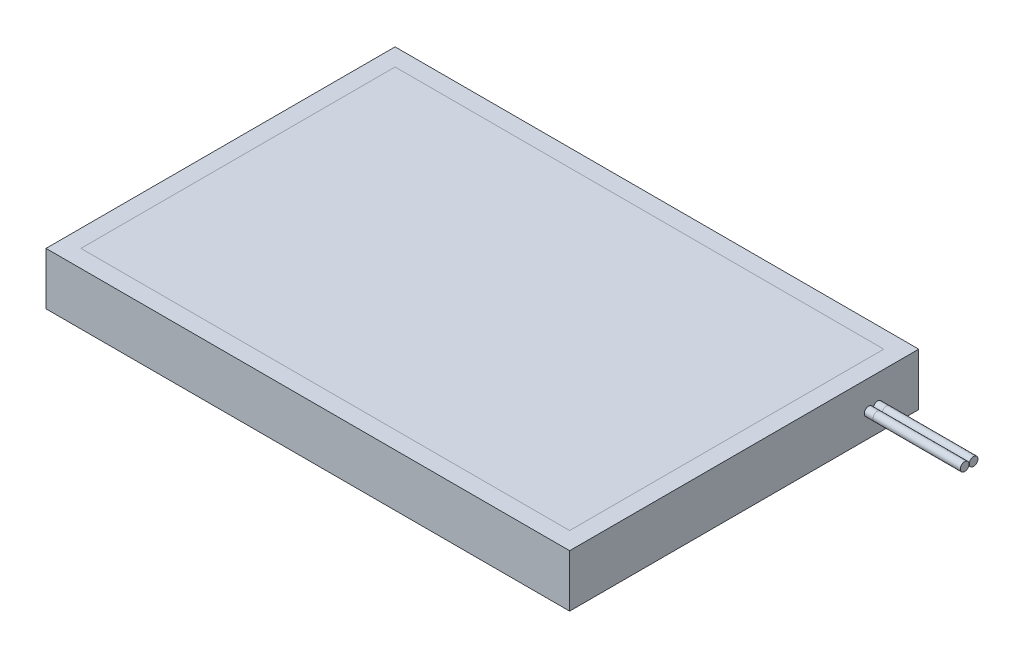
ISO-10303-21;
HEADER;
FILE_DESCRIPTION(('STEP AP214'),'2;1');
FILE_NAME('part.step','',(''),(''),'','','');
FILE_SCHEMA(('AUTOMOTIVE_DESIGN { 1 0 10303 214 1 1 1 1 }'));
ENDSEC;
DATA;
#1=APPLICATION_CONTEXT('core data for automotive mechanical design processes');
#2=APPLICATION_PROTOCOL_DEFINITION('international standard','automotive_design',2000,#1);
#3=PRODUCT_CONTEXT('',#1,'mechanical');
#4=PRODUCT('Part','Part','',(#3));
#5=PRODUCT_RELATED_PRODUCT_CATEGORY('part','',(#4));
#6=PRODUCT_DEFINITION_FORMATION('','',#4);
#7=PRODUCT_DEFINITION_CONTEXT('part definition',#1,'design');
#8=PRODUCT_DEFINITION('design','',#6,#7);
#9=PRODUCT_DEFINITION_SHAPE('','',#8);
#10=(LENGTH_UNIT() NAMED_UNIT(*) SI_UNIT(.MILLI.,.METRE.));
#11=(NAMED_UNIT(*) PLANE_ANGLE_UNIT() SI_UNIT($,.RADIAN.));
#12=(NAMED_UNIT(*) SI_UNIT($,.STERADIAN.) SOLID_ANGLE_UNIT());
#13=UNCERTAINTY_MEASURE_WITH_UNIT(LENGTH_MEASURE(1.E-05),#10,'distance_accuracy_value','');
#14=(GEOMETRIC_REPRESENTATION_CONTEXT(3) GLOBAL_UNCERTAINTY_ASSIGNED_CONTEXT((#13)) GLOBAL_UNIT_ASSIGNED_CONTEXT((#10,
#11,#12)) REPRESENTATION_CONTEXT('',''));
#15=CARTESIAN_POINT('',(0.,0.,0.));
#16=DIRECTION('',(0.,0.,1.));
#17=DIRECTION('',(1.,0.,0.));
#18=AXIS2_PLACEMENT_3D('',#15,#16,#17);
#19=CARTESIAN_POINT('',(47.043156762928,-0.11832284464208,-19.696316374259));
#20=DIRECTION('',(-1.,0.,0.));
#21=DIRECTION('',(0.,0.,1.));
#22=AXIS2_PLACEMENT_3D('',#19,#20,#21);
#23=CYLINDRICAL_SURFACE('',#22,0.5);
#24=CARTESIAN_POINT('',(47.043156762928,-0.11832284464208,-19.696316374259));
#25=DIRECTION('',(1.,0.,0.));
#26=DIRECTION('',(0.,0.,-1.));
#27=AXIS2_PLACEMENT_3D('',#24,#25,#26);
#28=CIRCLE('',#27,0.5);
#29=CARTESIAN_POINT('',(47.043156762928,-0.11832284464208,-20.196316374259));
#30=VERTEX_POINT('',#29);
#31=EDGE_CURVE('P0_E9',#30,#30,#28,.T.);
#32=ORIENTED_EDGE('',*,*,#31,.F.);
#33=EDGE_LOOP('',(#32));
#34=FACE_BOUND('',#33,.T.);
#35=CARTESIAN_POINT('',(37.043156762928,-0.11832284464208,-19.696316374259));
#36=DIRECTION('',(1.,0.,0.));
#37=DIRECTION('',(0.,0.,-1.));
#38=AXIS2_PLACEMENT_3D('',#35,#36,#37);
#39=CIRCLE('',#38,0.5);
#40=CARTESIAN_POINT('',(37.043156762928,-0.11832284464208,-20.196316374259));
#41=VERTEX_POINT('',#40);
#42=EDGE_CURVE('P0_E19',#41,#41,#39,.T.);
#43=ORIENTED_EDGE('',*,*,#42,.T.);
#44=EDGE_LOOP('',(#43));
#45=FACE_BOUND('',#44,.T.);
#46=ADVANCED_FACE('P0_F13',(#34,#45),#23,.T.);
#47=CARTESIAN_POINT('',(47.043156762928,-0.11832284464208,-19.696316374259));
#48=DIRECTION('',(1.,0.,0.));
#49=DIRECTION('',(0.,0.,-1.));
#50=AXIS2_PLACEMENT_3D('',#47,#48,#49);
#51=PLANE('',#50);
#52=ORIENTED_EDGE('',*,*,#31,.T.);
#53=EDGE_LOOP('',(#52));
#54=FACE_BOUND('',#53,.T.);
#55=ADVANCED_FACE('P0_F28',(#54),#51,.T.);
#56=CARTESIAN_POINT('',(37.043156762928,-0.11832284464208,-19.696316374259));
#57=DIRECTION('',(1.,0.,0.));
#58=DIRECTION('',(0.,0.,-1.));
#59=AXIS2_PLACEMENT_3D('',#56,#57,#58);
#60=PLANE('',#59);
#61=ORIENTED_EDGE('',*,*,#42,.F.);
#62=EDGE_LOOP('',(#61));
#63=FACE_BOUND('',#62,.T.);
#64=ADVANCED_FACE('P0_F26',(#63),#60,.F.);
#65=CLOSED_SHELL('',(#46,#55,#64));
#66=MANIFOLD_SOLID_BREP('P0_B1',#65);
#67=CARTESIAN_POINT('',(1.04315676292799,-3.33134698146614,-5.43472498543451));
#68=DIRECTION('',(0.,-1.,0.));
#69=DIRECTION('',(-0.546944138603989,0.,0.837169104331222));
#70=AXIS2_PLACEMENT_3D('',#67,#68,#69);
#71=PLANE('',#70);
#72=CARTESIAN_POINT('',(1.04315676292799,-3.33134698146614,-5.43472498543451));
#73=DIRECTION('',(0.,-1.,0.));
#74=DIRECTION('',(-0.546944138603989,0.,0.837169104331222));
#75=AXIS2_PLACEMENT_3D('',#72,#73,#74);
#76=CIRCLE('',#75,3.5);
#77=CARTESIAN_POINT('',(-0.871147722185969,-3.33134698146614,-2.50463312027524));
#78=VERTEX_POINT('',#77);
#79=EDGE_CURVE('P1_E25',#78,#78,#76,.T.);
#80=ORIENTED_EDGE('',*,*,#79,.T.);
#81=EDGE_LOOP('',(#80));
#82=FACE_BOUND('',#81,.T.);
#83=CARTESIAN_POINT('',(1.04315676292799,-3.33134698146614,-5.43472498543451));
#84=DIRECTION('',(0.,-1.,0.));
#85=DIRECTION('',(-0.546944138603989,0.,0.837169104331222));
#86=AXIS2_PLACEMENT_3D('',#83,#84,#85);
#87=CIRCLE('',#86,2.5);
#88=CARTESIAN_POINT('',(-0.324203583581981,-3.33134698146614,-3.34180222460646));
#89=VERTEX_POINT('',#88);
#90=EDGE_CURVE('P1_E34',#89,#89,#87,.T.);
#91=ORIENTED_EDGE('',*,*,#90,.F.);
#92=EDGE_LOOP('',(#91));
#93=FACE_BOUND('',#92,.T.);
#94=ADVANCED_FACE('P1_F14',(#82,#93),#71,.T.);
#95=CARTESIAN_POINT('',(1.04315676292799,-3.33134698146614,-5.43472498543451));
#96=DIRECTION('',(0.,1.,0.));
#97=DIRECTION('',(0.546944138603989,0.,-0.837169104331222));
#98=AXIS2_PLACEMENT_3D('',#95,#96,#97);
#99=CYLINDRICAL_SURFACE('',#98,3.5);
#100=ORIENTED_EDGE('',*,*,#79,.F.);
#101=EDGE_LOOP('',(#100));
#102=FACE_BOUND('',#101,.T.);
#103=CARTESIAN_POINT('',(1.04315676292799,-2.83134698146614,-5.43472498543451));
#104=DIRECTION('',(0.,-1.,0.));
#105=DIRECTION('',(-0.546944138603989,0.,0.837169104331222));
#106=AXIS2_PLACEMENT_3D('',#103,#104,#105);
#107=CIRCLE('',#106,3.5);
#108=CARTESIAN_POINT('',(-0.871147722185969,-2.83134698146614,-2.50463312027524));
#109=VERTEX_POINT('',#108);
#110=EDGE_CURVE('P1_E29',#109,#109,#107,.T.);
#111=ORIENTED_EDGE('',*,*,#110,.T.);
#112=EDGE_LOOP('',(#111));
#113=FACE_BOUND('',#112,.T.);
#114=ADVANCED_FACE('P1_F16',(#102,#113),#99,.T.);
#115=CARTESIAN_POINT('',(1.04315676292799,-2.83134698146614,-5.43472498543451));
#116=DIRECTION('',(0.,-1.,0.));
#117=DIRECTION('',(-0.546944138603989,0.,0.837169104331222));
#118=AXIS2_PLACEMENT_3D('',#115,#116,#117);
#119=PLANE('',#118);
#120=ORIENTED_EDGE('',*,*,#110,.F.);
#121=EDGE_LOOP('',(#120));
#122=FACE_BOUND('',#121,.T.);
#123=ADVANCED_FACE('P1_F58',(#122),#119,.F.);
#124=CARTESIAN_POINT('',(1.04315676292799,-9.33134698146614,-5.43472498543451));
#125=DIRECTION('',(0.,1.,0.));
#126=DIRECTION('',(0.546944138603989,0.,-0.837169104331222));
#127=AXIS2_PLACEMENT_3D('',#124,#125,#126);
#128=CYLINDRICAL_SURFACE('',#127,2.5);
#129=CARTESIAN_POINT('',(1.04315676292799,-8.93134698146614,-5.43472498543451));
#130=DIRECTION('',(0.,-1.,0.));
#131=DIRECTION('',(-0.546944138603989,0.,0.837169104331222));
#132=AXIS2_PLACEMENT_3D('',#129,#130,#131);
#133=CIRCLE('',#132,2.5);
#134=CARTESIAN_POINT('',(-0.324203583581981,-8.93134698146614,-3.34180222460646));
#135=VERTEX_POINT('',#134);
#136=EDGE_CURVE('P1_E10',#135,#135,#133,.F.);
#137=ORIENTED_EDGE('',*,*,#136,.T.);
#138=EDGE_LOOP('',(#137));
#139=FACE_BOUND('',#138,.T.);
#140=ORIENTED_EDGE('',*,*,#90,.T.);
#141=EDGE_LOOP('',(#140));
#142=FACE_BOUND('',#141,.T.);
#143=ADVANCED_FACE('P1_F48',(#139,#142),#128,.T.);
#144=CARTESIAN_POINT('',(1.04315676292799,-9.33134698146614,-5.43472498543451));
#145=DIRECTION('',(0.,-1.,0.));
#146=DIRECTION('',(-0.546944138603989,0.,0.837169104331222));
#147=AXIS2_PLACEMENT_3D('',#144,#145,#146);
#148=PLANE('',#147);
#149=CARTESIAN_POINT('',(1.04315676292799,-9.33134698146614,-5.43472498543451));
#150=DIRECTION('',(0.,-1.,0.));
#151=DIRECTION('',(-0.546944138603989,0.,0.837169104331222));
#152=AXIS2_PLACEMENT_3D('',#149,#150,#151);
#153=CIRCLE('',#152,2.1);
#154=CARTESIAN_POINT('',(-0.105425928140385,-9.33134698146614,-3.67666986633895));
#155=VERTEX_POINT('',#154);
#156=EDGE_CURVE('P1_E21',#155,#155,#153,.T.);
#157=ORIENTED_EDGE('',*,*,#156,.T.);
#158=EDGE_LOOP('',(#157));
#159=FACE_BOUND('',#158,.T.);
#160=CARTESIAN_POINT('',(1.04315676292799,-9.33134698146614,-5.43472498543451));
#161=DIRECTION('',(0.,-1.,0.));
#162=DIRECTION('',(-0.546944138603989,0.,0.837169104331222));
#163=AXIS2_PLACEMENT_3D('',#160,#161,#162);
#164=CIRCLE('',#163,1.5);
#165=CARTESIAN_POINT('',(0.222740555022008,-9.33134698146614,-4.17897132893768));
#166=VERTEX_POINT('',#165);
#167=EDGE_CURVE('P1_E40',#166,#166,#164,.T.);
#168=ORIENTED_EDGE('',*,*,#167,.F.);
#169=EDGE_LOOP('',(#168));
#170=FACE_BOUND('',#169,.T.);
#171=ADVANCED_FACE('P1_F46',(#159,#170),#148,.T.);
#172=CARTESIAN_POINT('',(1.04315676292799,-4.33134698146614,-5.43472498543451));
#173=DIRECTION('',(0.,-1.,0.));
#174=DIRECTION('',(-0.546944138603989,0.,0.837169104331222));
#175=AXIS2_PLACEMENT_3D('',#172,#173,#174);
#176=CYLINDRICAL_SURFACE('',#175,1.5);
#177=CARTESIAN_POINT('',(1.04315676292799,-4.33134698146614,-5.43472498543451));
#178=DIRECTION('',(0.,-1.,0.));
#179=DIRECTION('',(-0.546944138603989,0.,0.837169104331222));
#180=AXIS2_PLACEMENT_3D('',#177,#178,#179);
#181=CIRCLE('',#180,1.5);
#182=CARTESIAN_POINT('',(0.222740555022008,-4.33134698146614,-4.17897132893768));
#183=VERTEX_POINT('',#182);
#184=EDGE_CURVE('P1_E37',#183,#183,#181,.T.);
#185=ORIENTED_EDGE('',*,*,#184,.F.);
#186=EDGE_LOOP('',(#185));
#187=FACE_BOUND('',#186,.T.);
#188=ORIENTED_EDGE('',*,*,#167,.T.);
#189=EDGE_LOOP('',(#188));
#190=FACE_BOUND('',#189,.T.);
#191=ADVANCED_FACE('P1_F44',(#187,#190),#176,.F.);
#192=CARTESIAN_POINT('',(1.04315676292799,-4.33134698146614,-5.43472498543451));
#193=DIRECTION('',(0.,-1.,0.));
#194=DIRECTION('',(-0.546944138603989,0.,0.837169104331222));
#195=AXIS2_PLACEMENT_3D('',#192,#193,#194);
#196=PLANE('',#195);
#197=ORIENTED_EDGE('',*,*,#184,.T.);
#198=EDGE_LOOP('',(#197));
#199=FACE_BOUND('',#198,.T.);
#200=ADVANCED_FACE('P1_F55',(#199),#196,.T.);
#201=CARTESIAN_POINT('',(1.04315676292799,-9.33134698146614,-5.43472498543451));
#202=DIRECTION('',(0.,1.,0.));
#203=DIRECTION('',(0.546944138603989,0.,-0.837169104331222));
#204=AXIS2_PLACEMENT_3D('',#201,#202,#203);
#205=CONICAL_SURFACE('',#204,2.1,0.785398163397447);
#206=ORIENTED_EDGE('',*,*,#136,.F.);
#207=EDGE_LOOP('',(#206));
#208=FACE_BOUND('',#207,.T.);
#209=ORIENTED_EDGE('',*,*,#156,.F.);
#210=EDGE_LOOP('',(#209));
#211=FACE_BOUND('',#210,.T.);
#212=ADVANCED_FACE('P1_F98',(#208,#211),#205,.T.);
#213=CLOSED_SHELL('',(#94,#114,#123,#143,#171,#191,#200,#212));
#214=MANIFOLD_SOLID_BREP('P1_B1',#213);
#215=CARTESIAN_POINT('',(47.043156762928,-0.11832284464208,-20.7275580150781));
#216=DIRECTION('',(-1.,0.,0.));
#217=DIRECTION('',(0.,0.,1.));
#218=AXIS2_PLACEMENT_3D('',#215,#216,#217);
#219=CYLINDRICAL_SURFACE('',#218,0.5);
#220=CARTESIAN_POINT('',(47.043156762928,-0.11832284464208,-20.7275580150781));
#221=DIRECTION('',(1.,0.,0.));
#222=DIRECTION('',(0.,0.,-1.));
#223=AXIS2_PLACEMENT_3D('',#220,#221,#222);
#224=CIRCLE('',#223,0.5);
#225=CARTESIAN_POINT('',(47.043156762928,-0.11832284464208,-21.2275580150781));
#226=VERTEX_POINT('',#225);
#227=EDGE_CURVE('P2_E10',#226,#226,#224,.T.);
#228=ORIENTED_EDGE('',*,*,#227,.F.);
#229=EDGE_LOOP('',(#228));
#230=FACE_BOUND('',#229,.T.);
#231=CARTESIAN_POINT('',(37.043156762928,-0.11832284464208,-20.7275580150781));
#232=DIRECTION('',(1.,0.,0.));
#233=DIRECTION('',(0.,0.,-1.));
#234=AXIS2_PLACEMENT_3D('',#231,#232,#233);
#235=CIRCLE('',#234,0.5);
#236=CARTESIAN_POINT('',(37.043156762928,-0.11832284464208,-21.2275580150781));
#237=VERTEX_POINT('',#236);
#238=EDGE_CURVE('P2_E20',#237,#237,#235,.T.);
#239=ORIENTED_EDGE('',*,*,#238,.T.);
#240=EDGE_LOOP('',(#239));
#241=FACE_BOUND('',#240,.T.);
#242=ADVANCED_FACE('P2_F14',(#230,#241),#219,.T.);
#243=CARTESIAN_POINT('',(47.043156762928,-0.11832284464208,-20.7275580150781));
#244=DIRECTION('',(1.,0.,0.));
#245=DIRECTION('',(0.,0.,-1.));
#246=AXIS2_PLACEMENT_3D('',#243,#244,#245);
#247=PLANE('',#246);
#248=ORIENTED_EDGE('',*,*,#227,.T.);
#249=EDGE_LOOP('',(#248));
#250=FACE_BOUND('',#249,.T.);
#251=ADVANCED_FACE('P2_F29',(#250),#247,.T.);
#252=CARTESIAN_POINT('',(37.043156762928,-0.11832284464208,-20.7275580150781));
#253=DIRECTION('',(1.,0.,0.));
#254=DIRECTION('',(0.,0.,-1.));
#255=AXIS2_PLACEMENT_3D('',#252,#253,#254);
#256=PLANE('',#255);
#257=ORIENTED_EDGE('',*,*,#238,.F.);
#258=EDGE_LOOP('',(#257));
#259=FACE_BOUND('',#258,.T.);
#260=ADVANCED_FACE('P2_F27',(#259),#256,.F.);
#261=CLOSED_SHELL('',(#242,#251,#260));
#262=MANIFOLD_SOLID_BREP('P2_B1',#261);
#263=CARTESIAN_POINT('',(36.043156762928,3.16865301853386,14.5652750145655));
#264=DIRECTION('',(-1.,0.,0.));
#265=DIRECTION('',(0.,0.,1.));
#266=AXIS2_PLACEMENT_3D('',#263,#264,#265);
#267=PLANE('',#266);
#268=CARTESIAN_POINT('',(36.043156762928,-0.11832284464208,-20.7275580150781));
#269=DIRECTION('',(-1.,0.,0.));
#270=DIRECTION('',(0.,0.,1.));
#271=AXIS2_PLACEMENT_3D('',#268,#269,#270);
#272=CIRCLE('',#271,0.499999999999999);
#273=CARTESIAN_POINT('',(36.043156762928,-0.11832284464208,-20.2275580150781));
#274=VERTEX_POINT('',#273);
#275=EDGE_CURVE('P3_E24',#274,#274,#272,.F.);
#276=ORIENTED_EDGE('',*,*,#275,.F.);
#277=EDGE_LOOP('',(#276));
#278=FACE_BOUND('',#277,.T.);
#279=DIRECTION('',(0.,0.,-1.));
#280=VECTOR('',#279,1.);
#281=CARTESIAN_POINT('',(36.043156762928,-2.83134698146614,14.5652750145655));
#282=LINE('',#281,#280);
#283=CARTESIAN_POINT('',(36.043156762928,-2.83134698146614,14.5652750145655));
#284=VERTEX_POINT('',#283);
#285=CARTESIAN_POINT('',(36.043156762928,-2.83134698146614,-25.4347249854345));
#286=VERTEX_POINT('',#285);
#287=EDGE_CURVE('P3_E121',#284,#286,#282,.T.);
#288=ORIENTED_EDGE('',*,*,#287,.T.);
#289=DIRECTION('',(0.,-1.,0.));
#290=VECTOR('',#289,1.);
#291=CARTESIAN_POINT('',(36.043156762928,3.16865301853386,-25.4347249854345));
#292=LINE('',#291,#290);
#293=CARTESIAN_POINT('',(36.043156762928,3.16865301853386,-25.4347249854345));
#294=VERTEX_POINT('',#293);
#295=EDGE_CURVE('P3_E135',#294,#286,#292,.T.);
#296=ORIENTED_EDGE('',*,*,#295,.F.);
#297=DIRECTION('',(0.,0.,-1.));
#298=VECTOR('',#297,1.);
#299=CARTESIAN_POINT('',(36.043156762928,3.16865301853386,14.5652750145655));
#300=LINE('',#299,#298);
#301=CARTESIAN_POINT('',(36.043156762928,3.16865301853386,14.5652750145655));
#302=VERTEX_POINT('',#301);
#303=EDGE_CURVE('P3_E129',#302,#294,#300,.T.);
#304=ORIENTED_EDGE('',*,*,#303,.F.);
#305=DIRECTION('',(0.,-1.,0.));
#306=VECTOR('',#305,1.);
#307=CARTESIAN_POINT('',(36.043156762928,3.16865301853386,14.5652750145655));
#308=LINE('',#307,#306);
#309=EDGE_CURVE('P3_E138',#302,#284,#308,.T.);
#310=ORIENTED_EDGE('',*,*,#309,.T.);
#311=EDGE_LOOP('',(#288,#296,#304,#310));
#312=FACE_BOUND('',#311,.T.);
#313=CARTESIAN_POINT('',(36.043156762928,-0.11832284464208,-19.696316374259));
#314=DIRECTION('',(-1.,0.,0.));
#315=DIRECTION('',(0.,0.,1.));
#316=AXIS2_PLACEMENT_3D('',#313,#314,#315);
#317=CIRCLE('',#316,0.499999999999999);
#318=CARTESIAN_POINT('',(36.043156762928,-0.11832284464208,-19.196316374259));
#319=VERTEX_POINT('',#318);
#320=EDGE_CURVE('P3_E11',#319,#319,#317,.F.);
#321=ORIENTED_EDGE('',*,*,#320,.F.);
#322=EDGE_LOOP('',(#321));
#323=FACE_BOUND('',#322,.T.);
#324=ADVANCED_FACE('P3_F16',(#278,#312,#323),#267,.F.);
#325=CARTESIAN_POINT('',(-23.956843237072,3.16865301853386,-25.4347249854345));
#326=DIRECTION('',(0.,-1.,0.));
#327=DIRECTION('',(0.,0.,-1.));
#328=AXIS2_PLACEMENT_3D('',#325,#326,#327);
#329=PLANE('',#328);
#330=DIRECTION('',(0.,0.,1.));
#331=VECTOR('',#330,1.);
#332=CARTESIAN_POINT('',(-23.956843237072,3.16865301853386,14.5652750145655));
#333=LINE('',#332,#331);
#334=CARTESIAN_POINT('',(-23.956843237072,3.16865301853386,-25.4347249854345));
#335=VERTEX_POINT('',#334);
#336=CARTESIAN_POINT('',(-23.956843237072,3.16865301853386,14.5652750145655));
#337=VERTEX_POINT('',#336);
#338=EDGE_CURVE('P3_E125',#335,#337,#333,.T.);
#339=ORIENTED_EDGE('',*,*,#338,.T.);
#340=DIRECTION('',(1.,0.,0.));
#341=VECTOR('',#340,1.);
#342=CARTESIAN_POINT('',(-23.956843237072,3.16865301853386,14.5652750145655));
#343=LINE('',#342,#341);
#344=EDGE_CURVE('P3_E127',#337,#302,#343,.T.);
#345=ORIENTED_EDGE('',*,*,#344,.T.);
#346=ORIENTED_EDGE('',*,*,#303,.T.);
#347=DIRECTION('',(-1.,0.,0.));
#348=VECTOR('',#347,1.);
#349=CARTESIAN_POINT('',(-23.956843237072,3.16865301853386,-25.4347249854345));
#350=LINE('',#349,#348);
#351=EDGE_CURVE('P3_E39',#294,#335,#350,.T.);
#352=ORIENTED_EDGE('',*,*,#351,.T.);
#353=EDGE_LOOP('',(#339,#345,#346,#352));
#354=FACE_BOUND('',#353,.T.);
#355=DIRECTION('',(0.,0.,1.));
#356=VECTOR('',#355,1.);
#357=CARTESIAN_POINT('',(-21.956843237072,3.16865301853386,-25.4347249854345));
#358=LINE('',#357,#356);
#359=CARTESIAN_POINT('',(-21.956843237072,3.16865301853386,-23.4347249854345));
#360=VERTEX_POINT('',#359);
#361=CARTESIAN_POINT('',(-21.956843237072,3.16865301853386,12.5652750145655));
#362=VERTEX_POINT('',#361);
#363=EDGE_CURVE('P3_E105',#360,#362,#358,.T.);
#364=ORIENTED_EDGE('',*,*,#363,.F.);
#365=DIRECTION('',(-1.,0.,0.));
#366=VECTOR('',#365,1.);
#367=CARTESIAN_POINT('',(-23.956843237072,3.16865301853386,-23.4347249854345));
#368=LINE('',#367,#366);
#369=CARTESIAN_POINT('',(34.043156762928,3.16865301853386,-23.4347249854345));
#370=VERTEX_POINT('',#369);
#371=EDGE_CURVE('P3_E114',#370,#360,#368,.T.);
#372=ORIENTED_EDGE('',*,*,#371,.F.);
#373=DIRECTION('',(0.,0.,-1.));
#374=VECTOR('',#373,1.);
#375=CARTESIAN_POINT('',(34.043156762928,3.16865301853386,-25.4347249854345));
#376=LINE('',#375,#374);
#377=CARTESIAN_POINT('',(34.043156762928,3.16865301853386,12.5652750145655));
#378=VERTEX_POINT('',#377);
#379=EDGE_CURVE('P3_E112',#378,#370,#376,.T.);
#380=ORIENTED_EDGE('',*,*,#379,.F.);
#381=DIRECTION('',(1.,0.,0.));
#382=VECTOR('',#381,1.);
#383=CARTESIAN_POINT('',(-23.956843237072,3.16865301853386,12.5652750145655));
#384=LINE('',#383,#382);
#385=EDGE_CURVE('P3_E97',#362,#378,#384,.T.);
#386=ORIENTED_EDGE('',*,*,#385,.F.);
#387=EDGE_LOOP('',(#364,#372,#380,#386));
#388=FACE_BOUND('',#387,.T.);
#389=ADVANCED_FACE('P3_F150',(#354,#388),#329,.F.);
#390=CARTESIAN_POINT('',(-23.956843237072,3.16865301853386,14.5652750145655));
#391=DIRECTION('',(1.,0.,0.));
#392=DIRECTION('',(0.,0.,-1.));
#393=AXIS2_PLACEMENT_3D('',#390,#391,#392);
#394=PLANE('',#393);
#395=DIRECTION('',(0.,0.,1.));
#396=VECTOR('',#395,1.);
#397=CARTESIAN_POINT('',(-23.956843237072,-2.83134698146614,14.5652750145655));
#398=LINE('',#397,#396);
#399=CARTESIAN_POINT('',(-23.956843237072,-2.83134698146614,-25.4347249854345));
#400=VERTEX_POINT('',#399);
#401=CARTESIAN_POINT('',(-23.956843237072,-2.83134698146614,14.5652750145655));
#402=VERTEX_POINT('',#401);
#403=EDGE_CURVE('P3_E116',#400,#402,#398,.T.);
#404=ORIENTED_EDGE('',*,*,#403,.T.);
#405=DIRECTION('',(0.,-1.,0.));
#406=VECTOR('',#405,1.);
#407=CARTESIAN_POINT('',(-23.956843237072,3.16865301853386,14.5652750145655));
#408=LINE('',#407,#406);
#409=EDGE_CURVE('P3_E141',#337,#402,#408,.T.);
#410=ORIENTED_EDGE('',*,*,#409,.F.);
#411=ORIENTED_EDGE('',*,*,#338,.F.);
#412=DIRECTION('',(0.,-1.,0.));
#413=VECTOR('',#412,1.);
#414=CARTESIAN_POINT('',(-23.956843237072,3.16865301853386,-25.4347249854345));
#415=LINE('',#414,#413);
#416=EDGE_CURVE('P3_E132',#335,#400,#415,.T.);
#417=ORIENTED_EDGE('',*,*,#416,.T.);
#418=EDGE_LOOP('',(#404,#410,#411,#417));
#419=FACE_BOUND('',#418,.T.);
#420=ADVANCED_FACE('P3_F18',(#419),#394,.F.);
#421=CARTESIAN_POINT('',(-23.956843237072,3.16865301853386,14.5652750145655));
#422=DIRECTION('',(0.,0.,-1.));
#423=DIRECTION('',(-1.,0.,0.));
#424=AXIS2_PLACEMENT_3D('',#421,#422,#423);
#425=PLANE('',#424);
#426=DIRECTION('',(1.,0.,0.));
#427=VECTOR('',#426,1.);
#428=CARTESIAN_POINT('',(-23.956843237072,-2.83134698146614,14.5652750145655));
#429=LINE('',#428,#427);
#430=EDGE_CURVE('P3_E119',#402,#284,#429,.T.);
#431=ORIENTED_EDGE('',*,*,#430,.T.);
#432=ORIENTED_EDGE('',*,*,#309,.F.);
#433=ORIENTED_EDGE('',*,*,#344,.F.);
#434=ORIENTED_EDGE('',*,*,#409,.T.);
#435=EDGE_LOOP('',(#431,#432,#433,#434));
#436=FACE_BOUND('',#435,.T.);
#437=ADVANCED_FACE('P3_F200',(#436),#425,.F.);
#438=CARTESIAN_POINT('',(-23.956843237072,3.16865301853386,-25.4347249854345));
#439=DIRECTION('',(0.,0.,1.));
#440=DIRECTION('',(1.,0.,0.));
#441=AXIS2_PLACEMENT_3D('',#438,#439,#440);
#442=PLANE('',#441);
#443=DIRECTION('',(-1.,0.,0.));
#444=VECTOR('',#443,1.);
#445=CARTESIAN_POINT('',(-23.956843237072,-2.83134698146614,-25.4347249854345));
#446=LINE('',#445,#444);
#447=EDGE_CURVE('P3_E123',#286,#400,#446,.T.);
#448=ORIENTED_EDGE('',*,*,#447,.T.);
#449=ORIENTED_EDGE('',*,*,#416,.F.);
#450=ORIENTED_EDGE('',*,*,#351,.F.);
#451=ORIENTED_EDGE('',*,*,#295,.T.);
#452=EDGE_LOOP('',(#448,#449,#450,#451));
#453=FACE_BOUND('',#452,.T.);
#454=ADVANCED_FACE('P3_F195',(#453),#442,.F.);
#455=CARTESIAN_POINT('',(-23.956843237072,-2.83134698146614,-25.4347249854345));
#456=DIRECTION('',(0.,-1.,0.));
#457=DIRECTION('',(0.,0.,-1.));
#458=AXIS2_PLACEMENT_3D('',#455,#456,#457);
#459=PLANE('',#458);
#460=CARTESIAN_POINT('',(1.04315676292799,-2.83134698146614,-5.43472498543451));
#461=DIRECTION('',(0.,-1.,0.));
#462=DIRECTION('',(0.,0.,-1.));
#463=AXIS2_PLACEMENT_3D('',#460,#461,#462);
#464=CIRCLE('',#463,3.5);
#465=CARTESIAN_POINT('',(1.04315676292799,-2.83134698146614,-8.93472498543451));
#466=VERTEX_POINT('',#465);
#467=EDGE_CURVE('P3_E240',#466,#466,#464,.T.);
#468=ORIENTED_EDGE('',*,*,#467,.F.);
#469=EDGE_LOOP('',(#468));
#470=FACE_BOUND('',#469,.T.);
#471=CARTESIAN_POINT('',(11.043156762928,-2.83134698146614,-5.43472498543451));
#472=DIRECTION('',(0.,-1.,0.));
#473=DIRECTION('',(0.,0.,-1.));
#474=AXIS2_PLACEMENT_3D('',#471,#472,#473);
#475=CIRCLE('',#474,3.5);
#476=CARTESIAN_POINT('',(11.043156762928,-2.83134698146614,-8.93472498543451));
#477=VERTEX_POINT('',#476);
#478=EDGE_CURVE('P3_E234',#477,#477,#475,.T.);
#479=ORIENTED_EDGE('',*,*,#478,.F.);
#480=EDGE_LOOP('',(#479));
#481=FACE_BOUND('',#480,.T.);
#482=ORIENTED_EDGE('',*,*,#403,.F.);
#483=ORIENTED_EDGE('',*,*,#447,.F.);
#484=ORIENTED_EDGE('',*,*,#287,.F.);
#485=ORIENTED_EDGE('',*,*,#430,.F.);
#486=EDGE_LOOP('',(#482,#483,#484,#485));
#487=FACE_BOUND('',#486,.T.);
#488=ADVANCED_FACE('P3_F182',(#470,#481,#487),#459,.T.);
#489=CARTESIAN_POINT('',(-21.956843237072,3.16865301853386,14.5652750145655));
#490=DIRECTION('',(1.,0.,0.));
#491=DIRECTION('',(0.,0.,-1.));
#492=AXIS2_PLACEMENT_3D('',#489,#490,#491);
#493=PLANE('',#492);
#494=DIRECTION('',(0.,0.,1.));
#495=VECTOR('',#494,1.);
#496=CARTESIAN_POINT('',(-21.956843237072,-0.83134698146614,-25.4347249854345));
#497=LINE('',#496,#495);
#498=CARTESIAN_POINT('',(-21.956843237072,-0.83134698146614,-23.4347249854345));
#499=VERTEX_POINT('',#498);
#500=CARTESIAN_POINT('',(-21.956843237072,-0.83134698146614,12.5652750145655));
#501=VERTEX_POINT('',#500);
#502=EDGE_CURVE('P3_E88',#499,#501,#497,.T.);
#503=ORIENTED_EDGE('',*,*,#502,.F.);
#504=DIRECTION('',(0.,-1.,0.));
#505=VECTOR('',#504,1.);
#506=CARTESIAN_POINT('',(-21.956843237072,3.16865301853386,-23.4347249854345));
#507=LINE('',#506,#505);
#508=EDGE_CURVE('P3_E108',#360,#499,#507,.T.);
#509=ORIENTED_EDGE('',*,*,#508,.F.);
#510=ORIENTED_EDGE('',*,*,#363,.T.);
#511=DIRECTION('',(0.,-1.,0.));
#512=VECTOR('',#511,1.);
#513=CARTESIAN_POINT('',(-21.956843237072,3.16865301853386,12.5652750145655));
#514=LINE('',#513,#512);
#515=EDGE_CURVE('P3_E100',#362,#501,#514,.T.);
#516=ORIENTED_EDGE('',*,*,#515,.T.);
#517=EDGE_LOOP('',(#503,#509,#510,#516));
#518=FACE_BOUND('',#517,.T.);
#519=ADVANCED_FACE('P3_F179',(#518),#493,.T.);
#520=CARTESIAN_POINT('',(-23.956843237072,3.16865301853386,12.5652750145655));
#521=DIRECTION('',(0.,0.,-1.));
#522=DIRECTION('',(-1.,0.,0.));
#523=AXIS2_PLACEMENT_3D('',#520,#521,#522);
#524=PLANE('',#523);
#525=DIRECTION('',(1.,0.,0.));
#526=VECTOR('',#525,1.);
#527=CARTESIAN_POINT('',(-23.956843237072,-0.83134698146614,12.5652750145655));
#528=LINE('',#527,#526);
#529=CARTESIAN_POINT('',(34.043156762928,-0.83134698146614,12.5652750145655));
#530=VERTEX_POINT('',#529);
#531=EDGE_CURVE('P3_E82',#501,#530,#528,.T.);
#532=ORIENTED_EDGE('',*,*,#531,.F.);
#533=ORIENTED_EDGE('',*,*,#515,.F.);
#534=ORIENTED_EDGE('',*,*,#385,.T.);
#535=DIRECTION('',(0.,-1.,0.));
#536=VECTOR('',#535,1.);
#537=CARTESIAN_POINT('',(34.043156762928,3.16865301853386,12.5652750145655));
#538=LINE('',#537,#536);
#539=EDGE_CURVE('P3_E94',#378,#530,#538,.T.);
#540=ORIENTED_EDGE('',*,*,#539,.T.);
#541=EDGE_LOOP('',(#532,#533,#534,#540));
#542=FACE_BOUND('',#541,.T.);
#543=ADVANCED_FACE('P3_F95',(#542),#524,.T.);
#544=CARTESIAN_POINT('',(34.043156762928,3.16865301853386,14.5652750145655));
#545=DIRECTION('',(-1.,0.,0.));
#546=DIRECTION('',(0.,0.,1.));
#547=AXIS2_PLACEMENT_3D('',#544,#545,#546);
#548=PLANE('',#547);
#549=DIRECTION('',(0.,0.,-1.));
#550=VECTOR('',#549,1.);
#551=CARTESIAN_POINT('',(34.043156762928,-0.83134698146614,-25.4347249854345));
#552=LINE('',#551,#550);
#553=CARTESIAN_POINT('',(34.043156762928,-0.83134698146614,-23.4347249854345));
#554=VERTEX_POINT('',#553);
#555=EDGE_CURVE('P3_E86',#530,#554,#552,.T.);
#556=ORIENTED_EDGE('',*,*,#555,.F.);
#557=ORIENTED_EDGE('',*,*,#539,.F.);
#558=ORIENTED_EDGE('',*,*,#379,.T.);
#559=DIRECTION('',(0.,-1.,0.));
#560=VECTOR('',#559,1.);
#561=CARTESIAN_POINT('',(34.043156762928,3.16865301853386,-23.4347249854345));
#562=LINE('',#561,#560);
#563=EDGE_CURVE('P3_E31',#370,#554,#562,.T.);
#564=ORIENTED_EDGE('',*,*,#563,.T.);
#565=EDGE_LOOP('',(#556,#557,#558,#564));
#566=FACE_BOUND('',#565,.T.);
#567=ADVANCED_FACE('P3_F102',(#566),#548,.T.);
#568=CARTESIAN_POINT('',(-23.956843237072,3.16865301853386,-23.4347249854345));
#569=DIRECTION('',(0.,0.,1.));
#570=DIRECTION('',(1.,0.,0.));
#571=AXIS2_PLACEMENT_3D('',#568,#569,#570);
#572=PLANE('',#571);
#573=DIRECTION('',(-1.,0.,0.));
#574=VECTOR('',#573,1.);
#575=CARTESIAN_POINT('',(-23.956843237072,-0.83134698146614,-23.4347249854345));
#576=LINE('',#575,#574);
#577=EDGE_CURVE('P3_E103',#554,#499,#576,.T.);
#578=ORIENTED_EDGE('',*,*,#577,.F.);
#579=ORIENTED_EDGE('',*,*,#563,.F.);
#580=ORIENTED_EDGE('',*,*,#371,.T.);
#581=ORIENTED_EDGE('',*,*,#508,.T.);
#582=EDGE_LOOP('',(#578,#579,#580,#581));
#583=FACE_BOUND('',#582,.T.);
#584=ADVANCED_FACE('P3_F188',(#583),#572,.T.);
#585=CARTESIAN_POINT('',(-23.956843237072,-0.83134698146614,-25.4347249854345));
#586=DIRECTION('',(0.,-1.,0.));
#587=DIRECTION('',(0.,0.,-1.));
#588=AXIS2_PLACEMENT_3D('',#585,#586,#587);
#589=PLANE('',#588);
#590=ORIENTED_EDGE('',*,*,#502,.T.);
#591=ORIENTED_EDGE('',*,*,#531,.T.);
#592=ORIENTED_EDGE('',*,*,#555,.T.);
#593=ORIENTED_EDGE('',*,*,#577,.T.);
#594=EDGE_LOOP('',(#590,#591,#592,#593));
#595=FACE_BOUND('',#594,.T.);
#596=ADVANCED_FACE('P3_F84',(#595),#589,.F.);
#597=CARTESIAN_POINT('',(37.043156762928,-0.11832284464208,-20.7275580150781));
#598=DIRECTION('',(-1.,0.,0.));
#599=DIRECTION('',(0.,0.,1.));
#600=AXIS2_PLACEMENT_3D('',#597,#598,#599);
#601=CYLINDRICAL_SURFACE('',#600,0.499999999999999);
#602=CARTESIAN_POINT('',(37.043156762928,-0.11832284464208,-20.7275580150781));
#603=DIRECTION('',(1.,0.,0.));
#604=DIRECTION('',(0.,0.,-1.));
#605=AXIS2_PLACEMENT_3D('',#602,#603,#604);
#606=CIRCLE('',#605,0.499999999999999);
#607=CARTESIAN_POINT('',(37.043156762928,-0.11832284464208,-21.2275580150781));
#608=VERTEX_POINT('',#607);
#609=EDGE_CURVE('P3_E224',#608,#608,#606,.T.);
#610=ORIENTED_EDGE('',*,*,#609,.F.);
#611=EDGE_LOOP('',(#610));
#612=FACE_BOUND('',#611,.T.);
#613=ORIENTED_EDGE('',*,*,#275,.T.);
#614=EDGE_LOOP('',(#613));
#615=FACE_BOUND('',#614,.T.);
#616=ADVANCED_FACE('P3_F146',(#612,#615),#601,.T.);
#617=CARTESIAN_POINT('',(37.043156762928,-0.11832284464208,-20.7275580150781));
#618=DIRECTION('',(1.,0.,0.));
#619=DIRECTION('',(0.,0.,-1.));
#620=AXIS2_PLACEMENT_3D('',#617,#618,#619);
#621=PLANE('',#620);
#622=ORIENTED_EDGE('',*,*,#609,.T.);
#623=EDGE_LOOP('',(#622));
#624=FACE_BOUND('',#623,.T.);
#625=ADVANCED_FACE('P3_F160',(#624),#621,.T.);
#626=CARTESIAN_POINT('',(37.043156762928,-0.11832284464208,-19.696316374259));
#627=DIRECTION('',(-1.,0.,0.));
#628=DIRECTION('',(0.,0.,1.));
#629=AXIS2_PLACEMENT_3D('',#626,#627,#628);
#630=CYLINDRICAL_SURFACE('',#629,0.499999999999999);
#631=CARTESIAN_POINT('',(37.043156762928,-0.11832284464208,-19.696316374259));
#632=DIRECTION('',(1.,0.,0.));
#633=DIRECTION('',(0.,0.,-1.));
#634=AXIS2_PLACEMENT_3D('',#631,#632,#633);
#635=CIRCLE('',#634,0.499999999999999);
#636=CARTESIAN_POINT('',(37.043156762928,-0.11832284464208,-20.196316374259));
#637=VERTEX_POINT('',#636);
#638=EDGE_CURVE('P3_E226',#637,#637,#635,.T.);
#639=ORIENTED_EDGE('',*,*,#638,.F.);
#640=EDGE_LOOP('',(#639));
#641=FACE_BOUND('',#640,.T.);
#642=ORIENTED_EDGE('',*,*,#320,.T.);
#643=EDGE_LOOP('',(#642));
#644=FACE_BOUND('',#643,.T.);
#645=ADVANCED_FACE('P3_F157',(#641,#644),#630,.T.);
#646=CARTESIAN_POINT('',(37.043156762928,-0.11832284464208,-19.696316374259));
#647=DIRECTION('',(1.,0.,0.));
#648=DIRECTION('',(0.,0.,-1.));
#649=AXIS2_PLACEMENT_3D('',#646,#647,#648);
#650=PLANE('',#649);
#651=ORIENTED_EDGE('',*,*,#638,.T.);
#652=EDGE_LOOP('',(#651));
#653=FACE_BOUND('',#652,.T.);
#654=ADVANCED_FACE('P3_F159',(#653),#650,.T.);
#655=CARTESIAN_POINT('',(11.043156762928,-2.58134698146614,-5.43472498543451));
#656=DIRECTION('',(0.,-1.,0.));
#657=DIRECTION('',(0.,0.,-1.));
#658=AXIS2_PLACEMENT_3D('',#655,#656,#657);
#659=CYLINDRICAL_SURFACE('',#658,3.5);
#660=CARTESIAN_POINT('',(11.043156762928,-2.58134698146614,-5.43472498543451));
#661=DIRECTION('',(0.,-1.,0.));
#662=DIRECTION('',(0.,0.,-1.));
#663=AXIS2_PLACEMENT_3D('',#660,#661,#662);
#664=CIRCLE('',#663,3.5);
#665=CARTESIAN_POINT('',(11.043156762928,-2.58134698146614,-8.93472498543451));
#666=VERTEX_POINT('',#665);
#667=EDGE_CURVE('P3_E229',#666,#666,#664,.T.);
#668=ORIENTED_EDGE('',*,*,#667,.F.);
#669=EDGE_LOOP('',(#668));
#670=FACE_BOUND('',#669,.T.);
#671=ORIENTED_EDGE('',*,*,#478,.T.);
#672=EDGE_LOOP('',(#671));
#673=FACE_BOUND('',#672,.T.);
#674=ADVANCED_FACE('P3_F168',(#670,#673),#659,.F.);
#675=CARTESIAN_POINT('',(11.043156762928,-2.58134698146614,-5.43472498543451));
#676=DIRECTION('',(0.,-1.,0.));
#677=DIRECTION('',(0.,0.,-1.));
#678=AXIS2_PLACEMENT_3D('',#675,#676,#677);
#679=PLANE('',#678);
#680=ORIENTED_EDGE('',*,*,#667,.T.);
#681=EDGE_LOOP('',(#680));
#682=FACE_BOUND('',#681,.T.);
#683=ADVANCED_FACE('P3_F249',(#682),#679,.T.);
#684=CARTESIAN_POINT('',(1.04315676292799,-2.58134698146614,-5.43472498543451));
#685=DIRECTION('',(0.,-1.,0.));
#686=DIRECTION('',(0.,0.,-1.));
#687=AXIS2_PLACEMENT_3D('',#684,#685,#686);
#688=CYLINDRICAL_SURFACE('',#687,3.5);
#689=CARTESIAN_POINT('',(1.04315676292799,-2.58134698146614,-5.43472498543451));
#690=DIRECTION('',(0.,-1.,0.));
#691=DIRECTION('',(0.,0.,-1.));
#692=AXIS2_PLACEMENT_3D('',#689,#690,#691);
#693=CIRCLE('',#692,3.5);
#694=CARTESIAN_POINT('',(1.04315676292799,-2.58134698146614,-8.93472498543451));
#695=VERTEX_POINT('',#694);
#696=EDGE_CURVE('P3_E237',#695,#695,#693,.T.);
#697=ORIENTED_EDGE('',*,*,#696,.F.);
#698=EDGE_LOOP('',(#697));
#699=FACE_BOUND('',#698,.T.);
#700=ORIENTED_EDGE('',*,*,#467,.T.);
#701=EDGE_LOOP('',(#700));
#702=FACE_BOUND('',#701,.T.);
#703=ADVANCED_FACE('P3_F244',(#699,#702),#688,.F.);
#704=CARTESIAN_POINT('',(1.04315676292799,-2.58134698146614,-5.43472498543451));
#705=DIRECTION('',(0.,-1.,0.));
#706=DIRECTION('',(0.,0.,-1.));
#707=AXIS2_PLACEMENT_3D('',#704,#705,#706);
#708=PLANE('',#707);
#709=ORIENTED_EDGE('',*,*,#696,.T.);
#710=EDGE_LOOP('',(#709));
#711=FACE_BOUND('',#710,.T.);
#712=ADVANCED_FACE('P3_F260',(#711),#708,.T.);
#713=CLOSED_SHELL('',(#324,#389,#420,#437,#454,#488,#519,#543,#567,#584,#596,#616,#625,#645,
#654,#674,#683,#703,#712));
#714=MANIFOLD_SOLID_BREP('P3_B1',#713);
#715=CARTESIAN_POINT('',(11.043156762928,-3.33134698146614,-5.43472498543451));
#716=DIRECTION('',(0.,-1.,0.));
#717=DIRECTION('',(-0.557009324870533,0.,0.830506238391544));
#718=AXIS2_PLACEMENT_3D('',#715,#716,#717);
#719=PLANE('',#718);
#720=CARTESIAN_POINT('',(11.043156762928,-3.33134698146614,-5.43472498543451));
#721=DIRECTION('',(0.,-1.,0.));
#722=DIRECTION('',(-0.557009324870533,0.,0.830506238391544));
#723=AXIS2_PLACEMENT_3D('',#720,#721,#722);
#724=CIRCLE('',#723,3.5);
#725=CARTESIAN_POINT('',(9.09362412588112,-3.33134698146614,-2.52795315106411));
#726=VERTEX_POINT('',#725);
#727=EDGE_CURVE('P4_E25',#726,#726,#724,.T.);
#728=ORIENTED_EDGE('',*,*,#727,.T.);
#729=EDGE_LOOP('',(#728));
#730=FACE_BOUND('',#729,.T.);
#731=CARTESIAN_POINT('',(11.043156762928,-3.33134698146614,-5.43472498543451));
#732=DIRECTION('',(0.,-1.,0.));
#733=DIRECTION('',(-0.557009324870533,0.,0.830506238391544));
#734=AXIS2_PLACEMENT_3D('',#731,#732,#733);
#735=CIRCLE('',#734,2.5);
#736=CARTESIAN_POINT('',(9.65063345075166,-3.33134698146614,-3.35845938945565));
#737=VERTEX_POINT('',#736);
#738=EDGE_CURVE('P4_E34',#737,#737,#735,.T.);
#739=ORIENTED_EDGE('',*,*,#738,.F.);
#740=EDGE_LOOP('',(#739));
#741=FACE_BOUND('',#740,.T.);
#742=ADVANCED_FACE('P4_F14',(#730,#741),#719,.T.);
#743=CARTESIAN_POINT('',(11.043156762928,-3.33134698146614,-5.43472498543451));
#744=DIRECTION('',(0.,1.,0.));
#745=DIRECTION('',(0.557009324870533,0.,-0.830506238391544));
#746=AXIS2_PLACEMENT_3D('',#743,#744,#745);
#747=CYLINDRICAL_SURFACE('',#746,3.5);
#748=ORIENTED_EDGE('',*,*,#727,.F.);
#749=EDGE_LOOP('',(#748));
#750=FACE_BOUND('',#749,.T.);
#751=CARTESIAN_POINT('',(11.043156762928,-2.83134698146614,-5.43472498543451));
#752=DIRECTION('',(0.,-1.,0.));
#753=DIRECTION('',(-0.557009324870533,0.,0.830506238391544));
#754=AXIS2_PLACEMENT_3D('',#751,#752,#753);
#755=CIRCLE('',#754,3.5);
#756=CARTESIAN_POINT('',(9.09362412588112,-2.83134698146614,-2.52795315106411));
#757=VERTEX_POINT('',#756);
#758=EDGE_CURVE('P4_E29',#757,#757,#755,.T.);
#759=ORIENTED_EDGE('',*,*,#758,.T.);
#760=EDGE_LOOP('',(#759));
#761=FACE_BOUND('',#760,.T.);
#762=ADVANCED_FACE('P4_F16',(#750,#761),#747,.T.);
#763=CARTESIAN_POINT('',(11.043156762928,-2.83134698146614,-5.43472498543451));
#764=DIRECTION('',(0.,-1.,0.));
#765=DIRECTION('',(-0.557009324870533,0.,0.830506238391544));
#766=AXIS2_PLACEMENT_3D('',#763,#764,#765);
#767=PLANE('',#766);
#768=ORIENTED_EDGE('',*,*,#758,.F.);
#769=EDGE_LOOP('',(#768));
#770=FACE_BOUND('',#769,.T.);
#771=ADVANCED_FACE('P4_F58',(#770),#767,.F.);
#772=CARTESIAN_POINT('',(11.043156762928,-9.33134698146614,-5.43472498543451));
#773=DIRECTION('',(0.,1.,0.));
#774=DIRECTION('',(0.557009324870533,0.,-0.830506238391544));
#775=AXIS2_PLACEMENT_3D('',#772,#773,#774);
#776=CYLINDRICAL_SURFACE('',#775,2.5);
#777=CARTESIAN_POINT('',(11.043156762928,-8.93134698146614,-5.43472498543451));
#778=DIRECTION('',(0.,-1.,0.));
#779=DIRECTION('',(-0.557009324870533,0.,0.830506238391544));
#780=AXIS2_PLACEMENT_3D('',#777,#778,#779);
#781=CIRCLE('',#780,2.5);
#782=CARTESIAN_POINT('',(9.65063345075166,-8.93134698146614,-3.35845938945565));
#783=VERTEX_POINT('',#782);
#784=EDGE_CURVE('P4_E10',#783,#783,#781,.F.);
#785=ORIENTED_EDGE('',*,*,#784,.T.);
#786=EDGE_LOOP('',(#785));
#787=FACE_BOUND('',#786,.T.);
#788=ORIENTED_EDGE('',*,*,#738,.T.);
#789=EDGE_LOOP('',(#788));
#790=FACE_BOUND('',#789,.T.);
#791=ADVANCED_FACE('P4_F48',(#787,#790),#776,.T.);
#792=CARTESIAN_POINT('',(11.043156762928,-9.33134698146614,-5.43472498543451));
#793=DIRECTION('',(0.,-1.,0.));
#794=DIRECTION('',(-0.557009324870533,0.,0.830506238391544));
#795=AXIS2_PLACEMENT_3D('',#792,#793,#794);
#796=PLANE('',#795);
#797=CARTESIAN_POINT('',(11.043156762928,-9.33134698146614,-5.43472498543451));
#798=DIRECTION('',(0.,-1.,0.));
#799=DIRECTION('',(-0.557009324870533,0.,0.830506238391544));
#800=AXIS2_PLACEMENT_3D('',#797,#798,#799);
#801=CIRCLE('',#800,2.1);
#802=CARTESIAN_POINT('',(9.87343718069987,-9.33134698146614,-3.69066188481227));
#803=VERTEX_POINT('',#802);
#804=EDGE_CURVE('P4_E21',#803,#803,#801,.T.);
#805=ORIENTED_EDGE('',*,*,#804,.T.);
#806=EDGE_LOOP('',(#805));
#807=FACE_BOUND('',#806,.T.);
#808=CARTESIAN_POINT('',(11.043156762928,-9.33134698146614,-5.43472498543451));
#809=DIRECTION('',(0.,-1.,0.));
#810=DIRECTION('',(-0.557009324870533,0.,0.830506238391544));
#811=AXIS2_PLACEMENT_3D('',#808,#809,#810);
#812=CIRCLE('',#811,1.5);
#813=CARTESIAN_POINT('',(10.2076427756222,-9.33134698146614,-4.1889656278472));
#814=VERTEX_POINT('',#813);
#815=EDGE_CURVE('P4_E40',#814,#814,#812,.T.);
#816=ORIENTED_EDGE('',*,*,#815,.F.);
#817=EDGE_LOOP('',(#816));
#818=FACE_BOUND('',#817,.T.);
#819=ADVANCED_FACE('P4_F46',(#807,#818),#796,.T.);
#820=CARTESIAN_POINT('',(11.043156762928,-4.33134698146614,-5.43472498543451));
#821=DIRECTION('',(0.,-1.,0.));
#822=DIRECTION('',(-0.557009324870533,0.,0.830506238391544));
#823=AXIS2_PLACEMENT_3D('',#820,#821,#822);
#824=CYLINDRICAL_SURFACE('',#823,1.5);
#825=CARTESIAN_POINT('',(11.043156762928,-4.33134698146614,-5.43472498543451));
#826=DIRECTION('',(0.,-1.,0.));
#827=DIRECTION('',(-0.557009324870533,0.,0.830506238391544));
#828=AXIS2_PLACEMENT_3D('',#825,#826,#827);
#829=CIRCLE('',#828,1.5);
#830=CARTESIAN_POINT('',(10.2076427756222,-4.33134698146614,-4.1889656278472));
#831=VERTEX_POINT('',#830);
#832=EDGE_CURVE('P4_E37',#831,#831,#829,.T.);
#833=ORIENTED_EDGE('',*,*,#832,.F.);
#834=EDGE_LOOP('',(#833));
#835=FACE_BOUND('',#834,.T.);
#836=ORIENTED_EDGE('',*,*,#815,.T.);
#837=EDGE_LOOP('',(#836));
#838=FACE_BOUND('',#837,.T.);
#839=ADVANCED_FACE('P4_F44',(#835,#838),#824,.F.);
#840=CARTESIAN_POINT('',(11.043156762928,-4.33134698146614,-5.43472498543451));
#841=DIRECTION('',(0.,-1.,0.));
#842=DIRECTION('',(-0.557009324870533,0.,0.830506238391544));
#843=AXIS2_PLACEMENT_3D('',#840,#841,#842);
#844=PLANE('',#843);
#845=ORIENTED_EDGE('',*,*,#832,.T.);
#846=EDGE_LOOP('',(#845));
#847=FACE_BOUND('',#846,.T.);
#848=ADVANCED_FACE('P4_F55',(#847),#844,.T.);
#849=CARTESIAN_POINT('',(11.043156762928,-9.33134698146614,-5.43472498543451));
#850=DIRECTION('',(0.,1.,0.));
#851=DIRECTION('',(0.557009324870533,0.,-0.830506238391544));
#852=AXIS2_PLACEMENT_3D('',#849,#850,#851);
#853=CONICAL_SURFACE('',#852,2.1,0.785398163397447);
#854=ORIENTED_EDGE('',*,*,#784,.F.);
#855=EDGE_LOOP('',(#854));
#856=FACE_BOUND('',#855,.T.);
#857=ORIENTED_EDGE('',*,*,#804,.F.);
#858=EDGE_LOOP('',(#857));
#859=FACE_BOUND('',#858,.T.);
#860=ADVANCED_FACE('P4_F98',(#856,#859),#853,.T.);
#861=CLOSED_SHELL('',(#742,#762,#771,#791,#819,#839,#848,#860));
#862=MANIFOLD_SOLID_BREP('P4_B1',#861);
#863=CARTESIAN_POINT('',(-21.956843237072,0.66865301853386,-21.4347249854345));
#864=DIRECTION('',(1.,0.,0.));
#865=DIRECTION('',(0.,0.,-1.));
#866=AXIS2_PLACEMENT_3D('',#863,#864,#865);
#867=PLANE('',#866);
#868=DIRECTION('',(0.,0.,1.));
#869=VECTOR('',#868,1.);
#870=CARTESIAN_POINT('',(-21.956843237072,-0.83134698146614,-21.4347249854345));
#871=LINE('',#870,#869);
#872=CARTESIAN_POINT('',(-21.956843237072,-0.83134698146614,-23.4347249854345));
#873=VERTEX_POINT('',#872);
#874=CARTESIAN_POINT('',(-21.956843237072,-0.83134698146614,12.5652750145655));
#875=VERTEX_POINT('',#874);
#876=EDGE_CURVE('P5_E732',#873,#875,#871,.T.);
#877=ORIENTED_EDGE('',*,*,#876,.T.);
#878=DIRECTION('',(0.,-1.,0.));
#879=VECTOR('',#878,1.);
#880=CARTESIAN_POINT('',(-21.956843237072,0.66865301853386,12.5652750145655));
#881=LINE('',#880,#879);
#882=CARTESIAN_POINT('',(-21.956843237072,0.66865301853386,12.5652750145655));
#883=VERTEX_POINT('',#882);
#884=EDGE_CURVE('P5_E1165',#883,#875,#881,.T.);
#885=ORIENTED_EDGE('',*,*,#884,.F.);
#886=DIRECTION('',(0.,0.,1.));
#887=VECTOR('',#886,1.);
#888=CARTESIAN_POINT('',(-21.956843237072,0.66865301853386,-21.4347249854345));
#889=LINE('',#888,#887);
#890=CARTESIAN_POINT('',(-21.956843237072,0.66865301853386,-23.4347249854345));
#891=VERTEX_POINT('',#890);
#892=EDGE_CURVE('P5_E24',#891,#883,#889,.T.);
#893=ORIENTED_EDGE('',*,*,#892,.F.);
#894=DIRECTION('',(0.,-1.,0.));
#895=VECTOR('',#894,1.);
#896=CARTESIAN_POINT('',(-21.956843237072,0.66865301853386,-23.4347249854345));
#897=LINE('',#896,#895);
#898=EDGE_CURVE('P5_E11',#891,#873,#897,.T.);
#899=ORIENTED_EDGE('',*,*,#898,.T.);
#900=EDGE_LOOP('',(#877,#885,#893,#899));
#901=FACE_BOUND('',#900,.T.);
#902=ADVANCED_FACE('P5_F16',(#901),#867,.F.);
#903=CARTESIAN_POINT('',(-21.956843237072,0.66865301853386,-23.4347249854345));
#904=DIRECTION('',(0.,0.,1.));
#905=DIRECTION('',(1.,0.,0.));
#906=AXIS2_PLACEMENT_3D('',#903,#904,#905);
#907=PLANE('',#906);
#908=ORIENTED_EDGE('',*,*,#898,.F.);
#909=DIRECTION('',(0.936329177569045,-0.351123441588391,0.));
#910=VECTOR('',#909,1.);
#911=CARTESIAN_POINT('',(-19.956843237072,-0.0813469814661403,-23.4347249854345));
#912=LINE('',#911,#910);
#913=CARTESIAN_POINT('',(-19.956843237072,-0.0813469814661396,-23.4347249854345));
#914=VERTEX_POINT('',#913);
#915=EDGE_CURVE('P5_E32',#891,#914,#912,.T.);
#916=ORIENTED_EDGE('',*,*,#915,.T.);
#917=DIRECTION('',(0.,-1.,0.));
#918=VECTOR('',#917,1.);
#919=CARTESIAN_POINT('',(-19.956843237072,0.66865301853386,-23.4347249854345));
#920=LINE('',#919,#918);
#921=CARTESIAN_POINT('',(-19.956843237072,0.66865301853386,-23.4347249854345));
#922=VERTEX_POINT('',#921);
#923=EDGE_CURVE('P5_E725',#922,#914,#920,.T.);
#924=ORIENTED_EDGE('',*,*,#923,.F.);
#925=DIRECTION('',(0.936329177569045,-0.351123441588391,0.));
#926=VECTOR('',#925,1.);
#927=CARTESIAN_POINT('',(-17.956843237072,-0.0813469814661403,-23.4347249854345));
#928=LINE('',#927,#926);
#929=CARTESIAN_POINT('',(-17.956843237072,-0.0813469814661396,-23.4347249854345));
#930=VERTEX_POINT('',#929);
#931=EDGE_CURVE('P5_E716',#922,#930,#928,.T.);
#932=ORIENTED_EDGE('',*,*,#931,.T.);
#933=DIRECTION('',(0.,-1.,0.));
#934=VECTOR('',#933,1.);
#935=CARTESIAN_POINT('',(-17.956843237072,0.66865301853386,-23.4347249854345));
#936=LINE('',#935,#934);
#937=CARTESIAN_POINT('',(-17.956843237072,0.66865301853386,-23.4347249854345));
#938=VERTEX_POINT('',#937);
#939=EDGE_CURVE('P5_E714',#938,#930,#936,.T.);
#940=ORIENTED_EDGE('',*,*,#939,.F.);
#941=DIRECTION('',(0.936329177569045,-0.351123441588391,0.));
#942=VECTOR('',#941,1.);
#943=CARTESIAN_POINT('',(-15.956843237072,-0.0813469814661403,-23.4347249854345));
#944=LINE('',#943,#942);
#945=CARTESIAN_POINT('',(-15.956843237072,-0.0813469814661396,-23.4347249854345));
#946=VERTEX_POINT('',#945);
#947=EDGE_CURVE('P5_E705',#938,#946,#944,.T.);
#948=ORIENTED_EDGE('',*,*,#947,.T.);
#949=DIRECTION('',(0.,-1.,0.));
#950=VECTOR('',#949,1.);
#951=CARTESIAN_POINT('',(-15.956843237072,0.66865301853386,-23.4347249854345));
#952=LINE('',#951,#950);
#953=CARTESIAN_POINT('',(-15.956843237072,0.66865301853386,-23.4347249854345));
#954=VERTEX_POINT('',#953);
#955=EDGE_CURVE('P5_E703',#954,#946,#952,.T.);
#956=ORIENTED_EDGE('',*,*,#955,.F.);
#957=DIRECTION('',(0.936329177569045,-0.351123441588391,0.));
#958=VECTOR('',#957,1.);
#959=CARTESIAN_POINT('',(-13.956843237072,-0.0813469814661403,-23.4347249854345));
#960=LINE('',#959,#958);
#961=CARTESIAN_POINT('',(-13.956843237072,-0.0813469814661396,-23.4347249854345));
#962=VERTEX_POINT('',#961);
#963=EDGE_CURVE('P5_E694',#954,#962,#960,.T.);
#964=ORIENTED_EDGE('',*,*,#963,.T.);
#965=DIRECTION('',(0.,-1.,0.));
#966=VECTOR('',#965,1.);
#967=CARTESIAN_POINT('',(-13.956843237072,0.66865301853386,-23.4347249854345));
#968=LINE('',#967,#966);
#969=CARTESIAN_POINT('',(-13.956843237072,0.66865301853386,-23.4347249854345));
#970=VERTEX_POINT('',#969);
#971=EDGE_CURVE('P5_E692',#970,#962,#968,.T.);
#972=ORIENTED_EDGE('',*,*,#971,.F.);
#973=DIRECTION('',(0.936329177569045,-0.351123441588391,0.));
#974=VECTOR('',#973,1.);
#975=CARTESIAN_POINT('',(-11.956843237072,-0.0813469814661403,-23.4347249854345));
#976=LINE('',#975,#974);
#977=CARTESIAN_POINT('',(-11.956843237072,-0.0813469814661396,-23.4347249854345));
#978=VERTEX_POINT('',#977);
#979=EDGE_CURVE('P5_E683',#970,#978,#976,.T.);
#980=ORIENTED_EDGE('',*,*,#979,.T.);
#981=DIRECTION('',(0.,-1.,0.));
#982=VECTOR('',#981,1.);
#983=CARTESIAN_POINT('',(-11.956843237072,0.66865301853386,-23.4347249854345));
#984=LINE('',#983,#982);
#985=CARTESIAN_POINT('',(-11.956843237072,0.66865301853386,-23.4347249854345));
#986=VERTEX_POINT('',#985);
#987=EDGE_CURVE('P5_E681',#986,#978,#984,.T.);
#988=ORIENTED_EDGE('',*,*,#987,.F.);
#989=DIRECTION('',(0.936329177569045,-0.351123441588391,0.));
#990=VECTOR('',#989,1.);
#991=CARTESIAN_POINT('',(-9.956843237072,-0.0813469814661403,-23.4347249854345));
#992=LINE('',#991,#990);
#993=CARTESIAN_POINT('',(-9.956843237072,-0.0813469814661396,-23.4347249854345));
#994=VERTEX_POINT('',#993);
#995=EDGE_CURVE('P5_E672',#986,#994,#992,.T.);
#996=ORIENTED_EDGE('',*,*,#995,.T.);
#997=DIRECTION('',(0.,-1.,0.));
#998=VECTOR('',#997,1.);
#999=CARTESIAN_POINT('',(-9.956843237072,0.66865301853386,-23.4347249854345));
#1000=LINE('',#999,#998);
#1001=CARTESIAN_POINT('',(-9.956843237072,0.66865301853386,-23.4347249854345));
#1002=VERTEX_POINT('',#1001);
#1003=EDGE_CURVE('P5_E670',#1002,#994,#1000,.T.);
#1004=ORIENTED_EDGE('',*,*,#1003,.F.);
#1005=DIRECTION('',(0.936329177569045,-0.351123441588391,0.));
#1006=VECTOR('',#1005,1.);
#1007=CARTESIAN_POINT('',(-7.956843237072,-0.0813469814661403,-23.4347249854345));
#1008=LINE('',#1007,#1006);
#1009=CARTESIAN_POINT('',(-7.956843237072,-0.0813469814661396,-23.4347249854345));
#1010=VERTEX_POINT('',#1009);
#1011=EDGE_CURVE('P5_E661',#1002,#1010,#1008,.T.);
#1012=ORIENTED_EDGE('',*,*,#1011,.T.);
#1013=DIRECTION('',(0.,-1.,0.));
#1014=VECTOR('',#1013,1.);
#1015=CARTESIAN_POINT('',(-7.956843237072,0.66865301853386,-23.4347249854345));
#1016=LINE('',#1015,#1014);
#1017=CARTESIAN_POINT('',(-7.956843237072,0.66865301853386,-23.4347249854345));
#1018=VERTEX_POINT('',#1017);
#1019=EDGE_CURVE('P5_E659',#1018,#1010,#1016,.T.);
#1020=ORIENTED_EDGE('',*,*,#1019,.F.);
#1021=DIRECTION('',(0.936329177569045,-0.351123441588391,0.));
#1022=VECTOR('',#1021,1.);
#1023=CARTESIAN_POINT('',(-5.956843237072,-0.0813469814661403,-23.4347249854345));
#1024=LINE('',#1023,#1022);
#1025=CARTESIAN_POINT('',(-5.956843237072,-0.0813469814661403,-23.4347249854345));
#1026=VERTEX_POINT('',#1025);
#1027=EDGE_CURVE('P5_E650',#1018,#1026,#1024,.T.);
#1028=ORIENTED_EDGE('',*,*,#1027,.T.);
#1029=DIRECTION('',(0.,-1.,0.));
#1030=VECTOR('',#1029,1.);
#1031=CARTESIAN_POINT('',(-5.956843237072,0.66865301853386,-23.4347249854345));
#1032=LINE('',#1031,#1030);
#1033=CARTESIAN_POINT('',(-5.956843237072,0.66865301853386,-23.4347249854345));
#1034=VERTEX_POINT('',#1033);
#1035=EDGE_CURVE('P5_E648',#1034,#1026,#1032,.T.);
#1036=ORIENTED_EDGE('',*,*,#1035,.F.);
#1037=DIRECTION('',(0.936329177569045,-0.351123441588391,0.));
#1038=VECTOR('',#1037,1.);
#1039=CARTESIAN_POINT('',(-3.956843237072,-0.0813469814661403,-23.4347249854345));
#1040=LINE('',#1039,#1038);
#1041=CARTESIAN_POINT('',(-3.956843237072,-0.0813469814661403,-23.4347249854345));
#1042=VERTEX_POINT('',#1041);
#1043=EDGE_CURVE('P5_E639',#1034,#1042,#1040,.T.);
#1044=ORIENTED_EDGE('',*,*,#1043,.T.);
#1045=DIRECTION('',(0.,-1.,0.));
#1046=VECTOR('',#1045,1.);
#1047=CARTESIAN_POINT('',(-3.956843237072,0.66865301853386,-23.4347249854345));
#1048=LINE('',#1047,#1046);
#1049=CARTESIAN_POINT('',(-3.956843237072,0.66865301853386,-23.4347249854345));
#1050=VERTEX_POINT('',#1049);
#1051=EDGE_CURVE('P5_E637',#1050,#1042,#1048,.T.);
#1052=ORIENTED_EDGE('',*,*,#1051,.F.);
#1053=DIRECTION('',(0.936329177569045,-0.351123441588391,0.));
#1054=VECTOR('',#1053,1.);
#1055=CARTESIAN_POINT('',(-1.956843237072,-0.0813469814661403,-23.4347249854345));
#1056=LINE('',#1055,#1054);
#1057=CARTESIAN_POINT('',(-1.956843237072,-0.081346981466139,-23.4347249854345));
#1058=VERTEX_POINT('',#1057);
#1059=EDGE_CURVE('P5_E628',#1050,#1058,#1056,.T.);
#1060=ORIENTED_EDGE('',*,*,#1059,.T.);
#1061=DIRECTION('',(0.,-1.,0.));
#1062=VECTOR('',#1061,1.);
#1063=CARTESIAN_POINT('',(-1.956843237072,0.66865301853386,-23.4347249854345));
#1064=LINE('',#1063,#1062);
#1065=CARTESIAN_POINT('',(-1.956843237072,0.66865301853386,-23.4347249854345));
#1066=VERTEX_POINT('',#1065);
#1067=EDGE_CURVE('P5_E626',#1066,#1058,#1064,.T.);
#1068=ORIENTED_EDGE('',*,*,#1067,.F.);
#1069=DIRECTION('',(0.936329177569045,-0.351123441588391,0.));
#1070=VECTOR('',#1069,1.);
#1071=CARTESIAN_POINT('',(0.0431567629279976,-0.0813469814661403,-23.4347249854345));
#1072=LINE('',#1071,#1070);
#1073=CARTESIAN_POINT('',(0.0431567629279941,-0.081346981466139,-23.4347249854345));
#1074=VERTEX_POINT('',#1073);
#1075=EDGE_CURVE('P5_E617',#1066,#1074,#1072,.T.);
#1076=ORIENTED_EDGE('',*,*,#1075,.T.);
#1077=DIRECTION('',(0.,-1.,0.));
#1078=VECTOR('',#1077,1.);
#1079=CARTESIAN_POINT('',(0.0431567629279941,0.66865301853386,-23.4347249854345));
#1080=LINE('',#1079,#1078);
#1081=CARTESIAN_POINT('',(0.0431567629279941,0.66865301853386,-23.4347249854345));
#1082=VERTEX_POINT('',#1081);
#1083=EDGE_CURVE('P5_E615',#1082,#1074,#1080,.T.);
#1084=ORIENTED_EDGE('',*,*,#1083,.F.);
#1085=DIRECTION('',(0.936329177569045,-0.351123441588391,0.));
#1086=VECTOR('',#1085,1.);
#1087=CARTESIAN_POINT('',(2.043156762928,-0.0813469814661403,-23.4347249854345));
#1088=LINE('',#1087,#1086);
#1089=CARTESIAN_POINT('',(2.043156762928,-0.0813469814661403,-23.4347249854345));
#1090=VERTEX_POINT('',#1089);
#1091=EDGE_CURVE('P5_E606',#1082,#1090,#1088,.T.);
#1092=ORIENTED_EDGE('',*,*,#1091,.T.);
#1093=DIRECTION('',(0.,-1.,0.));
#1094=VECTOR('',#1093,1.);
#1095=CARTESIAN_POINT('',(2.043156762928,0.66865301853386,-23.4347249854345));
#1096=LINE('',#1095,#1094);
#1097=CARTESIAN_POINT('',(2.043156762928,0.66865301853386,-23.4347249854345));
#1098=VERTEX_POINT('',#1097);
#1099=EDGE_CURVE('P5_E604',#1098,#1090,#1096,.T.);
#1100=ORIENTED_EDGE('',*,*,#1099,.F.);
#1101=DIRECTION('',(0.936329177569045,-0.351123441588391,0.));
#1102=VECTOR('',#1101,1.);
#1103=CARTESIAN_POINT('',(4.043156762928,-0.0813469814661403,-23.4347249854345));
#1104=LINE('',#1103,#1102);
#1105=CARTESIAN_POINT('',(4.043156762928,-0.0813469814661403,-23.4347249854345));
#1106=VERTEX_POINT('',#1105);
#1107=EDGE_CURVE('P5_E595',#1098,#1106,#1104,.T.);
#1108=ORIENTED_EDGE('',*,*,#1107,.T.);
#1109=DIRECTION('',(0.,-1.,0.));
#1110=VECTOR('',#1109,1.);
#1111=CARTESIAN_POINT('',(4.043156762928,0.66865301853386,-23.4347249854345));
#1112=LINE('',#1111,#1110);
#1113=CARTESIAN_POINT('',(4.043156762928,0.66865301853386,-23.4347249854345));
#1114=VERTEX_POINT('',#1113);
#1115=EDGE_CURVE('P5_E593',#1114,#1106,#1112,.T.);
#1116=ORIENTED_EDGE('',*,*,#1115,.F.);
#1117=DIRECTION('',(0.936329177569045,-0.351123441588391,0.));
#1118=VECTOR('',#1117,1.);
#1119=CARTESIAN_POINT('',(6.043156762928,-0.0813469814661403,-23.4347249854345));
#1120=LINE('',#1119,#1118);
#1121=CARTESIAN_POINT('',(6.043156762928,-0.081346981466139,-23.4347249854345));
#1122=VERTEX_POINT('',#1121);
#1123=EDGE_CURVE('P5_E584',#1114,#1122,#1120,.T.);
#1124=ORIENTED_EDGE('',*,*,#1123,.T.);
#1125=DIRECTION('',(0.,-1.,0.));
#1126=VECTOR('',#1125,1.);
#1127=CARTESIAN_POINT('',(6.043156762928,0.66865301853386,-23.4347249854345));
#1128=LINE('',#1127,#1126);
#1129=CARTESIAN_POINT('',(6.043156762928,0.66865301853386,-23.4347249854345));
#1130=VERTEX_POINT('',#1129);
#1131=EDGE_CURVE('P5_E582',#1130,#1122,#1128,.T.);
#1132=ORIENTED_EDGE('',*,*,#1131,.F.);
#1133=DIRECTION('',(0.936329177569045,-0.351123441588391,0.));
#1134=VECTOR('',#1133,1.);
#1135=CARTESIAN_POINT('',(8.043156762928,-0.0813469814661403,-23.4347249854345));
#1136=LINE('',#1135,#1134);
#1137=CARTESIAN_POINT('',(8.04315676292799,-0.081346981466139,-23.4347249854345));
#1138=VERTEX_POINT('',#1137);
#1139=EDGE_CURVE('P5_E573',#1130,#1138,#1136,.T.);
#1140=ORIENTED_EDGE('',*,*,#1139,.T.);
#1141=DIRECTION('',(0.,-1.,0.));
#1142=VECTOR('',#1141,1.);
#1143=CARTESIAN_POINT('',(8.04315676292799,0.66865301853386,-23.4347249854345));
#1144=LINE('',#1143,#1142);
#1145=CARTESIAN_POINT('',(8.04315676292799,0.66865301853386,-23.4347249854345));
#1146=VERTEX_POINT('',#1145);
#1147=EDGE_CURVE('P5_E571',#1146,#1138,#1144,.T.);
#1148=ORIENTED_EDGE('',*,*,#1147,.F.);
#1149=DIRECTION('',(0.936329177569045,-0.351123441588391,0.));
#1150=VECTOR('',#1149,1.);
#1151=CARTESIAN_POINT('',(10.043156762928,-0.0813469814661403,-23.4347249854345));
#1152=LINE('',#1151,#1150);
#1153=CARTESIAN_POINT('',(10.043156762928,-0.0813469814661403,-23.4347249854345));
#1154=VERTEX_POINT('',#1153);
#1155=EDGE_CURVE('P5_E562',#1146,#1154,#1152,.T.);
#1156=ORIENTED_EDGE('',*,*,#1155,.T.);
#1157=DIRECTION('',(0.,-1.,0.));
#1158=VECTOR('',#1157,1.);
#1159=CARTESIAN_POINT('',(10.043156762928,0.66865301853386,-23.4347249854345));
#1160=LINE('',#1159,#1158);
#1161=CARTESIAN_POINT('',(10.043156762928,0.66865301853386,-23.4347249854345));
#1162=VERTEX_POINT('',#1161);
#1163=EDGE_CURVE('P5_E560',#1162,#1154,#1160,.T.);
#1164=ORIENTED_EDGE('',*,*,#1163,.F.);
#1165=DIRECTION('',(0.936329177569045,-0.351123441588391,0.));
#1166=VECTOR('',#1165,1.);
#1167=CARTESIAN_POINT('',(12.043156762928,-0.0813469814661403,-23.4347249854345));
#1168=LINE('',#1167,#1166);
#1169=CARTESIAN_POINT('',(12.043156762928,-0.0813469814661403,-23.4347249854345));
#1170=VERTEX_POINT('',#1169);
#1171=EDGE_CURVE('P5_E551',#1162,#1170,#1168,.T.);
#1172=ORIENTED_EDGE('',*,*,#1171,.T.);
#1173=DIRECTION('',(0.,-1.,0.));
#1174=VECTOR('',#1173,1.);
#1175=CARTESIAN_POINT('',(12.043156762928,0.66865301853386,-23.4347249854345));
#1176=LINE('',#1175,#1174);
#1177=CARTESIAN_POINT('',(12.043156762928,0.66865301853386,-23.4347249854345));
#1178=VERTEX_POINT('',#1177);
#1179=EDGE_CURVE('P5_E549',#1178,#1170,#1176,.T.);
#1180=ORIENTED_EDGE('',*,*,#1179,.F.);
#1181=DIRECTION('',(0.936329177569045,-0.351123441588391,0.));
#1182=VECTOR('',#1181,1.);
#1183=CARTESIAN_POINT('',(14.043156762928,-0.0813469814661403,-23.4347249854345));
#1184=LINE('',#1183,#1182);
#1185=CARTESIAN_POINT('',(14.043156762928,-0.0813469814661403,-23.4347249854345));
#1186=VERTEX_POINT('',#1185);
#1187=EDGE_CURVE('P5_E540',#1178,#1186,#1184,.T.);
#1188=ORIENTED_EDGE('',*,*,#1187,.T.);
#1189=DIRECTION('',(0.,-1.,0.));
#1190=VECTOR('',#1189,1.);
#1191=CARTESIAN_POINT('',(14.043156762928,0.66865301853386,-23.4347249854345));
#1192=LINE('',#1191,#1190);
#1193=CARTESIAN_POINT('',(14.043156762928,0.66865301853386,-23.4347249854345));
#1194=VERTEX_POINT('',#1193);
#1195=EDGE_CURVE('P5_E538',#1194,#1186,#1192,.T.);
#1196=ORIENTED_EDGE('',*,*,#1195,.F.);
#1197=DIRECTION('',(0.936329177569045,-0.351123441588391,0.));
#1198=VECTOR('',#1197,1.);
#1199=CARTESIAN_POINT('',(16.043156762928,-0.0813469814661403,-23.4347249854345));
#1200=LINE('',#1199,#1198);
#1201=CARTESIAN_POINT('',(16.043156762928,-0.0813469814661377,-23.4347249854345));
#1202=VERTEX_POINT('',#1201);
#1203=EDGE_CURVE('P5_E529',#1194,#1202,#1200,.T.);
#1204=ORIENTED_EDGE('',*,*,#1203,.T.);
#1205=DIRECTION('',(0.,-1.,0.));
#1206=VECTOR('',#1205,1.);
#1207=CARTESIAN_POINT('',(16.043156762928,0.66865301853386,-23.4347249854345));
#1208=LINE('',#1207,#1206);
#1209=CARTESIAN_POINT('',(16.043156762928,0.66865301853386,-23.4347249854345));
#1210=VERTEX_POINT('',#1209);
#1211=EDGE_CURVE('P5_E527',#1210,#1202,#1208,.T.);
#1212=ORIENTED_EDGE('',*,*,#1211,.F.);
#1213=DIRECTION('',(0.936329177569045,-0.351123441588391,0.));
#1214=VECTOR('',#1213,1.);
#1215=CARTESIAN_POINT('',(18.043156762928,-0.0813469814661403,-23.4347249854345));
#1216=LINE('',#1215,#1214);
#1217=CARTESIAN_POINT('',(18.043156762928,-0.0813469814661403,-23.4347249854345));
#1218=VERTEX_POINT('',#1217);
#1219=EDGE_CURVE('P5_E518',#1210,#1218,#1216,.T.);
#1220=ORIENTED_EDGE('',*,*,#1219,.T.);
#1221=DIRECTION('',(0.,-1.,0.));
#1222=VECTOR('',#1221,1.);
#1223=CARTESIAN_POINT('',(18.043156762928,0.66865301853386,-23.4347249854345));
#1224=LINE('',#1223,#1222);
#1225=CARTESIAN_POINT('',(18.043156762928,0.66865301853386,-23.4347249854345));
#1226=VERTEX_POINT('',#1225);
#1227=EDGE_CURVE('P5_E516',#1226,#1218,#1224,.T.);
#1228=ORIENTED_EDGE('',*,*,#1227,.F.);
#1229=DIRECTION('',(0.936329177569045,-0.351123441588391,0.));
#1230=VECTOR('',#1229,1.);
#1231=CARTESIAN_POINT('',(20.043156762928,-0.0813469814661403,-23.4347249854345));
#1232=LINE('',#1231,#1230);
#1233=CARTESIAN_POINT('',(20.043156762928,-0.0813469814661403,-23.4347249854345));
#1234=VERTEX_POINT('',#1233);
#1235=EDGE_CURVE('P5_E507',#1226,#1234,#1232,.T.);
#1236=ORIENTED_EDGE('',*,*,#1235,.T.);
#1237=DIRECTION('',(0.,-1.,0.));
#1238=VECTOR('',#1237,1.);
#1239=CARTESIAN_POINT('',(20.043156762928,0.66865301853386,-23.4347249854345));
#1240=LINE('',#1239,#1238);
#1241=CARTESIAN_POINT('',(20.043156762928,0.66865301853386,-23.4347249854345));
#1242=VERTEX_POINT('',#1241);
#1243=EDGE_CURVE('P5_E505',#1242,#1234,#1240,.T.);
#1244=ORIENTED_EDGE('',*,*,#1243,.F.);
#1245=DIRECTION('',(0.936329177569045,-0.351123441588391,0.));
#1246=VECTOR('',#1245,1.);
#1247=CARTESIAN_POINT('',(22.043156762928,-0.0813469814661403,-23.4347249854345));
#1248=LINE('',#1247,#1246);
#1249=CARTESIAN_POINT('',(22.043156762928,-0.0813469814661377,-23.4347249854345));
#1250=VERTEX_POINT('',#1249);
#1251=EDGE_CURVE('P5_E496',#1242,#1250,#1248,.T.);
#1252=ORIENTED_EDGE('',*,*,#1251,.T.);
#1253=DIRECTION('',(0.,-1.,0.));
#1254=VECTOR('',#1253,1.);
#1255=CARTESIAN_POINT('',(22.043156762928,0.66865301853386,-23.4347249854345));
#1256=LINE('',#1255,#1254);
#1257=CARTESIAN_POINT('',(22.043156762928,0.66865301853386,-23.4347249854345));
#1258=VERTEX_POINT('',#1257);
#1259=EDGE_CURVE('P5_E494',#1258,#1250,#1256,.T.);
#1260=ORIENTED_EDGE('',*,*,#1259,.F.);
#1261=DIRECTION('',(0.936329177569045,-0.351123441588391,0.));
#1262=VECTOR('',#1261,1.);
#1263=CARTESIAN_POINT('',(24.043156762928,-0.0813469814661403,-23.4347249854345));
#1264=LINE('',#1263,#1262);
#1265=CARTESIAN_POINT('',(24.043156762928,-0.0813469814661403,-23.4347249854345));
#1266=VERTEX_POINT('',#1265);
#1267=EDGE_CURVE('P5_E485',#1258,#1266,#1264,.T.);
#1268=ORIENTED_EDGE('',*,*,#1267,.T.);
#1269=DIRECTION('',(0.,-1.,0.));
#1270=VECTOR('',#1269,1.);
#1271=CARTESIAN_POINT('',(24.043156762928,0.66865301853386,-23.4347249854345));
#1272=LINE('',#1271,#1270);
#1273=CARTESIAN_POINT('',(24.043156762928,0.66865301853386,-23.4347249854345));
#1274=VERTEX_POINT('',#1273);
#1275=EDGE_CURVE('P5_E483',#1274,#1266,#1272,.T.);
#1276=ORIENTED_EDGE('',*,*,#1275,.F.);
#1277=DIRECTION('',(0.936329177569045,-0.351123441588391,0.));
#1278=VECTOR('',#1277,1.);
#1279=CARTESIAN_POINT('',(26.043156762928,-0.0813469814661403,-23.4347249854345));
#1280=LINE('',#1279,#1278);
#1281=CARTESIAN_POINT('',(26.043156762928,-0.0813469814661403,-23.4347249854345));
#1282=VERTEX_POINT('',#1281);
#1283=EDGE_CURVE('P5_E475',#1274,#1282,#1280,.T.);
#1284=ORIENTED_EDGE('',*,*,#1283,.T.);
#1285=DIRECTION('',(0.,-1.,0.));
#1286=VECTOR('',#1285,1.);
#1287=CARTESIAN_POINT('',(26.043156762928,0.66865301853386,-23.4347249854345));
#1288=LINE('',#1287,#1286);
#1289=CARTESIAN_POINT('',(26.043156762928,0.66865301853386,-23.4347249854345));
#1290=VERTEX_POINT('',#1289);
#1291=EDGE_CURVE('P5_E393',#1290,#1282,#1288,.T.);
#1292=ORIENTED_EDGE('',*,*,#1291,.F.);
#1293=DIRECTION('',(0.936329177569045,-0.351123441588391,0.));
#1294=VECTOR('',#1293,1.);
#1295=CARTESIAN_POINT('',(28.043156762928,-0.0813469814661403,-23.4347249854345));
#1296=LINE('',#1295,#1294);
#1297=CARTESIAN_POINT('',(28.043156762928,-0.0813469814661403,-23.4347249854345));
#1298=VERTEX_POINT('',#1297);
#1299=EDGE_CURVE('P5_E389',#1290,#1298,#1296,.T.);
#1300=ORIENTED_EDGE('',*,*,#1299,.T.);
#1301=DIRECTION('',(0.,-1.,0.));
#1302=VECTOR('',#1301,1.);
#1303=CARTESIAN_POINT('',(28.043156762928,0.66865301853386,-23.4347249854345));
#1304=LINE('',#1303,#1302);
#1305=CARTESIAN_POINT('',(28.043156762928,0.66865301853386,-23.4347249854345));
#1306=VERTEX_POINT('',#1305);
#1307=EDGE_CURVE('P5_E466',#1306,#1298,#1304,.T.);
#1308=ORIENTED_EDGE('',*,*,#1307,.F.);
#1309=DIRECTION('',(0.936329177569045,-0.351123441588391,0.));
#1310=VECTOR('',#1309,1.);
#1311=CARTESIAN_POINT('',(30.043156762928,-0.0813469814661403,-23.4347249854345));
#1312=LINE('',#1311,#1310);
#1313=CARTESIAN_POINT('',(30.043156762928,-0.0813469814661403,-23.4347249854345));
#1314=VERTEX_POINT('',#1313);
#1315=EDGE_CURVE('P5_E464',#1306,#1314,#1312,.T.);
#1316=ORIENTED_EDGE('',*,*,#1315,.T.);
#1317=DIRECTION('',(0.,-1.,0.));
#1318=VECTOR('',#1317,1.);
#1319=CARTESIAN_POINT('',(30.043156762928,0.66865301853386,-23.4347249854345));
#1320=LINE('',#1319,#1318);
#1321=CARTESIAN_POINT('',(30.043156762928,0.66865301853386,-23.4347249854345));
#1322=VERTEX_POINT('',#1321);
#1323=EDGE_CURVE('P5_E463',#1322,#1314,#1320,.T.);
#1324=ORIENTED_EDGE('',*,*,#1323,.F.);
#1325=DIRECTION('',(0.936329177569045,-0.351123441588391,0.));
#1326=VECTOR('',#1325,1.);
#1327=CARTESIAN_POINT('',(32.043156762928,-0.0813469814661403,-23.4347249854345));
#1328=LINE('',#1327,#1326);
#1329=CARTESIAN_POINT('',(32.043156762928,-0.0813469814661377,-23.4347249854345));
#1330=VERTEX_POINT('',#1329);
#1331=EDGE_CURVE('P5_E1184',#1322,#1330,#1328,.T.);
#1332=ORIENTED_EDGE('',*,*,#1331,.T.);
#1333=DIRECTION('',(0.,-1.,0.));
#1334=VECTOR('',#1333,1.);
#1335=CARTESIAN_POINT('',(32.043156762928,0.66865301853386,-23.4347249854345));
#1336=LINE('',#1335,#1334);
#1337=CARTESIAN_POINT('',(32.043156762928,0.66865301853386,-23.4347249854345));
#1338=VERTEX_POINT('',#1337);
#1339=EDGE_CURVE('P5_E1180',#1338,#1330,#1336,.T.);
#1340=ORIENTED_EDGE('',*,*,#1339,.F.);
#1341=DIRECTION('',(0.936329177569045,-0.351123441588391,0.));
#1342=VECTOR('',#1341,1.);
#1343=CARTESIAN_POINT('',(34.043156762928,-0.0813469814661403,-23.4347249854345));
#1344=LINE('',#1343,#1342);
#1345=CARTESIAN_POINT('',(34.043156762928,-0.0813469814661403,-23.4347249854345));
#1346=VERTEX_POINT('',#1345);
#1347=EDGE_CURVE('P5_E1167',#1338,#1346,#1344,.T.);
#1348=ORIENTED_EDGE('',*,*,#1347,.T.);
#1349=DIRECTION('',(0.,-1.,0.));
#1350=VECTOR('',#1349,1.);
#1351=CARTESIAN_POINT('',(34.043156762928,0.66865301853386,-23.4347249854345));
#1352=LINE('',#1351,#1350);
#1353=CARTESIAN_POINT('',(34.043156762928,-0.83134698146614,-23.4347249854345));
#1354=VERTEX_POINT('',#1353);
#1355=EDGE_CURVE('P5_E1182',#1346,#1354,#1352,.T.);
#1356=ORIENTED_EDGE('',*,*,#1355,.T.);
#1357=DIRECTION('',(-1.,0.,0.));
#1358=VECTOR('',#1357,1.);
#1359=CARTESIAN_POINT('',(-21.956843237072,-0.83134698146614,-23.4347249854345));
#1360=LINE('',#1359,#1358);
#1361=EDGE_CURVE('P5_E39',#1354,#873,#1360,.T.);
#1362=ORIENTED_EDGE('',*,*,#1361,.T.);
#1363=EDGE_LOOP('',(#908,#916,#924,#932,#940,#948,#956,#964,#972,#980,#988,#996,#1004,#1012,
#1020,#1028,#1036,#1044,#1052,#1060,#1068,#1076,#1084,#1092,#1100,#1108,#1116,#1124,#1132,#1140,
#1148,#1156,#1164,#1172,#1180,#1188,#1196,#1204,#1212,#1220,#1228,#1236,#1244,#1252,#1260,#1268,
#1276,#1284,#1292,#1300,#1308,#1316,#1324,#1332,#1340,#1348,#1356,#1362));
#1364=FACE_BOUND('',#1363,.T.);
#1365=ADVANCED_FACE('P5_F1056',(#1364),#907,.F.);
#1366=CARTESIAN_POINT('',(-21.956843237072,-0.83134698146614,-23.4347249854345));
#1367=DIRECTION('',(0.,-1.,0.));
#1368=DIRECTION('',(0.,0.,-1.));
#1369=AXIS2_PLACEMENT_3D('',#1366,#1367,#1368);
#1370=PLANE('',#1369);
#1371=ORIENTED_EDGE('',*,*,#876,.F.);
#1372=ORIENTED_EDGE('',*,*,#1361,.F.);
#1373=DIRECTION('',(0.,0.,-1.));
#1374=VECTOR('',#1373,1.);
#1375=CARTESIAN_POINT('',(34.043156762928,-0.83134698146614,-21.4347249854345));
#1376=LINE('',#1375,#1374);
#1377=CARTESIAN_POINT('',(34.043156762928,-0.83134698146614,12.5652750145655));
#1378=VERTEX_POINT('',#1377);
#1379=EDGE_CURVE('P5_E1175',#1378,#1354,#1376,.T.);
#1380=ORIENTED_EDGE('',*,*,#1379,.F.);
#1381=DIRECTION('',(1.,0.,0.));
#1382=VECTOR('',#1381,1.);
#1383=CARTESIAN_POINT('',(-21.956843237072,-0.83134698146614,12.5652750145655));
#1384=LINE('',#1383,#1382);
#1385=EDGE_CURVE('P5_E749',#875,#1378,#1384,.T.);
#1386=ORIENTED_EDGE('',*,*,#1385,.F.);
#1387=EDGE_LOOP('',(#1371,#1372,#1380,#1386));
#1388=FACE_BOUND('',#1387,.T.);
#1389=ADVANCED_FACE('P5_F1221',(#1388),#1370,.T.);
#1390=CARTESIAN_POINT('',(-19.956843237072,-0.0813469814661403,-23.4347249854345));
#1391=DIRECTION('',(-0.351123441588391,-0.936329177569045,0.));
#1392=DIRECTION('',(0.936329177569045,-0.351123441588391,0.));
#1393=AXIS2_PLACEMENT_3D('',#1390,#1391,#1392);
#1394=PLANE('',#1393);
#1395=ORIENTED_EDGE('',*,*,#892,.T.);
#1396=DIRECTION('',(0.936329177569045,-0.351123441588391,0.));
#1397=VECTOR('',#1396,1.);
#1398=CARTESIAN_POINT('',(-19.956843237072,-0.0813469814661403,12.5652750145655));
#1399=LINE('',#1398,#1397);
#1400=CARTESIAN_POINT('',(-19.956843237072,-0.0813469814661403,12.5652750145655));
#1401=VERTEX_POINT('',#1400);
#1402=EDGE_CURVE('P5_E744',#883,#1401,#1399,.T.);
#1403=ORIENTED_EDGE('',*,*,#1402,.T.);
#1404=DIRECTION('',(0.,0.,1.));
#1405=VECTOR('',#1404,1.);
#1406=CARTESIAN_POINT('',(-19.956843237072,-0.0813469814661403,-23.4347249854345));
#1407=LINE('',#1406,#1405);
#1408=EDGE_CURVE('P5_E731',#914,#1401,#1407,.T.);
#1409=ORIENTED_EDGE('',*,*,#1408,.F.);
#1410=ORIENTED_EDGE('',*,*,#915,.F.);
#1411=EDGE_LOOP('',(#1395,#1403,#1409,#1410));
#1412=FACE_BOUND('',#1411,.T.);
#1413=ADVANCED_FACE('P5_F745',(#1412),#1394,.F.);
#1414=CARTESIAN_POINT('',(-19.956843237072,0.66865301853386,-21.4347249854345));
#1415=DIRECTION('',(1.,0.,0.));
#1416=DIRECTION('',(0.,0.,-1.));
#1417=AXIS2_PLACEMENT_3D('',#1414,#1415,#1416);
#1418=PLANE('',#1417);
#1419=ORIENTED_EDGE('',*,*,#923,.T.);
#1420=ORIENTED_EDGE('',*,*,#1408,.T.);
#1421=DIRECTION('',(0.,-1.,0.));
#1422=VECTOR('',#1421,1.);
#1423=CARTESIAN_POINT('',(-19.956843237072,0.66865301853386,12.5652750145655));
#1424=LINE('',#1423,#1422);
#1425=CARTESIAN_POINT('',(-19.956843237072,0.66865301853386,12.5652750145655));
#1426=VERTEX_POINT('',#1425);
#1427=EDGE_CURVE('P5_E741',#1426,#1401,#1424,.T.);
#1428=ORIENTED_EDGE('',*,*,#1427,.F.);
#1429=DIRECTION('',(0.,0.,1.));
#1430=VECTOR('',#1429,1.);
#1431=CARTESIAN_POINT('',(-19.956843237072,0.66865301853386,-21.4347249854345));
#1432=LINE('',#1431,#1430);
#1433=EDGE_CURVE('P5_E723',#922,#1426,#1432,.T.);
#1434=ORIENTED_EDGE('',*,*,#1433,.F.);
#1435=EDGE_LOOP('',(#1419,#1420,#1428,#1434));
#1436=FACE_BOUND('',#1435,.T.);
#1437=ADVANCED_FACE('P5_F738',(#1436),#1418,.F.);
#1438=CARTESIAN_POINT('',(-17.956843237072,-0.0813469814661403,-23.4347249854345));
#1439=DIRECTION('',(-0.351123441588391,-0.936329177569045,0.));
#1440=DIRECTION('',(0.936329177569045,-0.351123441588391,0.));
#1441=AXIS2_PLACEMENT_3D('',#1438,#1439,#1440);
#1442=PLANE('',#1441);
#1443=ORIENTED_EDGE('',*,*,#1433,.T.);
#1444=DIRECTION('',(0.936329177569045,-0.351123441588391,0.));
#1445=VECTOR('',#1444,1.);
#1446=CARTESIAN_POINT('',(-17.956843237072,-0.0813469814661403,12.5652750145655));
#1447=LINE('',#1446,#1445);
#1448=CARTESIAN_POINT('',(-17.956843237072,-0.0813469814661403,12.5652750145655));
#1449=VERTEX_POINT('',#1448);
#1450=EDGE_CURVE('P5_E754',#1426,#1449,#1447,.T.);
#1451=ORIENTED_EDGE('',*,*,#1450,.T.);
#1452=DIRECTION('',(0.,0.,1.));
#1453=VECTOR('',#1452,1.);
#1454=CARTESIAN_POINT('',(-17.956843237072,-0.0813469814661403,-23.4347249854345));
#1455=LINE('',#1454,#1453);
#1456=EDGE_CURVE('P5_E722',#930,#1449,#1455,.T.);
#1457=ORIENTED_EDGE('',*,*,#1456,.F.);
#1458=ORIENTED_EDGE('',*,*,#931,.F.);
#1459=EDGE_LOOP('',(#1443,#1451,#1457,#1458));
#1460=FACE_BOUND('',#1459,.T.);
#1461=ADVANCED_FACE('P5_F1162',(#1460),#1442,.F.);
#1462=CARTESIAN_POINT('',(-17.956843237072,0.66865301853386,-21.4347249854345));
#1463=DIRECTION('',(1.,0.,0.));
#1464=DIRECTION('',(0.,0.,-1.));
#1465=AXIS2_PLACEMENT_3D('',#1462,#1463,#1464);
#1466=PLANE('',#1465);
#1467=ORIENTED_EDGE('',*,*,#939,.T.);
#1468=ORIENTED_EDGE('',*,*,#1456,.T.);
#1469=DIRECTION('',(0.,-1.,0.));
#1470=VECTOR('',#1469,1.);
#1471=CARTESIAN_POINT('',(-17.956843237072,0.66865301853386,12.5652750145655));
#1472=LINE('',#1471,#1470);
#1473=CARTESIAN_POINT('',(-17.956843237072,0.66865301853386,12.5652750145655));
#1474=VERTEX_POINT('',#1473);
#1475=EDGE_CURVE('P5_E756',#1474,#1449,#1472,.T.);
#1476=ORIENTED_EDGE('',*,*,#1475,.F.);
#1477=DIRECTION('',(0.,0.,1.));
#1478=VECTOR('',#1477,1.);
#1479=CARTESIAN_POINT('',(-17.956843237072,0.66865301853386,-21.4347249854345));
#1480=LINE('',#1479,#1478);
#1481=EDGE_CURVE('P5_E712',#938,#1474,#1480,.T.);
#1482=ORIENTED_EDGE('',*,*,#1481,.F.);
#1483=EDGE_LOOP('',(#1467,#1468,#1476,#1482));
#1484=FACE_BOUND('',#1483,.T.);
#1485=ADVANCED_FACE('P5_F1160',(#1484),#1466,.F.);
#1486=CARTESIAN_POINT('',(-15.956843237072,-0.0813469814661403,-23.4347249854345));
#1487=DIRECTION('',(-0.351123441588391,-0.936329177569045,0.));
#1488=DIRECTION('',(0.936329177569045,-0.351123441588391,0.));
#1489=AXIS2_PLACEMENT_3D('',#1486,#1487,#1488);
#1490=PLANE('',#1489);
#1491=ORIENTED_EDGE('',*,*,#1481,.T.);
#1492=DIRECTION('',(0.936329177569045,-0.351123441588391,0.));
#1493=VECTOR('',#1492,1.);
#1494=CARTESIAN_POINT('',(-15.956843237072,-0.0813469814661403,12.5652750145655));
#1495=LINE('',#1494,#1493);
#1496=CARTESIAN_POINT('',(-15.956843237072,-0.0813469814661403,12.5652750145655));
#1497=VERTEX_POINT('',#1496);
#1498=EDGE_CURVE('P5_E767',#1474,#1497,#1495,.T.);
#1499=ORIENTED_EDGE('',*,*,#1498,.T.);
#1500=DIRECTION('',(0.,0.,1.));
#1501=VECTOR('',#1500,1.);
#1502=CARTESIAN_POINT('',(-15.956843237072,-0.0813469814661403,-23.4347249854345));
#1503=LINE('',#1502,#1501);
#1504=EDGE_CURVE('P5_E711',#946,#1497,#1503,.T.);
#1505=ORIENTED_EDGE('',*,*,#1504,.F.);
#1506=ORIENTED_EDGE('',*,*,#947,.F.);
#1507=EDGE_LOOP('',(#1491,#1499,#1505,#1506));
#1508=FACE_BOUND('',#1507,.T.);
#1509=ADVANCED_FACE('P5_F1154',(#1508),#1490,.F.);
#1510=CARTESIAN_POINT('',(-15.956843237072,0.66865301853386,-21.4347249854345));
#1511=DIRECTION('',(1.,0.,0.));
#1512=DIRECTION('',(0.,0.,-1.));
#1513=AXIS2_PLACEMENT_3D('',#1510,#1511,#1512);
#1514=PLANE('',#1513);
#1515=ORIENTED_EDGE('',*,*,#955,.T.);
#1516=ORIENTED_EDGE('',*,*,#1504,.T.);
#1517=DIRECTION('',(0.,-1.,0.));
#1518=VECTOR('',#1517,1.);
#1519=CARTESIAN_POINT('',(-15.956843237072,0.66865301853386,12.5652750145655));
#1520=LINE('',#1519,#1518);
#1521=CARTESIAN_POINT('',(-15.956843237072,0.66865301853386,12.5652750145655));
#1522=VERTEX_POINT('',#1521);
#1523=EDGE_CURVE('P5_E772',#1522,#1497,#1520,.T.);
#1524=ORIENTED_EDGE('',*,*,#1523,.F.);
#1525=DIRECTION('',(0.,0.,1.));
#1526=VECTOR('',#1525,1.);
#1527=CARTESIAN_POINT('',(-15.956843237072,0.66865301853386,-21.4347249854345));
#1528=LINE('',#1527,#1526);
#1529=EDGE_CURVE('P5_E701',#954,#1522,#1528,.T.);
#1530=ORIENTED_EDGE('',*,*,#1529,.F.);
#1531=EDGE_LOOP('',(#1515,#1516,#1524,#1530));
#1532=FACE_BOUND('',#1531,.T.);
#1533=ADVANCED_FACE('P5_F1153',(#1532),#1514,.F.);
#1534=CARTESIAN_POINT('',(-13.956843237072,-0.0813469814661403,-23.4347249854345));
#1535=DIRECTION('',(-0.351123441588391,-0.936329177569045,0.));
#1536=DIRECTION('',(0.936329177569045,-0.351123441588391,0.));
#1537=AXIS2_PLACEMENT_3D('',#1534,#1535,#1536);
#1538=PLANE('',#1537);
#1539=ORIENTED_EDGE('',*,*,#1529,.T.);
#1540=DIRECTION('',(0.936329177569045,-0.351123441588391,0.));
#1541=VECTOR('',#1540,1.);
#1542=CARTESIAN_POINT('',(-13.956843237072,-0.0813469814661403,12.5652750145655));
#1543=LINE('',#1542,#1541);
#1544=CARTESIAN_POINT('',(-13.956843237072,-0.0813469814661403,12.5652750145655));
#1545=VERTEX_POINT('',#1544);
#1546=EDGE_CURVE('P5_E780',#1522,#1545,#1543,.T.);
#1547=ORIENTED_EDGE('',*,*,#1546,.T.);
#1548=DIRECTION('',(0.,0.,1.));
#1549=VECTOR('',#1548,1.);
#1550=CARTESIAN_POINT('',(-13.956843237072,-0.0813469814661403,-23.4347249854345));
#1551=LINE('',#1550,#1549);
#1552=EDGE_CURVE('P5_E700',#962,#1545,#1551,.T.);
#1553=ORIENTED_EDGE('',*,*,#1552,.F.);
#1554=ORIENTED_EDGE('',*,*,#963,.F.);
#1555=EDGE_LOOP('',(#1539,#1547,#1553,#1554));
#1556=FACE_BOUND('',#1555,.T.);
#1557=ADVANCED_FACE('P5_F1240',(#1556),#1538,.F.);
#1558=CARTESIAN_POINT('',(-13.956843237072,0.66865301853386,-21.4347249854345));
#1559=DIRECTION('',(1.,0.,0.));
#1560=DIRECTION('',(0.,0.,-1.));
#1561=AXIS2_PLACEMENT_3D('',#1558,#1559,#1560);
#1562=PLANE('',#1561);
#1563=ORIENTED_EDGE('',*,*,#971,.T.);
#1564=ORIENTED_EDGE('',*,*,#1552,.T.);
#1565=DIRECTION('',(0.,-1.,0.));
#1566=VECTOR('',#1565,1.);
#1567=CARTESIAN_POINT('',(-13.956843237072,0.66865301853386,12.5652750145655));
#1568=LINE('',#1567,#1566);
#1569=CARTESIAN_POINT('',(-13.956843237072,0.66865301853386,12.5652750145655));
#1570=VERTEX_POINT('',#1569);
#1571=EDGE_CURVE('P5_E784',#1570,#1545,#1568,.T.);
#1572=ORIENTED_EDGE('',*,*,#1571,.F.);
#1573=DIRECTION('',(0.,0.,1.));
#1574=VECTOR('',#1573,1.);
#1575=CARTESIAN_POINT('',(-13.956843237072,0.66865301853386,-21.4347249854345));
#1576=LINE('',#1575,#1574);
#1577=EDGE_CURVE('P5_E690',#970,#1570,#1576,.T.);
#1578=ORIENTED_EDGE('',*,*,#1577,.F.);
#1579=EDGE_LOOP('',(#1563,#1564,#1572,#1578));
#1580=FACE_BOUND('',#1579,.T.);
#1581=ADVANCED_FACE('P5_F1150',(#1580),#1562,.F.);
#1582=CARTESIAN_POINT('',(-11.956843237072,-0.0813469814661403,-23.4347249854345));
#1583=DIRECTION('',(-0.351123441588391,-0.936329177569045,0.));
#1584=DIRECTION('',(0.936329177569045,-0.351123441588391,0.));
#1585=AXIS2_PLACEMENT_3D('',#1582,#1583,#1584);
#1586=PLANE('',#1585);
#1587=ORIENTED_EDGE('',*,*,#1577,.T.);
#1588=DIRECTION('',(0.936329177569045,-0.351123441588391,0.));
#1589=VECTOR('',#1588,1.);
#1590=CARTESIAN_POINT('',(-11.956843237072,-0.0813469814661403,12.5652750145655));
#1591=LINE('',#1590,#1589);
#1592=CARTESIAN_POINT('',(-11.956843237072,-0.0813469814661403,12.5652750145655));
#1593=VERTEX_POINT('',#1592);
#1594=EDGE_CURVE('P5_E789',#1570,#1593,#1591,.T.);
#1595=ORIENTED_EDGE('',*,*,#1594,.T.);
#1596=DIRECTION('',(0.,0.,1.));
#1597=VECTOR('',#1596,1.);
#1598=CARTESIAN_POINT('',(-11.956843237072,-0.0813469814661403,-23.4347249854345));
#1599=LINE('',#1598,#1597);
#1600=EDGE_CURVE('P5_E689',#978,#1593,#1599,.T.);
#1601=ORIENTED_EDGE('',*,*,#1600,.F.);
#1602=ORIENTED_EDGE('',*,*,#979,.F.);
#1603=EDGE_LOOP('',(#1587,#1595,#1601,#1602));
#1604=FACE_BOUND('',#1603,.T.);
#1605=ADVANCED_FACE('P5_F1144',(#1604),#1586,.F.);
#1606=CARTESIAN_POINT('',(-11.956843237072,0.66865301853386,-21.4347249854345));
#1607=DIRECTION('',(1.,0.,0.));
#1608=DIRECTION('',(0.,0.,-1.));
#1609=AXIS2_PLACEMENT_3D('',#1606,#1607,#1608);
#1610=PLANE('',#1609);
#1611=ORIENTED_EDGE('',*,*,#987,.T.);
#1612=ORIENTED_EDGE('',*,*,#1600,.T.);
#1613=DIRECTION('',(0.,-1.,0.));
#1614=VECTOR('',#1613,1.);
#1615=CARTESIAN_POINT('',(-11.956843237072,0.66865301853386,12.5652750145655));
#1616=LINE('',#1615,#1614);
#1617=CARTESIAN_POINT('',(-11.956843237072,0.66865301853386,12.5652750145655));
#1618=VERTEX_POINT('',#1617);
#1619=EDGE_CURVE('P5_E799',#1618,#1593,#1616,.T.);
#1620=ORIENTED_EDGE('',*,*,#1619,.F.);
#1621=DIRECTION('',(0.,0.,1.));
#1622=VECTOR('',#1621,1.);
#1623=CARTESIAN_POINT('',(-11.956843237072,0.66865301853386,-21.4347249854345));
#1624=LINE('',#1623,#1622);
#1625=EDGE_CURVE('P5_E679',#986,#1618,#1624,.T.);
#1626=ORIENTED_EDGE('',*,*,#1625,.F.);
#1627=EDGE_LOOP('',(#1611,#1612,#1620,#1626));
#1628=FACE_BOUND('',#1627,.T.);
#1629=ADVANCED_FACE('P5_F1143',(#1628),#1610,.F.);
#1630=CARTESIAN_POINT('',(-9.956843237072,-0.0813469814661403,-23.4347249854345));
#1631=DIRECTION('',(-0.351123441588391,-0.936329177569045,0.));
#1632=DIRECTION('',(0.936329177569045,-0.351123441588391,0.));
#1633=AXIS2_PLACEMENT_3D('',#1630,#1631,#1632);
#1634=PLANE('',#1633);
#1635=ORIENTED_EDGE('',*,*,#1625,.T.);
#1636=DIRECTION('',(0.936329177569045,-0.351123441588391,0.));
#1637=VECTOR('',#1636,1.);
#1638=CARTESIAN_POINT('',(-9.95684323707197,-0.0813469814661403,12.5652750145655));
#1639=LINE('',#1638,#1637);
#1640=CARTESIAN_POINT('',(-9.95684323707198,-0.0813469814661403,12.5652750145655));
#1641=VERTEX_POINT('',#1640);
#1642=EDGE_CURVE('P5_E807',#1618,#1641,#1639,.T.);
#1643=ORIENTED_EDGE('',*,*,#1642,.T.);
#1644=DIRECTION('',(0.,0.,1.));
#1645=VECTOR('',#1644,1.);
#1646=CARTESIAN_POINT('',(-9.956843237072,-0.0813469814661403,-23.4347249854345));
#1647=LINE('',#1646,#1645);
#1648=EDGE_CURVE('P5_E678',#994,#1641,#1647,.T.);
#1649=ORIENTED_EDGE('',*,*,#1648,.F.);
#1650=ORIENTED_EDGE('',*,*,#995,.F.);
#1651=EDGE_LOOP('',(#1635,#1643,#1649,#1650));
#1652=FACE_BOUND('',#1651,.T.);
#1653=ADVANCED_FACE('P5_F1249',(#1652),#1634,.F.);
#1654=CARTESIAN_POINT('',(-9.956843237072,0.66865301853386,-21.4347249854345));
#1655=DIRECTION('',(1.,0.,0.));
#1656=DIRECTION('',(0.,0.,-1.));
#1657=AXIS2_PLACEMENT_3D('',#1654,#1655,#1656);
#1658=PLANE('',#1657);
#1659=ORIENTED_EDGE('',*,*,#1003,.T.);
#1660=ORIENTED_EDGE('',*,*,#1648,.T.);
#1661=DIRECTION('',(0.,-1.,0.));
#1662=VECTOR('',#1661,1.);
#1663=CARTESIAN_POINT('',(-9.95684323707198,0.66865301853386,12.5652750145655));
#1664=LINE('',#1663,#1662);
#1665=CARTESIAN_POINT('',(-9.95684323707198,0.66865301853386,12.5652750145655));
#1666=VERTEX_POINT('',#1665);
#1667=EDGE_CURVE('P5_E811',#1666,#1641,#1664,.T.);
#1668=ORIENTED_EDGE('',*,*,#1667,.F.);
#1669=DIRECTION('',(0.,0.,1.));
#1670=VECTOR('',#1669,1.);
#1671=CARTESIAN_POINT('',(-9.956843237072,0.66865301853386,-21.4347249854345));
#1672=LINE('',#1671,#1670);
#1673=EDGE_CURVE('P5_E668',#1002,#1666,#1672,.T.);
#1674=ORIENTED_EDGE('',*,*,#1673,.F.);
#1675=EDGE_LOOP('',(#1659,#1660,#1668,#1674));
#1676=FACE_BOUND('',#1675,.T.);
#1677=ADVANCED_FACE('P5_F1140',(#1676),#1658,.F.);
#1678=CARTESIAN_POINT('',(-7.956843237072,-0.0813469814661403,-23.4347249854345));
#1679=DIRECTION('',(-0.351123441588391,-0.936329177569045,0.));
#1680=DIRECTION('',(0.936329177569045,-0.351123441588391,0.));
#1681=AXIS2_PLACEMENT_3D('',#1678,#1679,#1680);
#1682=PLANE('',#1681);
#1683=ORIENTED_EDGE('',*,*,#1673,.T.);
#1684=DIRECTION('',(0.936329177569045,-0.351123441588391,0.));
#1685=VECTOR('',#1684,1.);
#1686=CARTESIAN_POINT('',(-7.95684323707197,-0.0813469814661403,12.5652750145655));
#1687=LINE('',#1686,#1685);
#1688=CARTESIAN_POINT('',(-7.95684323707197,-0.0813469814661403,12.5652750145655));
#1689=VERTEX_POINT('',#1688);
#1690=EDGE_CURVE('P5_E816',#1666,#1689,#1687,.T.);
#1691=ORIENTED_EDGE('',*,*,#1690,.T.);
#1692=DIRECTION('',(0.,0.,1.));
#1693=VECTOR('',#1692,1.);
#1694=CARTESIAN_POINT('',(-7.956843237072,-0.0813469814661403,-23.4347249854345));
#1695=LINE('',#1694,#1693);
#1696=EDGE_CURVE('P5_E667',#1010,#1689,#1695,.T.);
#1697=ORIENTED_EDGE('',*,*,#1696,.F.);
#1698=ORIENTED_EDGE('',*,*,#1011,.F.);
#1699=EDGE_LOOP('',(#1683,#1691,#1697,#1698));
#1700=FACE_BOUND('',#1699,.T.);
#1701=ADVANCED_FACE('P5_F1134',(#1700),#1682,.F.);
#1702=CARTESIAN_POINT('',(-7.956843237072,0.66865301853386,-21.4347249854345));
#1703=DIRECTION('',(1.,0.,0.));
#1704=DIRECTION('',(0.,0.,-1.));
#1705=AXIS2_PLACEMENT_3D('',#1702,#1703,#1704);
#1706=PLANE('',#1705);
#1707=ORIENTED_EDGE('',*,*,#1019,.T.);
#1708=ORIENTED_EDGE('',*,*,#1696,.T.);
#1709=DIRECTION('',(0.,-1.,0.));
#1710=VECTOR('',#1709,1.);
#1711=CARTESIAN_POINT('',(-7.95684323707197,0.66865301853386,12.5652750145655));
#1712=LINE('',#1711,#1710);
#1713=CARTESIAN_POINT('',(-7.95684323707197,0.66865301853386,12.5652750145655));
#1714=VERTEX_POINT('',#1713);
#1715=EDGE_CURVE('P5_E826',#1714,#1689,#1712,.T.);
#1716=ORIENTED_EDGE('',*,*,#1715,.F.);
#1717=DIRECTION('',(0.,0.,1.));
#1718=VECTOR('',#1717,1.);
#1719=CARTESIAN_POINT('',(-7.956843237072,0.66865301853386,-21.4347249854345));
#1720=LINE('',#1719,#1718);
#1721=EDGE_CURVE('P5_E657',#1018,#1714,#1720,.T.);
#1722=ORIENTED_EDGE('',*,*,#1721,.F.);
#1723=EDGE_LOOP('',(#1707,#1708,#1716,#1722));
#1724=FACE_BOUND('',#1723,.T.);
#1725=ADVANCED_FACE('P5_F1133',(#1724),#1706,.F.);
#1726=CARTESIAN_POINT('',(-5.956843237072,-0.0813469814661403,-23.4347249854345));
#1727=DIRECTION('',(-0.351123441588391,-0.936329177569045,0.));
#1728=DIRECTION('',(0.936329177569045,-0.351123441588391,0.));
#1729=AXIS2_PLACEMENT_3D('',#1726,#1727,#1728);
#1730=PLANE('',#1729);
#1731=ORIENTED_EDGE('',*,*,#1721,.T.);
#1732=DIRECTION('',(0.936329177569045,-0.351123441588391,0.));
#1733=VECTOR('',#1732,1.);
#1734=CARTESIAN_POINT('',(-5.95684323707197,-0.0813469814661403,12.5652750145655));
#1735=LINE('',#1734,#1733);
#1736=CARTESIAN_POINT('',(-5.95684323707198,-0.0813469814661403,12.5652750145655));
#1737=VERTEX_POINT('',#1736);
#1738=EDGE_CURVE('P5_E834',#1714,#1737,#1735,.T.);
#1739=ORIENTED_EDGE('',*,*,#1738,.T.);
#1740=DIRECTION('',(0.,0.,1.));
#1741=VECTOR('',#1740,1.);
#1742=CARTESIAN_POINT('',(-5.956843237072,-0.0813469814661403,-23.4347249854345));
#1743=LINE('',#1742,#1741);
#1744=EDGE_CURVE('P5_E656',#1026,#1737,#1743,.T.);
#1745=ORIENTED_EDGE('',*,*,#1744,.F.);
#1746=ORIENTED_EDGE('',*,*,#1027,.F.);
#1747=EDGE_LOOP('',(#1731,#1739,#1745,#1746));
#1748=FACE_BOUND('',#1747,.T.);
#1749=ADVANCED_FACE('P5_F1258',(#1748),#1730,.F.);
#1750=CARTESIAN_POINT('',(-5.956843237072,0.66865301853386,-21.4347249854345));
#1751=DIRECTION('',(1.,0.,0.));
#1752=DIRECTION('',(0.,0.,-1.));
#1753=AXIS2_PLACEMENT_3D('',#1750,#1751,#1752);
#1754=PLANE('',#1753);
#1755=ORIENTED_EDGE('',*,*,#1035,.T.);
#1756=ORIENTED_EDGE('',*,*,#1744,.T.);
#1757=DIRECTION('',(0.,-1.,0.));
#1758=VECTOR('',#1757,1.);
#1759=CARTESIAN_POINT('',(-5.95684323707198,0.66865301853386,12.5652750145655));
#1760=LINE('',#1759,#1758);
#1761=CARTESIAN_POINT('',(-5.95684323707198,0.66865301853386,12.5652750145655));
#1762=VERTEX_POINT('',#1761);
#1763=EDGE_CURVE('P5_E838',#1762,#1737,#1760,.T.);
#1764=ORIENTED_EDGE('',*,*,#1763,.F.);
#1765=DIRECTION('',(0.,0.,1.));
#1766=VECTOR('',#1765,1.);
#1767=CARTESIAN_POINT('',(-5.956843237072,0.66865301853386,-21.4347249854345));
#1768=LINE('',#1767,#1766);
#1769=EDGE_CURVE('P5_E646',#1034,#1762,#1768,.T.);
#1770=ORIENTED_EDGE('',*,*,#1769,.F.);
#1771=EDGE_LOOP('',(#1755,#1756,#1764,#1770));
#1772=FACE_BOUND('',#1771,.T.);
#1773=ADVANCED_FACE('P5_F1130',(#1772),#1754,.F.);
#1774=CARTESIAN_POINT('',(-3.956843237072,-0.0813469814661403,-23.4347249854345));
#1775=DIRECTION('',(-0.351123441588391,-0.936329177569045,0.));
#1776=DIRECTION('',(0.936329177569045,-0.351123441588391,0.));
#1777=AXIS2_PLACEMENT_3D('',#1774,#1775,#1776);
#1778=PLANE('',#1777);
#1779=ORIENTED_EDGE('',*,*,#1769,.T.);
#1780=DIRECTION('',(0.936329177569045,-0.351123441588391,0.));
#1781=VECTOR('',#1780,1.);
#1782=CARTESIAN_POINT('',(-3.95684323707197,-0.0813469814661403,12.5652750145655));
#1783=LINE('',#1782,#1781);
#1784=CARTESIAN_POINT('',(-3.95684323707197,-0.0813469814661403,12.5652750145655));
#1785=VERTEX_POINT('',#1784);
#1786=EDGE_CURVE('P5_E843',#1762,#1785,#1783,.T.);
#1787=ORIENTED_EDGE('',*,*,#1786,.T.);
#1788=DIRECTION('',(0.,0.,1.));
#1789=VECTOR('',#1788,1.);
#1790=CARTESIAN_POINT('',(-3.956843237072,-0.0813469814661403,-23.4347249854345));
#1791=LINE('',#1790,#1789);
#1792=EDGE_CURVE('P5_E645',#1042,#1785,#1791,.T.);
#1793=ORIENTED_EDGE('',*,*,#1792,.F.);
#1794=ORIENTED_EDGE('',*,*,#1043,.F.);
#1795=EDGE_LOOP('',(#1779,#1787,#1793,#1794));
#1796=FACE_BOUND('',#1795,.T.);
#1797=ADVANCED_FACE('P5_F1124',(#1796),#1778,.F.);
#1798=CARTESIAN_POINT('',(-3.956843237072,0.66865301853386,-21.4347249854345));
#1799=DIRECTION('',(1.,0.,0.));
#1800=DIRECTION('',(0.,0.,-1.));
#1801=AXIS2_PLACEMENT_3D('',#1798,#1799,#1800);
#1802=PLANE('',#1801);
#1803=ORIENTED_EDGE('',*,*,#1051,.T.);
#1804=ORIENTED_EDGE('',*,*,#1792,.T.);
#1805=DIRECTION('',(0.,-1.,0.));
#1806=VECTOR('',#1805,1.);
#1807=CARTESIAN_POINT('',(-3.95684323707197,0.66865301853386,12.5652750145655));
#1808=LINE('',#1807,#1806);
#1809=CARTESIAN_POINT('',(-3.95684323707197,0.66865301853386,12.5652750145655));
#1810=VERTEX_POINT('',#1809);
#1811=EDGE_CURVE('P5_E853',#1810,#1785,#1808,.T.);
#1812=ORIENTED_EDGE('',*,*,#1811,.F.);
#1813=DIRECTION('',(0.,0.,1.));
#1814=VECTOR('',#1813,1.);
#1815=CARTESIAN_POINT('',(-3.956843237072,0.66865301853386,-21.4347249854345));
#1816=LINE('',#1815,#1814);
#1817=EDGE_CURVE('P5_E635',#1050,#1810,#1816,.T.);
#1818=ORIENTED_EDGE('',*,*,#1817,.F.);
#1819=EDGE_LOOP('',(#1803,#1804,#1812,#1818));
#1820=FACE_BOUND('',#1819,.T.);
#1821=ADVANCED_FACE('P5_F1123',(#1820),#1802,.F.);
#1822=CARTESIAN_POINT('',(-1.956843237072,-0.0813469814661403,-23.4347249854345));
#1823=DIRECTION('',(-0.351123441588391,-0.936329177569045,0.));
#1824=DIRECTION('',(0.936329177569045,-0.351123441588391,0.));
#1825=AXIS2_PLACEMENT_3D('',#1822,#1823,#1824);
#1826=PLANE('',#1825);
#1827=ORIENTED_EDGE('',*,*,#1817,.T.);
#1828=DIRECTION('',(0.936329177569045,-0.351123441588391,0.));
#1829=VECTOR('',#1828,1.);
#1830=CARTESIAN_POINT('',(-1.95684323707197,-0.0813469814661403,12.5652750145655));
#1831=LINE('',#1830,#1829);
#1832=CARTESIAN_POINT('',(-1.95684323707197,-0.0813469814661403,12.5652750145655));
#1833=VERTEX_POINT('',#1832);
#1834=EDGE_CURVE('P5_E861',#1810,#1833,#1831,.T.);
#1835=ORIENTED_EDGE('',*,*,#1834,.T.);
#1836=DIRECTION('',(0.,0.,1.));
#1837=VECTOR('',#1836,1.);
#1838=CARTESIAN_POINT('',(-1.956843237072,-0.0813469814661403,-23.4347249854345));
#1839=LINE('',#1838,#1837);
#1840=EDGE_CURVE('P5_E634',#1058,#1833,#1839,.T.);
#1841=ORIENTED_EDGE('',*,*,#1840,.F.);
#1842=ORIENTED_EDGE('',*,*,#1059,.F.);
#1843=EDGE_LOOP('',(#1827,#1835,#1841,#1842));
#1844=FACE_BOUND('',#1843,.T.);
#1845=ADVANCED_FACE('P5_F1267',(#1844),#1826,.F.);
#1846=CARTESIAN_POINT('',(-1.956843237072,0.66865301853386,-21.4347249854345));
#1847=DIRECTION('',(1.,0.,0.));
#1848=DIRECTION('',(0.,0.,-1.));
#1849=AXIS2_PLACEMENT_3D('',#1846,#1847,#1848);
#1850=PLANE('',#1849);
#1851=ORIENTED_EDGE('',*,*,#1067,.T.);
#1852=ORIENTED_EDGE('',*,*,#1840,.T.);
#1853=DIRECTION('',(0.,-1.,0.));
#1854=VECTOR('',#1853,1.);
#1855=CARTESIAN_POINT('',(-1.95684323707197,0.66865301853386,12.5652750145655));
#1856=LINE('',#1855,#1854);
#1857=CARTESIAN_POINT('',(-1.95684323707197,0.66865301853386,12.5652750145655));
#1858=VERTEX_POINT('',#1857);
#1859=EDGE_CURVE('P5_E865',#1858,#1833,#1856,.T.);
#1860=ORIENTED_EDGE('',*,*,#1859,.F.);
#1861=DIRECTION('',(0.,0.,1.));
#1862=VECTOR('',#1861,1.);
#1863=CARTESIAN_POINT('',(-1.956843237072,0.66865301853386,-21.4347249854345));
#1864=LINE('',#1863,#1862);
#1865=EDGE_CURVE('P5_E624',#1066,#1858,#1864,.T.);
#1866=ORIENTED_EDGE('',*,*,#1865,.F.);
#1867=EDGE_LOOP('',(#1851,#1852,#1860,#1866));
#1868=FACE_BOUND('',#1867,.T.);
#1869=ADVANCED_FACE('P5_F1120',(#1868),#1850,.F.);
#1870=CARTESIAN_POINT('',(0.0431567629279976,-0.0813469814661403,-23.4347249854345));
#1871=DIRECTION('',(-0.351123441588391,-0.936329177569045,0.));
#1872=DIRECTION('',(0.936329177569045,-0.351123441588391,0.));
#1873=AXIS2_PLACEMENT_3D('',#1870,#1871,#1872);
#1874=PLANE('',#1873);
#1875=ORIENTED_EDGE('',*,*,#1865,.T.);
#1876=DIRECTION('',(0.936329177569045,-0.351123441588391,0.));
#1877=VECTOR('',#1876,1.);
#1878=CARTESIAN_POINT('',(0.0431567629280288,-0.0813469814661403,12.5652750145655));
#1879=LINE('',#1878,#1877);
#1880=CARTESIAN_POINT('',(0.0431567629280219,-0.0813469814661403,12.5652750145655));
#1881=VERTEX_POINT('',#1880);
#1882=EDGE_CURVE('P5_E870',#1858,#1881,#1879,.T.);
#1883=ORIENTED_EDGE('',*,*,#1882,.T.);
#1884=DIRECTION('',(0.,0.,1.));
#1885=VECTOR('',#1884,1.);
#1886=CARTESIAN_POINT('',(0.0431567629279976,-0.0813469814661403,-23.4347249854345));
#1887=LINE('',#1886,#1885);
#1888=EDGE_CURVE('P5_E623',#1074,#1881,#1887,.T.);
#1889=ORIENTED_EDGE('',*,*,#1888,.F.);
#1890=ORIENTED_EDGE('',*,*,#1075,.F.);
#1891=EDGE_LOOP('',(#1875,#1883,#1889,#1890));
#1892=FACE_BOUND('',#1891,.T.);
#1893=ADVANCED_FACE('P5_F1114',(#1892),#1874,.F.);
#1894=CARTESIAN_POINT('',(0.0431567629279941,0.66865301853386,-21.4347249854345));
#1895=DIRECTION('',(1.,0.,0.));
#1896=DIRECTION('',(0.,0.,-1.));
#1897=AXIS2_PLACEMENT_3D('',#1894,#1895,#1896);
#1898=PLANE('',#1897);
#1899=ORIENTED_EDGE('',*,*,#1083,.T.);
#1900=ORIENTED_EDGE('',*,*,#1888,.T.);
#1901=DIRECTION('',(0.,-1.,0.));
#1902=VECTOR('',#1901,1.);
#1903=CARTESIAN_POINT('',(0.0431567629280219,0.66865301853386,12.5652750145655));
#1904=LINE('',#1903,#1902);
#1905=CARTESIAN_POINT('',(0.0431567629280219,0.66865301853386,12.5652750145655));
#1906=VERTEX_POINT('',#1905);
#1907=EDGE_CURVE('P5_E880',#1906,#1881,#1904,.T.);
#1908=ORIENTED_EDGE('',*,*,#1907,.F.);
#1909=DIRECTION('',(0.,0.,1.));
#1910=VECTOR('',#1909,1.);
#1911=CARTESIAN_POINT('',(0.0431567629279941,0.66865301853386,-21.4347249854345));
#1912=LINE('',#1911,#1910);
#1913=EDGE_CURVE('P5_E613',#1082,#1906,#1912,.T.);
#1914=ORIENTED_EDGE('',*,*,#1913,.F.);
#1915=EDGE_LOOP('',(#1899,#1900,#1908,#1914));
#1916=FACE_BOUND('',#1915,.T.);
#1917=ADVANCED_FACE('P5_F1113',(#1916),#1898,.F.);
#1918=CARTESIAN_POINT('',(2.043156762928,-0.0813469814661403,-23.4347249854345));
#1919=DIRECTION('',(-0.351123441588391,-0.936329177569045,0.));
#1920=DIRECTION('',(0.936329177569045,-0.351123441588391,0.));
#1921=AXIS2_PLACEMENT_3D('',#1918,#1919,#1920);
#1922=PLANE('',#1921);
#1923=ORIENTED_EDGE('',*,*,#1913,.T.);
#1924=DIRECTION('',(0.936329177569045,-0.351123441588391,0.));
#1925=VECTOR('',#1924,1.);
#1926=CARTESIAN_POINT('',(2.04315676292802,-0.0813469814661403,12.5652750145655));
#1927=LINE('',#1926,#1925);
#1928=CARTESIAN_POINT('',(2.04315676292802,-0.0813469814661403,12.5652750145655));
#1929=VERTEX_POINT('',#1928);
#1930=EDGE_CURVE('P5_E888',#1906,#1929,#1927,.T.);
#1931=ORIENTED_EDGE('',*,*,#1930,.T.);
#1932=DIRECTION('',(0.,0.,1.));
#1933=VECTOR('',#1932,1.);
#1934=CARTESIAN_POINT('',(2.043156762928,-0.0813469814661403,-23.4347249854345));
#1935=LINE('',#1934,#1933);
#1936=EDGE_CURVE('P5_E612',#1090,#1929,#1935,.T.);
#1937=ORIENTED_EDGE('',*,*,#1936,.F.);
#1938=ORIENTED_EDGE('',*,*,#1091,.F.);
#1939=EDGE_LOOP('',(#1923,#1931,#1937,#1938));
#1940=FACE_BOUND('',#1939,.T.);
#1941=ADVANCED_FACE('P5_F1276',(#1940),#1922,.F.);
#1942=CARTESIAN_POINT('',(2.043156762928,0.66865301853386,-21.4347249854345));
#1943=DIRECTION('',(1.,0.,0.));
#1944=DIRECTION('',(0.,0.,-1.));
#1945=AXIS2_PLACEMENT_3D('',#1942,#1943,#1944);
#1946=PLANE('',#1945);
#1947=ORIENTED_EDGE('',*,*,#1099,.T.);
#1948=ORIENTED_EDGE('',*,*,#1936,.T.);
#1949=DIRECTION('',(0.,-1.,0.));
#1950=VECTOR('',#1949,1.);
#1951=CARTESIAN_POINT('',(2.04315676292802,0.66865301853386,12.5652750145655));
#1952=LINE('',#1951,#1950);
#1953=CARTESIAN_POINT('',(2.04315676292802,0.66865301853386,12.5652750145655));
#1954=VERTEX_POINT('',#1953);
#1955=EDGE_CURVE('P5_E892',#1954,#1929,#1952,.T.);
#1956=ORIENTED_EDGE('',*,*,#1955,.F.);
#1957=DIRECTION('',(0.,0.,1.));
#1958=VECTOR('',#1957,1.);
#1959=CARTESIAN_POINT('',(2.043156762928,0.66865301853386,-21.4347249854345));
#1960=LINE('',#1959,#1958);
#1961=EDGE_CURVE('P5_E602',#1098,#1954,#1960,.T.);
#1962=ORIENTED_EDGE('',*,*,#1961,.F.);
#1963=EDGE_LOOP('',(#1947,#1948,#1956,#1962));
#1964=FACE_BOUND('',#1963,.T.);
#1965=ADVANCED_FACE('P5_F1110',(#1964),#1946,.F.);
#1966=CARTESIAN_POINT('',(4.043156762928,-0.0813469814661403,-23.4347249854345));
#1967=DIRECTION('',(-0.351123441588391,-0.936329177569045,0.));
#1968=DIRECTION('',(0.936329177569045,-0.351123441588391,0.));
#1969=AXIS2_PLACEMENT_3D('',#1966,#1967,#1968);
#1970=PLANE('',#1969);
#1971=ORIENTED_EDGE('',*,*,#1961,.T.);
#1972=DIRECTION('',(0.936329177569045,-0.351123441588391,0.));
#1973=VECTOR('',#1972,1.);
#1974=CARTESIAN_POINT('',(4.04315676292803,-0.0813469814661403,12.5652750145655));
#1975=LINE('',#1974,#1973);
#1976=CARTESIAN_POINT('',(4.04315676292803,-0.0813469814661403,12.5652750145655));
#1977=VERTEX_POINT('',#1976);
#1978=EDGE_CURVE('P5_E897',#1954,#1977,#1975,.T.);
#1979=ORIENTED_EDGE('',*,*,#1978,.T.);
#1980=DIRECTION('',(0.,0.,1.));
#1981=VECTOR('',#1980,1.);
#1982=CARTESIAN_POINT('',(4.043156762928,-0.0813469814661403,-23.4347249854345));
#1983=LINE('',#1982,#1981);
#1984=EDGE_CURVE('P5_E601',#1106,#1977,#1983,.T.);
#1985=ORIENTED_EDGE('',*,*,#1984,.F.);
#1986=ORIENTED_EDGE('',*,*,#1107,.F.);
#1987=EDGE_LOOP('',(#1971,#1979,#1985,#1986));
#1988=FACE_BOUND('',#1987,.T.);
#1989=ADVANCED_FACE('P5_F1104',(#1988),#1970,.F.);
#1990=CARTESIAN_POINT('',(4.043156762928,0.66865301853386,-21.4347249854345));
#1991=DIRECTION('',(1.,0.,0.));
#1992=DIRECTION('',(0.,0.,-1.));
#1993=AXIS2_PLACEMENT_3D('',#1990,#1991,#1992);
#1994=PLANE('',#1993);
#1995=ORIENTED_EDGE('',*,*,#1115,.T.);
#1996=ORIENTED_EDGE('',*,*,#1984,.T.);
#1997=DIRECTION('',(0.,-1.,0.));
#1998=VECTOR('',#1997,1.);
#1999=CARTESIAN_POINT('',(4.04315676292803,0.66865301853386,12.5652750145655));
#2000=LINE('',#1999,#1998);
#2001=CARTESIAN_POINT('',(4.04315676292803,0.66865301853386,12.5652750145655));
#2002=VERTEX_POINT('',#2001);
#2003=EDGE_CURVE('P5_E907',#2002,#1977,#2000,.T.);
#2004=ORIENTED_EDGE('',*,*,#2003,.F.);
#2005=DIRECTION('',(0.,0.,1.));
#2006=VECTOR('',#2005,1.);
#2007=CARTESIAN_POINT('',(4.043156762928,0.66865301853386,-21.4347249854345));
#2008=LINE('',#2007,#2006);
#2009=EDGE_CURVE('P5_E591',#1114,#2002,#2008,.T.);
#2010=ORIENTED_EDGE('',*,*,#2009,.F.);
#2011=EDGE_LOOP('',(#1995,#1996,#2004,#2010));
#2012=FACE_BOUND('',#2011,.T.);
#2013=ADVANCED_FACE('P5_F1103',(#2012),#1994,.F.);
#2014=CARTESIAN_POINT('',(6.043156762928,-0.0813469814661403,-23.4347249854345));
#2015=DIRECTION('',(-0.351123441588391,-0.936329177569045,0.));
#2016=DIRECTION('',(0.936329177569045,-0.351123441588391,0.));
#2017=AXIS2_PLACEMENT_3D('',#2014,#2015,#2016);
#2018=PLANE('',#2017);
#2019=ORIENTED_EDGE('',*,*,#2009,.T.);
#2020=DIRECTION('',(0.936329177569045,-0.351123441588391,0.));
#2021=VECTOR('',#2020,1.);
#2022=CARTESIAN_POINT('',(6.04315676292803,-0.0813469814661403,12.5652750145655));
#2023=LINE('',#2022,#2021);
#2024=CARTESIAN_POINT('',(6.04315676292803,-0.0813469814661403,12.5652750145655));
#2025=VERTEX_POINT('',#2024);
#2026=EDGE_CURVE('P5_E915',#2002,#2025,#2023,.T.);
#2027=ORIENTED_EDGE('',*,*,#2026,.T.);
#2028=DIRECTION('',(0.,0.,1.));
#2029=VECTOR('',#2028,1.);
#2030=CARTESIAN_POINT('',(6.043156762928,-0.0813469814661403,-23.4347249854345));
#2031=LINE('',#2030,#2029);
#2032=EDGE_CURVE('P5_E590',#1122,#2025,#2031,.T.);
#2033=ORIENTED_EDGE('',*,*,#2032,.F.);
#2034=ORIENTED_EDGE('',*,*,#1123,.F.);
#2035=EDGE_LOOP('',(#2019,#2027,#2033,#2034));
#2036=FACE_BOUND('',#2035,.T.);
#2037=ADVANCED_FACE('P5_F1285',(#2036),#2018,.F.);
#2038=CARTESIAN_POINT('',(6.043156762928,0.66865301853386,-21.4347249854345));
#2039=DIRECTION('',(1.,0.,0.));
#2040=DIRECTION('',(0.,0.,-1.));
#2041=AXIS2_PLACEMENT_3D('',#2038,#2039,#2040);
#2042=PLANE('',#2041);
#2043=ORIENTED_EDGE('',*,*,#1131,.T.);
#2044=ORIENTED_EDGE('',*,*,#2032,.T.);
#2045=DIRECTION('',(0.,-1.,0.));
#2046=VECTOR('',#2045,1.);
#2047=CARTESIAN_POINT('',(6.04315676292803,0.66865301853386,12.5652750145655));
#2048=LINE('',#2047,#2046);
#2049=CARTESIAN_POINT('',(6.04315676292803,0.66865301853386,12.5652750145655));
#2050=VERTEX_POINT('',#2049);
#2051=EDGE_CURVE('P5_E919',#2050,#2025,#2048,.T.);
#2052=ORIENTED_EDGE('',*,*,#2051,.F.);
#2053=DIRECTION('',(0.,0.,1.));
#2054=VECTOR('',#2053,1.);
#2055=CARTESIAN_POINT('',(6.043156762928,0.66865301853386,-21.4347249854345));
#2056=LINE('',#2055,#2054);
#2057=EDGE_CURVE('P5_E580',#1130,#2050,#2056,.T.);
#2058=ORIENTED_EDGE('',*,*,#2057,.F.);
#2059=EDGE_LOOP('',(#2043,#2044,#2052,#2058));
#2060=FACE_BOUND('',#2059,.T.);
#2061=ADVANCED_FACE('P5_F1100',(#2060),#2042,.F.);
#2062=CARTESIAN_POINT('',(8.043156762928,-0.0813469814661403,-23.4347249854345));
#2063=DIRECTION('',(-0.351123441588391,-0.936329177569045,0.));
#2064=DIRECTION('',(0.936329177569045,-0.351123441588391,0.));
#2065=AXIS2_PLACEMENT_3D('',#2062,#2063,#2064);
#2066=PLANE('',#2065);
#2067=ORIENTED_EDGE('',*,*,#2057,.T.);
#2068=DIRECTION('',(0.936329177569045,-0.351123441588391,0.));
#2069=VECTOR('',#2068,1.);
#2070=CARTESIAN_POINT('',(8.04315676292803,-0.0813469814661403,12.5652750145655));
#2071=LINE('',#2070,#2069);
#2072=CARTESIAN_POINT('',(8.04315676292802,-0.0813469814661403,12.5652750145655));
#2073=VERTEX_POINT('',#2072);
#2074=EDGE_CURVE('P5_E924',#2050,#2073,#2071,.T.);
#2075=ORIENTED_EDGE('',*,*,#2074,.T.);
#2076=DIRECTION('',(0.,0.,1.));
#2077=VECTOR('',#2076,1.);
#2078=CARTESIAN_POINT('',(8.043156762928,-0.0813469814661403,-23.4347249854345));
#2079=LINE('',#2078,#2077);
#2080=EDGE_CURVE('P5_E579',#1138,#2073,#2079,.T.);
#2081=ORIENTED_EDGE('',*,*,#2080,.F.);
#2082=ORIENTED_EDGE('',*,*,#1139,.F.);
#2083=EDGE_LOOP('',(#2067,#2075,#2081,#2082));
#2084=FACE_BOUND('',#2083,.T.);
#2085=ADVANCED_FACE('P5_F1094',(#2084),#2066,.F.);
#2086=CARTESIAN_POINT('',(8.04315676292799,0.66865301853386,-21.4347249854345));
#2087=DIRECTION('',(1.,0.,0.));
#2088=DIRECTION('',(0.,0.,-1.));
#2089=AXIS2_PLACEMENT_3D('',#2086,#2087,#2088);
#2090=PLANE('',#2089);
#2091=ORIENTED_EDGE('',*,*,#1147,.T.);
#2092=ORIENTED_EDGE('',*,*,#2080,.T.);
#2093=DIRECTION('',(0.,-1.,0.));
#2094=VECTOR('',#2093,1.);
#2095=CARTESIAN_POINT('',(8.04315676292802,0.66865301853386,12.5652750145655));
#2096=LINE('',#2095,#2094);
#2097=CARTESIAN_POINT('',(8.04315676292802,0.66865301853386,12.5652750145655));
#2098=VERTEX_POINT('',#2097);
#2099=EDGE_CURVE('P5_E934',#2098,#2073,#2096,.T.);
#2100=ORIENTED_EDGE('',*,*,#2099,.F.);
#2101=DIRECTION('',(0.,0.,1.));
#2102=VECTOR('',#2101,1.);
#2103=CARTESIAN_POINT('',(8.04315676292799,0.66865301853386,-21.4347249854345));
#2104=LINE('',#2103,#2102);
#2105=EDGE_CURVE('P5_E569',#1146,#2098,#2104,.T.);
#2106=ORIENTED_EDGE('',*,*,#2105,.F.);
#2107=EDGE_LOOP('',(#2091,#2092,#2100,#2106));
#2108=FACE_BOUND('',#2107,.T.);
#2109=ADVANCED_FACE('P5_F1093',(#2108),#2090,.F.);
#2110=CARTESIAN_POINT('',(10.043156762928,-0.0813469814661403,-23.4347249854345));
#2111=DIRECTION('',(-0.351123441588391,-0.936329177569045,0.));
#2112=DIRECTION('',(0.936329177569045,-0.351123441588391,0.));
#2113=AXIS2_PLACEMENT_3D('',#2110,#2111,#2112);
#2114=PLANE('',#2113);
#2115=ORIENTED_EDGE('',*,*,#2105,.T.);
#2116=DIRECTION('',(0.936329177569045,-0.351123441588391,0.));
#2117=VECTOR('',#2116,1.);
#2118=CARTESIAN_POINT('',(10.043156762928,-0.0813469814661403,12.5652750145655));
#2119=LINE('',#2118,#2117);
#2120=CARTESIAN_POINT('',(10.043156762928,-0.0813469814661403,12.5652750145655));
#2121=VERTEX_POINT('',#2120);
#2122=EDGE_CURVE('P5_E942',#2098,#2121,#2119,.T.);
#2123=ORIENTED_EDGE('',*,*,#2122,.T.);
#2124=DIRECTION('',(0.,0.,1.));
#2125=VECTOR('',#2124,1.);
#2126=CARTESIAN_POINT('',(10.043156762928,-0.0813469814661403,-23.4347249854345));
#2127=LINE('',#2126,#2125);
#2128=EDGE_CURVE('P5_E568',#1154,#2121,#2127,.T.);
#2129=ORIENTED_EDGE('',*,*,#2128,.F.);
#2130=ORIENTED_EDGE('',*,*,#1155,.F.);
#2131=EDGE_LOOP('',(#2115,#2123,#2129,#2130));
#2132=FACE_BOUND('',#2131,.T.);
#2133=ADVANCED_FACE('P5_F1294',(#2132),#2114,.F.);
#2134=CARTESIAN_POINT('',(10.043156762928,0.66865301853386,-21.4347249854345));
#2135=DIRECTION('',(1.,0.,0.));
#2136=DIRECTION('',(0.,0.,-1.));
#2137=AXIS2_PLACEMENT_3D('',#2134,#2135,#2136);
#2138=PLANE('',#2137);
#2139=ORIENTED_EDGE('',*,*,#1163,.T.);
#2140=ORIENTED_EDGE('',*,*,#2128,.T.);
#2141=DIRECTION('',(0.,-1.,0.));
#2142=VECTOR('',#2141,1.);
#2143=CARTESIAN_POINT('',(10.043156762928,0.66865301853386,12.5652750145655));
#2144=LINE('',#2143,#2142);
#2145=CARTESIAN_POINT('',(10.043156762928,0.66865301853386,12.5652750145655));
#2146=VERTEX_POINT('',#2145);
#2147=EDGE_CURVE('P5_E946',#2146,#2121,#2144,.T.);
#2148=ORIENTED_EDGE('',*,*,#2147,.F.);
#2149=DIRECTION('',(0.,0.,1.));
#2150=VECTOR('',#2149,1.);
#2151=CARTESIAN_POINT('',(10.043156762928,0.66865301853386,-21.4347249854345));
#2152=LINE('',#2151,#2150);
#2153=EDGE_CURVE('P5_E558',#1162,#2146,#2152,.T.);
#2154=ORIENTED_EDGE('',*,*,#2153,.F.);
#2155=EDGE_LOOP('',(#2139,#2140,#2148,#2154));
#2156=FACE_BOUND('',#2155,.T.);
#2157=ADVANCED_FACE('P5_F1090',(#2156),#2138,.F.);
#2158=CARTESIAN_POINT('',(12.043156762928,-0.0813469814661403,-23.4347249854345));
#2159=DIRECTION('',(-0.351123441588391,-0.936329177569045,0.));
#2160=DIRECTION('',(0.936329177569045,-0.351123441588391,0.));
#2161=AXIS2_PLACEMENT_3D('',#2158,#2159,#2160);
#2162=PLANE('',#2161);
#2163=ORIENTED_EDGE('',*,*,#2153,.T.);
#2164=DIRECTION('',(0.936329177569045,-0.351123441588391,0.));
#2165=VECTOR('',#2164,1.);
#2166=CARTESIAN_POINT('',(12.043156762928,-0.0813469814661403,12.5652750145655));
#2167=LINE('',#2166,#2165);
#2168=CARTESIAN_POINT('',(12.043156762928,-0.0813469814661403,12.5652750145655));
#2169=VERTEX_POINT('',#2168);
#2170=EDGE_CURVE('P5_E951',#2146,#2169,#2167,.T.);
#2171=ORIENTED_EDGE('',*,*,#2170,.T.);
#2172=DIRECTION('',(0.,0.,1.));
#2173=VECTOR('',#2172,1.);
#2174=CARTESIAN_POINT('',(12.043156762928,-0.0813469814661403,-23.4347249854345));
#2175=LINE('',#2174,#2173);
#2176=EDGE_CURVE('P5_E557',#1170,#2169,#2175,.T.);
#2177=ORIENTED_EDGE('',*,*,#2176,.F.);
#2178=ORIENTED_EDGE('',*,*,#1171,.F.);
#2179=EDGE_LOOP('',(#2163,#2171,#2177,#2178));
#2180=FACE_BOUND('',#2179,.T.);
#2181=ADVANCED_FACE('P5_F1084',(#2180),#2162,.F.);
#2182=CARTESIAN_POINT('',(12.043156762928,0.66865301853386,-21.4347249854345));
#2183=DIRECTION('',(1.,0.,0.));
#2184=DIRECTION('',(0.,0.,-1.));
#2185=AXIS2_PLACEMENT_3D('',#2182,#2183,#2184);
#2186=PLANE('',#2185);
#2187=ORIENTED_EDGE('',*,*,#1179,.T.);
#2188=ORIENTED_EDGE('',*,*,#2176,.T.);
#2189=DIRECTION('',(0.,-1.,0.));
#2190=VECTOR('',#2189,1.);
#2191=CARTESIAN_POINT('',(12.043156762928,0.66865301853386,12.5652750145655));
#2192=LINE('',#2191,#2190);
#2193=CARTESIAN_POINT('',(12.043156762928,0.66865301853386,12.5652750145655));
#2194=VERTEX_POINT('',#2193);
#2195=EDGE_CURVE('P5_E961',#2194,#2169,#2192,.T.);
#2196=ORIENTED_EDGE('',*,*,#2195,.F.);
#2197=DIRECTION('',(0.,0.,1.));
#2198=VECTOR('',#2197,1.);
#2199=CARTESIAN_POINT('',(12.043156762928,0.66865301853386,-21.4347249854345));
#2200=LINE('',#2199,#2198);
#2201=EDGE_CURVE('P5_E547',#1178,#2194,#2200,.T.);
#2202=ORIENTED_EDGE('',*,*,#2201,.F.);
#2203=EDGE_LOOP('',(#2187,#2188,#2196,#2202));
#2204=FACE_BOUND('',#2203,.T.);
#2205=ADVANCED_FACE('P5_F1083',(#2204),#2186,.F.);
#2206=CARTESIAN_POINT('',(14.043156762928,-0.0813469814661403,-23.4347249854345));
#2207=DIRECTION('',(-0.351123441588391,-0.936329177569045,0.));
#2208=DIRECTION('',(0.936329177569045,-0.351123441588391,0.));
#2209=AXIS2_PLACEMENT_3D('',#2206,#2207,#2208);
#2210=PLANE('',#2209);
#2211=ORIENTED_EDGE('',*,*,#2201,.T.);
#2212=DIRECTION('',(0.936329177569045,-0.351123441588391,0.));
#2213=VECTOR('',#2212,1.);
#2214=CARTESIAN_POINT('',(14.043156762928,-0.0813469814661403,12.5652750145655));
#2215=LINE('',#2214,#2213);
#2216=CARTESIAN_POINT('',(14.043156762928,-0.0813469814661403,12.5652750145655));
#2217=VERTEX_POINT('',#2216);
#2218=EDGE_CURVE('P5_E969',#2194,#2217,#2215,.T.);
#2219=ORIENTED_EDGE('',*,*,#2218,.T.);
#2220=DIRECTION('',(0.,0.,1.));
#2221=VECTOR('',#2220,1.);
#2222=CARTESIAN_POINT('',(14.043156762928,-0.0813469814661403,-23.4347249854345));
#2223=LINE('',#2222,#2221);
#2224=EDGE_CURVE('P5_E546',#1186,#2217,#2223,.T.);
#2225=ORIENTED_EDGE('',*,*,#2224,.F.);
#2226=ORIENTED_EDGE('',*,*,#1187,.F.);
#2227=EDGE_LOOP('',(#2211,#2219,#2225,#2226));
#2228=FACE_BOUND('',#2227,.T.);
#2229=ADVANCED_FACE('P5_F1303',(#2228),#2210,.F.);
#2230=CARTESIAN_POINT('',(14.043156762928,0.66865301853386,-21.4347249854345));
#2231=DIRECTION('',(1.,0.,0.));
#2232=DIRECTION('',(0.,0.,-1.));
#2233=AXIS2_PLACEMENT_3D('',#2230,#2231,#2232);
#2234=PLANE('',#2233);
#2235=ORIENTED_EDGE('',*,*,#1195,.T.);
#2236=ORIENTED_EDGE('',*,*,#2224,.T.);
#2237=DIRECTION('',(0.,-1.,0.));
#2238=VECTOR('',#2237,1.);
#2239=CARTESIAN_POINT('',(14.043156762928,0.66865301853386,12.5652750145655));
#2240=LINE('',#2239,#2238);
#2241=CARTESIAN_POINT('',(14.043156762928,0.66865301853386,12.5652750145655));
#2242=VERTEX_POINT('',#2241);
#2243=EDGE_CURVE('P5_E973',#2242,#2217,#2240,.T.);
#2244=ORIENTED_EDGE('',*,*,#2243,.F.);
#2245=DIRECTION('',(0.,0.,1.));
#2246=VECTOR('',#2245,1.);
#2247=CARTESIAN_POINT('',(14.043156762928,0.66865301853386,-21.4347249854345));
#2248=LINE('',#2247,#2246);
#2249=EDGE_CURVE('P5_E536',#1194,#2242,#2248,.T.);
#2250=ORIENTED_EDGE('',*,*,#2249,.F.);
#2251=EDGE_LOOP('',(#2235,#2236,#2244,#2250));
#2252=FACE_BOUND('',#2251,.T.);
#2253=ADVANCED_FACE('P5_F1080',(#2252),#2234,.F.);
#2254=CARTESIAN_POINT('',(16.043156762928,-0.0813469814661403,-23.4347249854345));
#2255=DIRECTION('',(-0.351123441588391,-0.936329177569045,0.));
#2256=DIRECTION('',(0.936329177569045,-0.351123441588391,0.));
#2257=AXIS2_PLACEMENT_3D('',#2254,#2255,#2256);
#2258=PLANE('',#2257);
#2259=ORIENTED_EDGE('',*,*,#2249,.T.);
#2260=DIRECTION('',(0.936329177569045,-0.351123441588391,0.));
#2261=VECTOR('',#2260,1.);
#2262=CARTESIAN_POINT('',(16.043156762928,-0.0813469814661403,12.5652750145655));
#2263=LINE('',#2262,#2261);
#2264=CARTESIAN_POINT('',(16.043156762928,-0.0813469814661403,12.5652750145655));
#2265=VERTEX_POINT('',#2264);
#2266=EDGE_CURVE('P5_E978',#2242,#2265,#2263,.T.);
#2267=ORIENTED_EDGE('',*,*,#2266,.T.);
#2268=DIRECTION('',(0.,0.,1.));
#2269=VECTOR('',#2268,1.);
#2270=CARTESIAN_POINT('',(16.043156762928,-0.0813469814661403,-23.4347249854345));
#2271=LINE('',#2270,#2269);
#2272=EDGE_CURVE('P5_E535',#1202,#2265,#2271,.T.);
#2273=ORIENTED_EDGE('',*,*,#2272,.F.);
#2274=ORIENTED_EDGE('',*,*,#1203,.F.);
#2275=EDGE_LOOP('',(#2259,#2267,#2273,#2274));
#2276=FACE_BOUND('',#2275,.T.);
#2277=ADVANCED_FACE('P5_F1074',(#2276),#2258,.F.);
#2278=CARTESIAN_POINT('',(16.043156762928,0.66865301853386,-21.4347249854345));
#2279=DIRECTION('',(1.,0.,0.));
#2280=DIRECTION('',(0.,0.,-1.));
#2281=AXIS2_PLACEMENT_3D('',#2278,#2279,#2280);
#2282=PLANE('',#2281);
#2283=ORIENTED_EDGE('',*,*,#1211,.T.);
#2284=ORIENTED_EDGE('',*,*,#2272,.T.);
#2285=DIRECTION('',(0.,-1.,0.));
#2286=VECTOR('',#2285,1.);
#2287=CARTESIAN_POINT('',(16.043156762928,0.66865301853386,12.5652750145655));
#2288=LINE('',#2287,#2286);
#2289=CARTESIAN_POINT('',(16.043156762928,0.66865301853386,12.5652750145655));
#2290=VERTEX_POINT('',#2289);
#2291=EDGE_CURVE('P5_E988',#2290,#2265,#2288,.T.);
#2292=ORIENTED_EDGE('',*,*,#2291,.F.);
#2293=DIRECTION('',(0.,0.,1.));
#2294=VECTOR('',#2293,1.);
#2295=CARTESIAN_POINT('',(16.043156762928,0.66865301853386,-21.4347249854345));
#2296=LINE('',#2295,#2294);
#2297=EDGE_CURVE('P5_E525',#1210,#2290,#2296,.T.);
#2298=ORIENTED_EDGE('',*,*,#2297,.F.);
#2299=EDGE_LOOP('',(#2283,#2284,#2292,#2298));
#2300=FACE_BOUND('',#2299,.T.);
#2301=ADVANCED_FACE('P5_F1073',(#2300),#2282,.F.);
#2302=CARTESIAN_POINT('',(18.043156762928,-0.0813469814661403,-23.4347249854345));
#2303=DIRECTION('',(-0.351123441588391,-0.936329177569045,0.));
#2304=DIRECTION('',(0.936329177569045,-0.351123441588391,0.));
#2305=AXIS2_PLACEMENT_3D('',#2302,#2303,#2304);
#2306=PLANE('',#2305);
#2307=ORIENTED_EDGE('',*,*,#2297,.T.);
#2308=DIRECTION('',(0.936329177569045,-0.351123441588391,0.));
#2309=VECTOR('',#2308,1.);
#2310=CARTESIAN_POINT('',(18.043156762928,-0.0813469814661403,12.5652750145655));
#2311=LINE('',#2310,#2309);
#2312=CARTESIAN_POINT('',(18.043156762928,-0.0813469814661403,12.5652750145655));
#2313=VERTEX_POINT('',#2312);
#2314=EDGE_CURVE('P5_E996',#2290,#2313,#2311,.T.);
#2315=ORIENTED_EDGE('',*,*,#2314,.T.);
#2316=DIRECTION('',(0.,0.,1.));
#2317=VECTOR('',#2316,1.);
#2318=CARTESIAN_POINT('',(18.043156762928,-0.0813469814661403,-23.4347249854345));
#2319=LINE('',#2318,#2317);
#2320=EDGE_CURVE('P5_E524',#1218,#2313,#2319,.T.);
#2321=ORIENTED_EDGE('',*,*,#2320,.F.);
#2322=ORIENTED_EDGE('',*,*,#1219,.F.);
#2323=EDGE_LOOP('',(#2307,#2315,#2321,#2322));
#2324=FACE_BOUND('',#2323,.T.);
#2325=ADVANCED_FACE('P5_F1312',(#2324),#2306,.F.);
#2326=CARTESIAN_POINT('',(18.043156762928,0.66865301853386,-21.4347249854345));
#2327=DIRECTION('',(1.,0.,0.));
#2328=DIRECTION('',(0.,0.,-1.));
#2329=AXIS2_PLACEMENT_3D('',#2326,#2327,#2328);
#2330=PLANE('',#2329);
#2331=ORIENTED_EDGE('',*,*,#1227,.T.);
#2332=ORIENTED_EDGE('',*,*,#2320,.T.);
#2333=DIRECTION('',(0.,-1.,0.));
#2334=VECTOR('',#2333,1.);
#2335=CARTESIAN_POINT('',(18.043156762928,0.66865301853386,12.5652750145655));
#2336=LINE('',#2335,#2334);
#2337=CARTESIAN_POINT('',(18.043156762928,0.66865301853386,12.5652750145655));
#2338=VERTEX_POINT('',#2337);
#2339=EDGE_CURVE('P5_E1000',#2338,#2313,#2336,.T.);
#2340=ORIENTED_EDGE('',*,*,#2339,.F.);
#2341=DIRECTION('',(0.,0.,1.));
#2342=VECTOR('',#2341,1.);
#2343=CARTESIAN_POINT('',(18.043156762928,0.66865301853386,-21.4347249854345));
#2344=LINE('',#2343,#2342);
#2345=EDGE_CURVE('P5_E514',#1226,#2338,#2344,.T.);
#2346=ORIENTED_EDGE('',*,*,#2345,.F.);
#2347=EDGE_LOOP('',(#2331,#2332,#2340,#2346));
#2348=FACE_BOUND('',#2347,.T.);
#2349=ADVANCED_FACE('P5_F1070',(#2348),#2330,.F.);
#2350=CARTESIAN_POINT('',(20.043156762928,-0.0813469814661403,-23.4347249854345));
#2351=DIRECTION('',(-0.351123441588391,-0.936329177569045,0.));
#2352=DIRECTION('',(0.936329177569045,-0.351123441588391,0.));
#2353=AXIS2_PLACEMENT_3D('',#2350,#2351,#2352);
#2354=PLANE('',#2353);
#2355=ORIENTED_EDGE('',*,*,#2345,.T.);
#2356=DIRECTION('',(0.936329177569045,-0.351123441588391,0.));
#2357=VECTOR('',#2356,1.);
#2358=CARTESIAN_POINT('',(20.043156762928,-0.0813469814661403,12.5652750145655));
#2359=LINE('',#2358,#2357);
#2360=CARTESIAN_POINT('',(20.043156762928,-0.0813469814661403,12.5652750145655));
#2361=VERTEX_POINT('',#2360);
#2362=EDGE_CURVE('P5_E1005',#2338,#2361,#2359,.T.);
#2363=ORIENTED_EDGE('',*,*,#2362,.T.);
#2364=DIRECTION('',(0.,0.,1.));
#2365=VECTOR('',#2364,1.);
#2366=CARTESIAN_POINT('',(20.043156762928,-0.0813469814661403,-23.4347249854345));
#2367=LINE('',#2366,#2365);
#2368=EDGE_CURVE('P5_E513',#1234,#2361,#2367,.T.);
#2369=ORIENTED_EDGE('',*,*,#2368,.F.);
#2370=ORIENTED_EDGE('',*,*,#1235,.F.);
#2371=EDGE_LOOP('',(#2355,#2363,#2369,#2370));
#2372=FACE_BOUND('',#2371,.T.);
#2373=ADVANCED_FACE('P5_F1064',(#2372),#2354,.F.);
#2374=CARTESIAN_POINT('',(20.043156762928,0.66865301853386,-21.4347249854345));
#2375=DIRECTION('',(1.,0.,0.));
#2376=DIRECTION('',(0.,0.,-1.));
#2377=AXIS2_PLACEMENT_3D('',#2374,#2375,#2376);
#2378=PLANE('',#2377);
#2379=ORIENTED_EDGE('',*,*,#1243,.T.);
#2380=ORIENTED_EDGE('',*,*,#2368,.T.);
#2381=DIRECTION('',(0.,-1.,0.));
#2382=VECTOR('',#2381,1.);
#2383=CARTESIAN_POINT('',(20.043156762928,0.66865301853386,12.5652750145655));
#2384=LINE('',#2383,#2382);
#2385=CARTESIAN_POINT('',(20.043156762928,0.66865301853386,12.5652750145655));
#2386=VERTEX_POINT('',#2385);
#2387=EDGE_CURVE('P5_E1015',#2386,#2361,#2384,.T.);
#2388=ORIENTED_EDGE('',*,*,#2387,.F.);
#2389=DIRECTION('',(0.,0.,1.));
#2390=VECTOR('',#2389,1.);
#2391=CARTESIAN_POINT('',(20.043156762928,0.66865301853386,-21.4347249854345));
#2392=LINE('',#2391,#2390);
#2393=EDGE_CURVE('P5_E503',#1242,#2386,#2392,.T.);
#2394=ORIENTED_EDGE('',*,*,#2393,.F.);
#2395=EDGE_LOOP('',(#2379,#2380,#2388,#2394));
#2396=FACE_BOUND('',#2395,.T.);
#2397=ADVANCED_FACE('P5_F1063',(#2396),#2378,.F.);
#2398=CARTESIAN_POINT('',(22.043156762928,-0.0813469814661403,-23.4347249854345));
#2399=DIRECTION('',(-0.351123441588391,-0.936329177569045,0.));
#2400=DIRECTION('',(0.936329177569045,-0.351123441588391,0.));
#2401=AXIS2_PLACEMENT_3D('',#2398,#2399,#2400);
#2402=PLANE('',#2401);
#2403=ORIENTED_EDGE('',*,*,#2393,.T.);
#2404=DIRECTION('',(0.936329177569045,-0.351123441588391,0.));
#2405=VECTOR('',#2404,1.);
#2406=CARTESIAN_POINT('',(22.043156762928,-0.0813469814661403,12.5652750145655));
#2407=LINE('',#2406,#2405);
#2408=CARTESIAN_POINT('',(22.043156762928,-0.0813469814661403,12.5652750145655));
#2409=VERTEX_POINT('',#2408);
#2410=EDGE_CURVE('P5_E1023',#2386,#2409,#2407,.T.);
#2411=ORIENTED_EDGE('',*,*,#2410,.T.);
#2412=DIRECTION('',(0.,0.,1.));
#2413=VECTOR('',#2412,1.);
#2414=CARTESIAN_POINT('',(22.043156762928,-0.0813469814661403,-23.4347249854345));
#2415=LINE('',#2414,#2413);
#2416=EDGE_CURVE('P5_E502',#1250,#2409,#2415,.T.);
#2417=ORIENTED_EDGE('',*,*,#2416,.F.);
#2418=ORIENTED_EDGE('',*,*,#1251,.F.);
#2419=EDGE_LOOP('',(#2403,#2411,#2417,#2418));
#2420=FACE_BOUND('',#2419,.T.);
#2421=ADVANCED_FACE('P5_F1321',(#2420),#2402,.F.);
#2422=CARTESIAN_POINT('',(22.043156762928,0.66865301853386,-21.4347249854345));
#2423=DIRECTION('',(1.,0.,0.));
#2424=DIRECTION('',(0.,0.,-1.));
#2425=AXIS2_PLACEMENT_3D('',#2422,#2423,#2424);
#2426=PLANE('',#2425);
#2427=ORIENTED_EDGE('',*,*,#1259,.T.);
#2428=ORIENTED_EDGE('',*,*,#2416,.T.);
#2429=DIRECTION('',(0.,-1.,0.));
#2430=VECTOR('',#2429,1.);
#2431=CARTESIAN_POINT('',(22.043156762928,0.66865301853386,12.5652750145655));
#2432=LINE('',#2431,#2430);
#2433=CARTESIAN_POINT('',(22.043156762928,0.66865301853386,12.5652750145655));
#2434=VERTEX_POINT('',#2433);
#2435=EDGE_CURVE('P5_E1027',#2434,#2409,#2432,.T.);
#2436=ORIENTED_EDGE('',*,*,#2435,.F.);
#2437=DIRECTION('',(0.,0.,1.));
#2438=VECTOR('',#2437,1.);
#2439=CARTESIAN_POINT('',(22.043156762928,0.66865301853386,-21.4347249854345));
#2440=LINE('',#2439,#2438);
#2441=EDGE_CURVE('P5_E492',#1258,#2434,#2440,.T.);
#2442=ORIENTED_EDGE('',*,*,#2441,.F.);
#2443=EDGE_LOOP('',(#2427,#2428,#2436,#2442));
#2444=FACE_BOUND('',#2443,.T.);
#2445=ADVANCED_FACE('P5_F1060',(#2444),#2426,.F.);
#2446=CARTESIAN_POINT('',(24.043156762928,-0.0813469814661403,-23.4347249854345));
#2447=DIRECTION('',(-0.351123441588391,-0.936329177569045,0.));
#2448=DIRECTION('',(0.936329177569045,-0.351123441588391,0.));
#2449=AXIS2_PLACEMENT_3D('',#2446,#2447,#2448);
#2450=PLANE('',#2449);
#2451=ORIENTED_EDGE('',*,*,#2441,.T.);
#2452=DIRECTION('',(0.936329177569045,-0.351123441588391,0.));
#2453=VECTOR('',#2452,1.);
#2454=CARTESIAN_POINT('',(24.043156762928,-0.0813469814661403,12.5652750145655));
#2455=LINE('',#2454,#2453);
#2456=CARTESIAN_POINT('',(24.043156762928,-0.0813469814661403,12.5652750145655));
#2457=VERTEX_POINT('',#2456);
#2458=EDGE_CURVE('P5_E1032',#2434,#2457,#2455,.T.);
#2459=ORIENTED_EDGE('',*,*,#2458,.T.);
#2460=DIRECTION('',(0.,0.,1.));
#2461=VECTOR('',#2460,1.);
#2462=CARTESIAN_POINT('',(24.043156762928,-0.0813469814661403,-23.4347249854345));
#2463=LINE('',#2462,#2461);
#2464=EDGE_CURVE('P5_E491',#1266,#2457,#2463,.T.);
#2465=ORIENTED_EDGE('',*,*,#2464,.F.);
#2466=ORIENTED_EDGE('',*,*,#1267,.F.);
#2467=EDGE_LOOP('',(#2451,#2459,#2465,#2466));
#2468=FACE_BOUND('',#2467,.T.);
#2469=ADVANCED_FACE('P5_F1054',(#2468),#2450,.F.);
#2470=CARTESIAN_POINT('',(24.043156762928,0.66865301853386,-21.4347249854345));
#2471=DIRECTION('',(1.,0.,0.));
#2472=DIRECTION('',(0.,0.,-1.));
#2473=AXIS2_PLACEMENT_3D('',#2470,#2471,#2472);
#2474=PLANE('',#2473);
#2475=ORIENTED_EDGE('',*,*,#1275,.T.);
#2476=ORIENTED_EDGE('',*,*,#2464,.T.);
#2477=DIRECTION('',(0.,-1.,0.));
#2478=VECTOR('',#2477,1.);
#2479=CARTESIAN_POINT('',(24.043156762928,0.66865301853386,12.5652750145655));
#2480=LINE('',#2479,#2478);
#2481=CARTESIAN_POINT('',(24.043156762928,0.66865301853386,12.5652750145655));
#2482=VERTEX_POINT('',#2481);
#2483=EDGE_CURVE('P5_E446',#2482,#2457,#2480,.T.);
#2484=ORIENTED_EDGE('',*,*,#2483,.F.);
#2485=DIRECTION('',(0.,0.,1.));
#2486=VECTOR('',#2485,1.);
#2487=CARTESIAN_POINT('',(24.043156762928,0.66865301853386,-21.4347249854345));
#2488=LINE('',#2487,#2486);
#2489=EDGE_CURVE('P5_E481',#1274,#2482,#2488,.T.);
#2490=ORIENTED_EDGE('',*,*,#2489,.F.);
#2491=EDGE_LOOP('',(#2475,#2476,#2484,#2490));
#2492=FACE_BOUND('',#2491,.T.);
#2493=ADVANCED_FACE('P5_F1052',(#2492),#2474,.F.);
#2494=CARTESIAN_POINT('',(26.043156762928,-0.0813469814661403,-23.4347249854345));
#2495=DIRECTION('',(-0.351123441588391,-0.936329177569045,0.));
#2496=DIRECTION('',(0.936329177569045,-0.351123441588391,0.));
#2497=AXIS2_PLACEMENT_3D('',#2494,#2495,#2496);
#2498=PLANE('',#2497);
#2499=ORIENTED_EDGE('',*,*,#2489,.T.);
#2500=DIRECTION('',(0.936329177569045,-0.351123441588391,0.));
#2501=VECTOR('',#2500,1.);
#2502=CARTESIAN_POINT('',(26.043156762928,-0.0813469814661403,12.5652750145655));
#2503=LINE('',#2502,#2501);
#2504=CARTESIAN_POINT('',(26.043156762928,-0.0813469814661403,12.5652750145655));
#2505=VERTEX_POINT('',#2504);
#2506=EDGE_CURVE('P5_E444',#2482,#2505,#2503,.T.);
#2507=ORIENTED_EDGE('',*,*,#2506,.T.);
#2508=DIRECTION('',(0.,0.,1.));
#2509=VECTOR('',#2508,1.);
#2510=CARTESIAN_POINT('',(26.043156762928,-0.0813469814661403,-23.4347249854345));
#2511=LINE('',#2510,#2509);
#2512=EDGE_CURVE('P5_E408',#1282,#2505,#2511,.T.);
#2513=ORIENTED_EDGE('',*,*,#2512,.F.);
#2514=ORIENTED_EDGE('',*,*,#1283,.F.);
#2515=EDGE_LOOP('',(#2499,#2507,#2513,#2514));
#2516=FACE_BOUND('',#2515,.T.);
#2517=ADVANCED_FACE('P5_F1330',(#2516),#2498,.F.);
#2518=CARTESIAN_POINT('',(26.043156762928,0.66865301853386,-21.4347249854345));
#2519=DIRECTION('',(1.,0.,0.));
#2520=DIRECTION('',(0.,0.,-1.));
#2521=AXIS2_PLACEMENT_3D('',#2518,#2519,#2520);
#2522=PLANE('',#2521);
#2523=ORIENTED_EDGE('',*,*,#1291,.T.);
#2524=ORIENTED_EDGE('',*,*,#2512,.T.);
#2525=DIRECTION('',(0.,-1.,0.));
#2526=VECTOR('',#2525,1.);
#2527=CARTESIAN_POINT('',(26.043156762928,0.66865301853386,12.5652750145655));
#2528=LINE('',#2527,#2526);
#2529=CARTESIAN_POINT('',(26.043156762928,0.66865301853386,12.5652750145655));
#2530=VERTEX_POINT('',#2529);
#2531=EDGE_CURVE('P5_E401',#2530,#2505,#2528,.T.);
#2532=ORIENTED_EDGE('',*,*,#2531,.F.);
#2533=DIRECTION('',(0.,0.,1.));
#2534=VECTOR('',#2533,1.);
#2535=CARTESIAN_POINT('',(26.043156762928,0.66865301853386,-21.4347249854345));
#2536=LINE('',#2535,#2534);
#2537=EDGE_CURVE('P5_E382',#1290,#2530,#2536,.T.);
#2538=ORIENTED_EDGE('',*,*,#2537,.F.);
#2539=EDGE_LOOP('',(#2523,#2524,#2532,#2538));
#2540=FACE_BOUND('',#2539,.T.);
#2541=ADVANCED_FACE('P5_F406',(#2540),#2522,.F.);
#2542=CARTESIAN_POINT('',(28.043156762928,-0.0813469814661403,-23.4347249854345));
#2543=DIRECTION('',(-0.351123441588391,-0.936329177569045,0.));
#2544=DIRECTION('',(0.936329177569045,-0.351123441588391,0.));
#2545=AXIS2_PLACEMENT_3D('',#2542,#2543,#2544);
#2546=PLANE('',#2545);
#2547=ORIENTED_EDGE('',*,*,#2537,.T.);
#2548=DIRECTION('',(0.936329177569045,-0.351123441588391,0.));
#2549=VECTOR('',#2548,1.);
#2550=CARTESIAN_POINT('',(28.043156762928,-0.0813469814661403,12.5652750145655));
#2551=LINE('',#2550,#2549);
#2552=CARTESIAN_POINT('',(28.043156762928,-0.0813469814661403,12.5652750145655));
#2553=VERTEX_POINT('',#2552);
#2554=EDGE_CURVE('P5_E386',#2530,#2553,#2551,.T.);
#2555=ORIENTED_EDGE('',*,*,#2554,.T.);
#2556=DIRECTION('',(0.,0.,1.));
#2557=VECTOR('',#2556,1.);
#2558=CARTESIAN_POINT('',(28.043156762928,-0.0813469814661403,-23.4347249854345));
#2559=LINE('',#2558,#2557);
#2560=EDGE_CURVE('P5_E394',#1298,#2553,#2559,.T.);
#2561=ORIENTED_EDGE('',*,*,#2560,.F.);
#2562=ORIENTED_EDGE('',*,*,#1299,.F.);
#2563=EDGE_LOOP('',(#2547,#2555,#2561,#2562));
#2564=FACE_BOUND('',#2563,.T.);
#2565=ADVANCED_FACE('P5_F384',(#2564),#2546,.F.);
#2566=CARTESIAN_POINT('',(28.043156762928,0.66865301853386,-21.4347249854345));
#2567=DIRECTION('',(1.,0.,0.));
#2568=DIRECTION('',(0.,0.,-1.));
#2569=AXIS2_PLACEMENT_3D('',#2566,#2567,#2568);
#2570=PLANE('',#2569);
#2571=ORIENTED_EDGE('',*,*,#1307,.T.);
#2572=ORIENTED_EDGE('',*,*,#2560,.T.);
#2573=DIRECTION('',(0.,-1.,0.));
#2574=VECTOR('',#2573,1.);
#2575=CARTESIAN_POINT('',(28.043156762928,0.66865301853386,12.5652750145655));
#2576=LINE('',#2575,#2574);
#2577=CARTESIAN_POINT('',(28.043156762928,0.66865301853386,12.5652750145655));
#2578=VERTEX_POINT('',#2577);
#2579=EDGE_CURVE('P5_E404',#2578,#2553,#2576,.T.);
#2580=ORIENTED_EDGE('',*,*,#2579,.F.);
#2581=DIRECTION('',(0.,0.,1.));
#2582=VECTOR('',#2581,1.);
#2583=CARTESIAN_POINT('',(28.043156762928,0.66865301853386,-21.4347249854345));
#2584=LINE('',#2583,#2582);
#2585=EDGE_CURVE('P5_E454',#1306,#2578,#2584,.T.);
#2586=ORIENTED_EDGE('',*,*,#2585,.F.);
#2587=EDGE_LOOP('',(#2571,#2572,#2580,#2586));
#2588=FACE_BOUND('',#2587,.T.);
#2589=ADVANCED_FACE('P5_F1207',(#2588),#2570,.F.);
#2590=CARTESIAN_POINT('',(30.043156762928,-0.0813469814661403,-23.4347249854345));
#2591=DIRECTION('',(-0.351123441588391,-0.936329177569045,0.));
#2592=DIRECTION('',(0.936329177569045,-0.351123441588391,0.));
#2593=AXIS2_PLACEMENT_3D('',#2590,#2591,#2592);
#2594=PLANE('',#2593);
#2595=ORIENTED_EDGE('',*,*,#2585,.T.);
#2596=DIRECTION('',(0.936329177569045,-0.351123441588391,0.));
#2597=VECTOR('',#2596,1.);
#2598=CARTESIAN_POINT('',(30.043156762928,-0.0813469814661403,12.5652750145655));
#2599=LINE('',#2598,#2597);
#2600=CARTESIAN_POINT('',(30.043156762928,-0.0813469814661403,12.5652750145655));
#2601=VERTEX_POINT('',#2600);
#2602=EDGE_CURVE('P5_E438',#2578,#2601,#2599,.T.);
#2603=ORIENTED_EDGE('',*,*,#2602,.T.);
#2604=DIRECTION('',(0.,0.,1.));
#2605=VECTOR('',#2604,1.);
#2606=CARTESIAN_POINT('',(30.043156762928,-0.0813469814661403,-23.4347249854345));
#2607=LINE('',#2606,#2605);
#2608=EDGE_CURVE('P5_E451',#1314,#2601,#2607,.T.);
#2609=ORIENTED_EDGE('',*,*,#2608,.F.);
#2610=ORIENTED_EDGE('',*,*,#1315,.F.);
#2611=EDGE_LOOP('',(#2595,#2603,#2609,#2610));
#2612=FACE_BOUND('',#2611,.T.);
#2613=ADVANCED_FACE('P5_F450',(#2612),#2594,.F.);
#2614=CARTESIAN_POINT('',(30.043156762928,0.66865301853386,-21.4347249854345));
#2615=DIRECTION('',(1.,0.,0.));
#2616=DIRECTION('',(0.,0.,-1.));
#2617=AXIS2_PLACEMENT_3D('',#2614,#2615,#2616);
#2618=PLANE('',#2617);
#2619=ORIENTED_EDGE('',*,*,#1323,.T.);
#2620=ORIENTED_EDGE('',*,*,#2608,.T.);
#2621=DIRECTION('',(0.,-1.,0.));
#2622=VECTOR('',#2621,1.);
#2623=CARTESIAN_POINT('',(30.043156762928,0.66865301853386,12.5652750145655));
#2624=LINE('',#2623,#2622);
#2625=CARTESIAN_POINT('',(30.043156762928,0.66865301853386,12.5652750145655));
#2626=VERTEX_POINT('',#2625);
#2627=EDGE_CURVE('P5_E435',#2626,#2601,#2624,.T.);
#2628=ORIENTED_EDGE('',*,*,#2627,.F.);
#2629=DIRECTION('',(0.,0.,1.));
#2630=VECTOR('',#2629,1.);
#2631=CARTESIAN_POINT('',(30.043156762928,0.66865301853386,-21.4347249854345));
#2632=LINE('',#2631,#2630);
#2633=EDGE_CURVE('P5_E461',#1322,#2626,#2632,.T.);
#2634=ORIENTED_EDGE('',*,*,#2633,.F.);
#2635=EDGE_LOOP('',(#2619,#2620,#2628,#2634));
#2636=FACE_BOUND('',#2635,.T.);
#2637=ADVANCED_FACE('P5_F460',(#2636),#2618,.F.);
#2638=CARTESIAN_POINT('',(32.043156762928,-0.0813469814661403,-23.4347249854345));
#2639=DIRECTION('',(-0.351123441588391,-0.936329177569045,0.));
#2640=DIRECTION('',(0.936329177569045,-0.351123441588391,0.));
#2641=AXIS2_PLACEMENT_3D('',#2638,#2639,#2640);
#2642=PLANE('',#2641);
#2643=ORIENTED_EDGE('',*,*,#2633,.T.);
#2644=DIRECTION('',(0.936329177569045,-0.351123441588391,0.));
#2645=VECTOR('',#2644,1.);
#2646=CARTESIAN_POINT('',(32.043156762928,-0.0813469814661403,12.5652750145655));
#2647=LINE('',#2646,#2645);
#2648=CARTESIAN_POINT('',(32.043156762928,-0.0813469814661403,12.5652750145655));
#2649=VERTEX_POINT('',#2648);
#2650=EDGE_CURVE('P5_E430',#2626,#2649,#2647,.T.);
#2651=ORIENTED_EDGE('',*,*,#2650,.T.);
#2652=DIRECTION('',(0.,0.,1.));
#2653=VECTOR('',#2652,1.);
#2654=CARTESIAN_POINT('',(32.043156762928,-0.0813469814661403,-23.4347249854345));
#2655=LINE('',#2654,#2653);
#2656=EDGE_CURVE('P5_E1187',#1330,#2649,#2655,.T.);
#2657=ORIENTED_EDGE('',*,*,#2656,.F.);
#2658=ORIENTED_EDGE('',*,*,#1331,.F.);
#2659=EDGE_LOOP('',(#2643,#2651,#2657,#2658));
#2660=FACE_BOUND('',#2659,.T.);
#2661=ADVANCED_FACE('P5_F1199',(#2660),#2642,.F.);
#2662=CARTESIAN_POINT('',(32.043156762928,0.66865301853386,-21.4347249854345));
#2663=DIRECTION('',(1.,0.,0.));
#2664=DIRECTION('',(0.,0.,-1.));
#2665=AXIS2_PLACEMENT_3D('',#2662,#2663,#2664);
#2666=PLANE('',#2665);
#2667=ORIENTED_EDGE('',*,*,#1339,.T.);
#2668=ORIENTED_EDGE('',*,*,#2656,.T.);
#2669=DIRECTION('',(0.,-1.,0.));
#2670=VECTOR('',#2669,1.);
#2671=CARTESIAN_POINT('',(32.043156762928,0.66865301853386,12.5652750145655));
#2672=LINE('',#2671,#2670);
#2673=CARTESIAN_POINT('',(32.043156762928,0.66865301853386,12.5652750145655));
#2674=VERTEX_POINT('',#2673);
#2675=EDGE_CURVE('P5_E425',#2674,#2649,#2672,.T.);
#2676=ORIENTED_EDGE('',*,*,#2675,.F.);
#2677=DIRECTION('',(0.,0.,1.));
#2678=VECTOR('',#2677,1.);
#2679=CARTESIAN_POINT('',(32.043156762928,0.66865301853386,-21.4347249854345));
#2680=LINE('',#2679,#2678);
#2681=EDGE_CURVE('P5_E1178',#1338,#2674,#2680,.T.);
#2682=ORIENTED_EDGE('',*,*,#2681,.F.);
#2683=EDGE_LOOP('',(#2667,#2668,#2676,#2682));
#2684=FACE_BOUND('',#2683,.T.);
#2685=ADVANCED_FACE('P5_F1195',(#2684),#2666,.F.);
#2686=CARTESIAN_POINT('',(34.043156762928,0.66865301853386,-21.4347249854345));
#2687=DIRECTION('',(-1.,0.,0.));
#2688=DIRECTION('',(0.,0.,1.));
#2689=AXIS2_PLACEMENT_3D('',#2686,#2687,#2688);
#2690=PLANE('',#2689);
#2691=ORIENTED_EDGE('',*,*,#1355,.F.);
#2692=DIRECTION('',(0.,0.,1.));
#2693=VECTOR('',#2692,1.);
#2694=CARTESIAN_POINT('',(34.043156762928,-0.0813469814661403,-23.4347249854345));
#2695=LINE('',#2694,#2693);
#2696=CARTESIAN_POINT('',(34.043156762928,-0.0813469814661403,12.5652750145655));
#2697=VERTEX_POINT('',#2696);
#2698=EDGE_CURVE('P5_E1169',#1346,#2697,#2695,.T.);
#2699=ORIENTED_EDGE('',*,*,#2698,.T.);
#2700=DIRECTION('',(0.,-1.,0.));
#2701=VECTOR('',#2700,1.);
#2702=CARTESIAN_POINT('',(34.043156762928,0.66865301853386,12.5652750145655));
#2703=LINE('',#2702,#2701);
#2704=EDGE_CURVE('P5_E413',#2697,#1378,#2703,.T.);
#2705=ORIENTED_EDGE('',*,*,#2704,.T.);
#2706=ORIENTED_EDGE('',*,*,#1379,.T.);
#2707=EDGE_LOOP('',(#2691,#2699,#2705,#2706));
#2708=FACE_BOUND('',#2707,.T.);
#2709=ADVANCED_FACE('P5_F1373',(#2708),#2690,.F.);
#2710=CARTESIAN_POINT('',(34.043156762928,-0.0813469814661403,-23.4347249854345));
#2711=DIRECTION('',(-0.351123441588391,-0.936329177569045,0.));
#2712=DIRECTION('',(0.936329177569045,-0.351123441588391,0.));
#2713=AXIS2_PLACEMENT_3D('',#2710,#2711,#2712);
#2714=PLANE('',#2713);
#2715=ORIENTED_EDGE('',*,*,#2681,.T.);
#2716=DIRECTION('',(0.936329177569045,-0.351123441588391,0.));
#2717=VECTOR('',#2716,1.);
#2718=CARTESIAN_POINT('',(34.043156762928,-0.0813469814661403,12.5652750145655));
#2719=LINE('',#2718,#2717);
#2720=EDGE_CURVE('P5_E410',#2674,#2697,#2719,.T.);
#2721=ORIENTED_EDGE('',*,*,#2720,.T.);
#2722=ORIENTED_EDGE('',*,*,#2698,.F.);
#2723=ORIENTED_EDGE('',*,*,#1347,.F.);
#2724=EDGE_LOOP('',(#2715,#2721,#2722,#2723));
#2725=FACE_BOUND('',#2724,.T.);
#2726=ADVANCED_FACE('P5_F1203',(#2725),#2714,.F.);
#2727=CARTESIAN_POINT('',(-21.956843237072,0.66865301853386,12.5652750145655));
#2728=DIRECTION('',(0.,0.,-1.));
#2729=DIRECTION('',(-1.,0.,0.));
#2730=AXIS2_PLACEMENT_3D('',#2727,#2728,#2729);
#2731=PLANE('',#2730);
#2732=ORIENTED_EDGE('',*,*,#1385,.T.);
#2733=ORIENTED_EDGE('',*,*,#2704,.F.);
#2734=ORIENTED_EDGE('',*,*,#2720,.F.);
#2735=ORIENTED_EDGE('',*,*,#2675,.T.);
#2736=ORIENTED_EDGE('',*,*,#2650,.F.);
#2737=ORIENTED_EDGE('',*,*,#2627,.T.);
#2738=ORIENTED_EDGE('',*,*,#2602,.F.);
#2739=ORIENTED_EDGE('',*,*,#2579,.T.);
#2740=ORIENTED_EDGE('',*,*,#2554,.F.);
#2741=ORIENTED_EDGE('',*,*,#2531,.T.);
#2742=ORIENTED_EDGE('',*,*,#2506,.F.);
#2743=ORIENTED_EDGE('',*,*,#2483,.T.);
#2744=ORIENTED_EDGE('',*,*,#2458,.F.);
#2745=ORIENTED_EDGE('',*,*,#2435,.T.);
#2746=ORIENTED_EDGE('',*,*,#2410,.F.);
#2747=ORIENTED_EDGE('',*,*,#2387,.T.);
#2748=ORIENTED_EDGE('',*,*,#2362,.F.);
#2749=ORIENTED_EDGE('',*,*,#2339,.T.);
#2750=ORIENTED_EDGE('',*,*,#2314,.F.);
#2751=ORIENTED_EDGE('',*,*,#2291,.T.);
#2752=ORIENTED_EDGE('',*,*,#2266,.F.);
#2753=ORIENTED_EDGE('',*,*,#2243,.T.);
#2754=ORIENTED_EDGE('',*,*,#2218,.F.);
#2755=ORIENTED_EDGE('',*,*,#2195,.T.);
#2756=ORIENTED_EDGE('',*,*,#2170,.F.);
#2757=ORIENTED_EDGE('',*,*,#2147,.T.);
#2758=ORIENTED_EDGE('',*,*,#2122,.F.);
#2759=ORIENTED_EDGE('',*,*,#2099,.T.);
#2760=ORIENTED_EDGE('',*,*,#2074,.F.);
#2761=ORIENTED_EDGE('',*,*,#2051,.T.);
#2762=ORIENTED_EDGE('',*,*,#2026,.F.);
#2763=ORIENTED_EDGE('',*,*,#2003,.T.);
#2764=ORIENTED_EDGE('',*,*,#1978,.F.);
#2765=ORIENTED_EDGE('',*,*,#1955,.T.);
#2766=ORIENTED_EDGE('',*,*,#1930,.F.);
#2767=ORIENTED_EDGE('',*,*,#1907,.T.);
#2768=ORIENTED_EDGE('',*,*,#1882,.F.);
#2769=ORIENTED_EDGE('',*,*,#1859,.T.);
#2770=ORIENTED_EDGE('',*,*,#1834,.F.);
#2771=ORIENTED_EDGE('',*,*,#1811,.T.);
#2772=ORIENTED_EDGE('',*,*,#1786,.F.);
#2773=ORIENTED_EDGE('',*,*,#1763,.T.);
#2774=ORIENTED_EDGE('',*,*,#1738,.F.);
#2775=ORIENTED_EDGE('',*,*,#1715,.T.);
#2776=ORIENTED_EDGE('',*,*,#1690,.F.);
#2777=ORIENTED_EDGE('',*,*,#1667,.T.);
#2778=ORIENTED_EDGE('',*,*,#1642,.F.);
#2779=ORIENTED_EDGE('',*,*,#1619,.T.);
#2780=ORIENTED_EDGE('',*,*,#1594,.F.);
#2781=ORIENTED_EDGE('',*,*,#1571,.T.);
#2782=ORIENTED_EDGE('',*,*,#1546,.F.);
#2783=ORIENTED_EDGE('',*,*,#1523,.T.);
#2784=ORIENTED_EDGE('',*,*,#1498,.F.);
#2785=ORIENTED_EDGE('',*,*,#1475,.T.);
#2786=ORIENTED_EDGE('',*,*,#1450,.F.);
#2787=ORIENTED_EDGE('',*,*,#1427,.T.);
#2788=ORIENTED_EDGE('',*,*,#1402,.F.);
#2789=ORIENTED_EDGE('',*,*,#884,.T.);
#2790=EDGE_LOOP('',(#2732,#2733,#2734,#2735,#2736,#2737,#2738,#2739,#2740,#2741,#2742,#2743,
#2744,#2745,#2746,#2747,#2748,#2749,#2750,#2751,#2752,#2753,#2754,#2755,#2756,#2757,#2758,#2759,
#2760,#2761,#2762,#2763,#2764,#2765,#2766,#2767,#2768,#2769,#2770,#2771,#2772,#2773,#2774,#2775,
#2776,#2777,#2778,#2779,#2780,#2781,#2782,#2783,#2784,#2785,#2786,#2787,#2788,#2789));
#2791=FACE_BOUND('',#2790,.T.);
#2792=ADVANCED_FACE('P5_F399',(#2791),#2731,.F.);
#2793=CLOSED_SHELL('',(#902,#1365,#1389,#1413,#1437,#1461,#1485,#1509,#1533,#1557,#1581,#1605,
#1629,#1653,#1677,#1701,#1725,#1749,#1773,#1797,#1821,#1845,#1869,#1893,#1917,#1941,#1965,#1989,
#2013,#2037,#2061,#2085,#2109,#2133,#2157,#2181,#2205,#2229,#2253,#2277,#2301,#2325,#2349,#2373,
#2397,#2421,#2445,#2469,#2493,#2517,#2541,#2565,#2589,#2613,#2637,#2661,#2685,#2709,#2726,#2792));
#2794=MANIFOLD_SOLID_BREP('P5_B1',#2793);
#2795=CARTESIAN_POINT('',(-21.956843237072,3.16865301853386,12.5652750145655));
#2796=DIRECTION('',(1.,0.,0.));
#2797=DIRECTION('',(0.,0.,-1.));
#2798=AXIS2_PLACEMENT_3D('',#2795,#2796,#2797);
#2799=PLANE('',#2798);
#2800=DIRECTION('',(0.,0.,1.));
#2801=VECTOR('',#2800,1.);
#2802=CARTESIAN_POINT('',(-21.956843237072,2.16865301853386,12.5652750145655));
#2803=LINE('',#2802,#2801);
#2804=CARTESIAN_POINT('',(-21.956843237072,2.16865301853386,-23.4347249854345));
#2805=VERTEX_POINT('',#2804);
#2806=CARTESIAN_POINT('',(-21.956843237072,2.16865301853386,12.5652750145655));
#2807=VERTEX_POINT('',#2806);
#2808=EDGE_CURVE('P6_E59',#2805,#2807,#2803,.T.);
#2809=ORIENTED_EDGE('',*,*,#2808,.T.);
#2810=DIRECTION('',(0.,-1.,0.));
#2811=VECTOR('',#2810,1.);
#2812=CARTESIAN_POINT('',(-21.956843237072,3.16865301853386,12.5652750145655));
#2813=LINE('',#2812,#2811);
#2814=CARTESIAN_POINT('',(-21.956843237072,3.16865301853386,12.5652750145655));
#2815=VERTEX_POINT('',#2814);
#2816=EDGE_CURVE('P6_E10',#2815,#2807,#2813,.T.);
#2817=ORIENTED_EDGE('',*,*,#2816,.F.);
#2818=DIRECTION('',(0.,0.,1.));
#2819=VECTOR('',#2818,1.);
#2820=CARTESIAN_POINT('',(-21.956843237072,3.16865301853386,12.5652750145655));
#2821=LINE('',#2820,#2819);
#2822=CARTESIAN_POINT('',(-21.956843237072,3.16865301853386,-23.4347249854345));
#2823=VERTEX_POINT('',#2822);
#2824=EDGE_CURVE('P6_E77',#2823,#2815,#2821,.T.);
#2825=ORIENTED_EDGE('',*,*,#2824,.F.);
#2826=DIRECTION('',(0.,-1.,0.));
#2827=VECTOR('',#2826,1.);
#2828=CARTESIAN_POINT('',(-21.956843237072,3.16865301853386,-23.4347249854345));
#2829=LINE('',#2828,#2827);
#2830=EDGE_CURVE('P6_E71',#2823,#2805,#2829,.T.);
#2831=ORIENTED_EDGE('',*,*,#2830,.T.);
#2832=EDGE_LOOP('',(#2809,#2817,#2825,#2831));
#2833=FACE_BOUND('',#2832,.T.);
#2834=ADVANCED_FACE('P6_F15',(#2833),#2799,.F.);
#2835=CARTESIAN_POINT('',(-21.956843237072,3.16865301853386,12.5652750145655));
#2836=DIRECTION('',(0.,0.,-1.));
#2837=DIRECTION('',(-1.,0.,0.));
#2838=AXIS2_PLACEMENT_3D('',#2835,#2836,#2837);
#2839=PLANE('',#2838);
#2840=DIRECTION('',(1.,0.,0.));
#2841=VECTOR('',#2840,1.);
#2842=CARTESIAN_POINT('',(-21.956843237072,2.16865301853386,12.5652750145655));
#2843=LINE('',#2842,#2841);
#2844=CARTESIAN_POINT('',(34.043156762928,2.16865301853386,12.5652750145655));
#2845=VERTEX_POINT('',#2844);
#2846=EDGE_CURVE('P6_E55',#2807,#2845,#2843,.T.);
#2847=ORIENTED_EDGE('',*,*,#2846,.T.);
#2848=DIRECTION('',(0.,-1.,0.));
#2849=VECTOR('',#2848,1.);
#2850=CARTESIAN_POINT('',(34.043156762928,3.16865301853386,12.5652750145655));
#2851=LINE('',#2850,#2849);
#2852=CARTESIAN_POINT('',(34.043156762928,3.16865301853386,12.5652750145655));
#2853=VERTEX_POINT('',#2852);
#2854=EDGE_CURVE('P6_E22',#2853,#2845,#2851,.T.);
#2855=ORIENTED_EDGE('',*,*,#2854,.F.);
#2856=DIRECTION('',(1.,0.,0.));
#2857=VECTOR('',#2856,1.);
#2858=CARTESIAN_POINT('',(-21.956843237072,3.16865301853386,12.5652750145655));
#2859=LINE('',#2858,#2857);
#2860=EDGE_CURVE('P6_E67',#2815,#2853,#2859,.T.);
#2861=ORIENTED_EDGE('',*,*,#2860,.F.);
#2862=ORIENTED_EDGE('',*,*,#2816,.T.);
#2863=EDGE_LOOP('',(#2847,#2855,#2861,#2862));
#2864=FACE_BOUND('',#2863,.T.);
#2865=ADVANCED_FACE('P6_F66',(#2864),#2839,.F.);
#2866=CARTESIAN_POINT('',(34.043156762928,3.16865301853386,12.5652750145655));
#2867=DIRECTION('',(-1.,0.,0.));
#2868=DIRECTION('',(0.,0.,1.));
#2869=AXIS2_PLACEMENT_3D('',#2866,#2867,#2868);
#2870=PLANE('',#2869);
#2871=DIRECTION('',(0.,0.,-1.));
#2872=VECTOR('',#2871,1.);
#2873=CARTESIAN_POINT('',(34.043156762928,2.16865301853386,12.5652750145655));
#2874=LINE('',#2873,#2872);
#2875=CARTESIAN_POINT('',(34.043156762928,2.16865301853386,-23.4347249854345));
#2876=VERTEX_POINT('',#2875);
#2877=EDGE_CURVE('P6_E60',#2845,#2876,#2874,.T.);
#2878=ORIENTED_EDGE('',*,*,#2877,.T.);
#2879=DIRECTION('',(0.,-1.,0.));
#2880=VECTOR('',#2879,1.);
#2881=CARTESIAN_POINT('',(34.043156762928,3.16865301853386,-23.4347249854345));
#2882=LINE('',#2881,#2880);
#2883=CARTESIAN_POINT('',(34.043156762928,3.16865301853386,-23.4347249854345));
#2884=VERTEX_POINT('',#2883);
#2885=EDGE_CURVE('P6_E83',#2884,#2876,#2882,.T.);
#2886=ORIENTED_EDGE('',*,*,#2885,.F.);
#2887=DIRECTION('',(0.,0.,-1.));
#2888=VECTOR('',#2887,1.);
#2889=CARTESIAN_POINT('',(34.043156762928,3.16865301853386,12.5652750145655));
#2890=LINE('',#2889,#2888);
#2891=EDGE_CURVE('P6_E34',#2853,#2884,#2890,.T.);
#2892=ORIENTED_EDGE('',*,*,#2891,.F.);
#2893=ORIENTED_EDGE('',*,*,#2854,.T.);
#2894=EDGE_LOOP('',(#2878,#2886,#2892,#2893));
#2895=FACE_BOUND('',#2894,.T.);
#2896=ADVANCED_FACE('P6_F86',(#2895),#2870,.F.);
#2897=CARTESIAN_POINT('',(-21.956843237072,3.16865301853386,-23.4347249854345));
#2898=DIRECTION('',(0.,0.,1.));
#2899=DIRECTION('',(1.,0.,0.));
#2900=AXIS2_PLACEMENT_3D('',#2897,#2898,#2899);
#2901=PLANE('',#2900);
#2902=DIRECTION('',(-1.,0.,0.));
#2903=VECTOR('',#2902,1.);
#2904=CARTESIAN_POINT('',(-21.956843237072,2.16865301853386,-23.4347249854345));
#2905=LINE('',#2904,#2903);
#2906=EDGE_CURVE('P6_E75',#2876,#2805,#2905,.T.);
#2907=ORIENTED_EDGE('',*,*,#2906,.T.);
#2908=ORIENTED_EDGE('',*,*,#2830,.F.);
#2909=DIRECTION('',(-1.,0.,0.));
#2910=VECTOR('',#2909,1.);
#2911=CARTESIAN_POINT('',(-21.956843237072,3.16865301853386,-23.4347249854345));
#2912=LINE('',#2911,#2910);
#2913=EDGE_CURVE('P6_E29',#2884,#2823,#2912,.T.);
#2914=ORIENTED_EDGE('',*,*,#2913,.F.);
#2915=ORIENTED_EDGE('',*,*,#2885,.T.);
#2916=EDGE_LOOP('',(#2907,#2908,#2914,#2915));
#2917=FACE_BOUND('',#2916,.T.);
#2918=ADVANCED_FACE('P6_F88',(#2917),#2901,.F.);
#2919=CARTESIAN_POINT('',(-21.956843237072,3.16865301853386,-23.4347249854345));
#2920=DIRECTION('',(0.,-1.,0.));
#2921=DIRECTION('',(0.,0.,-1.));
#2922=AXIS2_PLACEMENT_3D('',#2919,#2920,#2921);
#2923=PLANE('',#2922);
#2924=ORIENTED_EDGE('',*,*,#2824,.T.);
#2925=ORIENTED_EDGE('',*,*,#2860,.T.);
#2926=ORIENTED_EDGE('',*,*,#2891,.T.);
#2927=ORIENTED_EDGE('',*,*,#2913,.T.);
#2928=EDGE_LOOP('',(#2924,#2925,#2926,#2927));
#2929=FACE_BOUND('',#2928,.T.);
#2930=ADVANCED_FACE('P6_F89',(#2929),#2923,.F.);
#2931=CARTESIAN_POINT('',(-21.956843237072,2.16865301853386,-23.4347249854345));
#2932=DIRECTION('',(0.,-1.,0.));
#2933=DIRECTION('',(0.,0.,-1.));
#2934=AXIS2_PLACEMENT_3D('',#2931,#2932,#2933);
#2935=PLANE('',#2934);
#2936=ORIENTED_EDGE('',*,*,#2808,.F.);
#2937=ORIENTED_EDGE('',*,*,#2906,.F.);
#2938=ORIENTED_EDGE('',*,*,#2877,.F.);
#2939=ORIENTED_EDGE('',*,*,#2846,.F.);
#2940=EDGE_LOOP('',(#2936,#2937,#2938,#2939));
#2941=FACE_BOUND('',#2940,.T.);
#2942=ADVANCED_FACE('P6_F56',(#2941),#2935,.T.);
#2943=CLOSED_SHELL('',(#2834,#2865,#2896,#2918,#2930,#2942));
#2944=MANIFOLD_SOLID_BREP('P6_B1',#2943);
#2945=ADVANCED_BREP_SHAPE_REPRESENTATION('',(#18,#66,#214,#262,#714,#862,#2794,#2944),#14);
#2946=SHAPE_DEFINITION_REPRESENTATION(#9,#2945);
ENDSEC;
END-ISO-10303-21;
